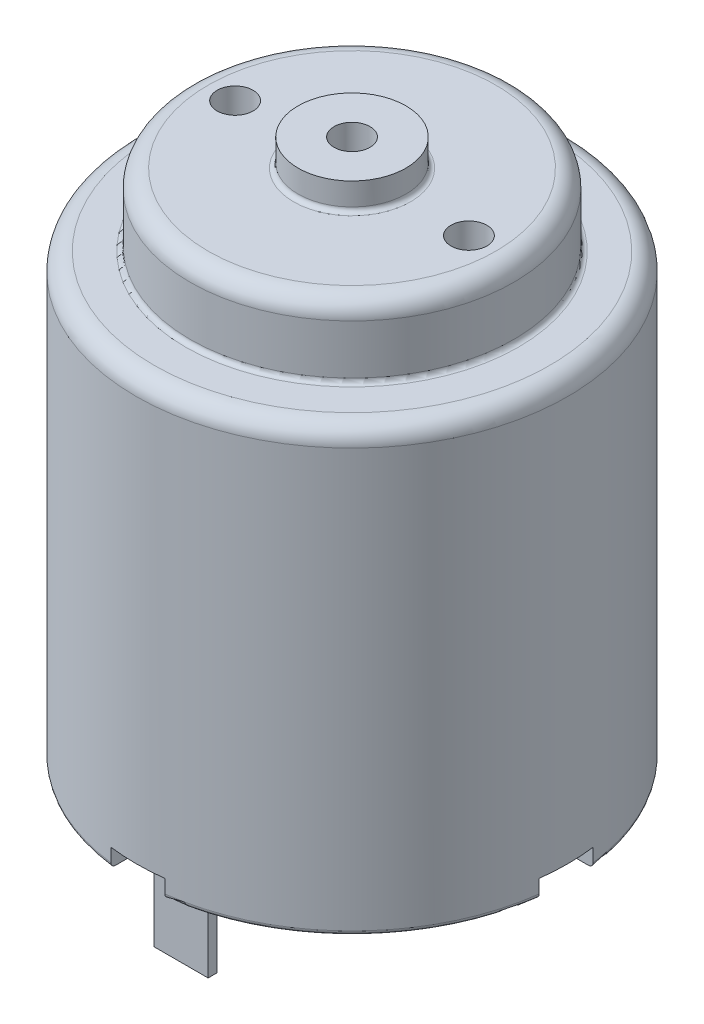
ISO-10303-21;
HEADER;
FILE_DESCRIPTION(('STEP AP214'),'2;1');
FILE_NAME('part.step','',(''),(''),'','','');
FILE_SCHEMA(('AUTOMOTIVE_DESIGN { 1 0 10303 214 1 1 1 1 }'));
ENDSEC;
DATA;
#1=APPLICATION_CONTEXT('core data for automotive mechanical design processes');
#2=APPLICATION_PROTOCOL_DEFINITION('international standard','automotive_design',2000,#1);
#3=PRODUCT_CONTEXT('',#1,'mechanical');
#4=PRODUCT('Part','Part','',(#3));
#5=PRODUCT_RELATED_PRODUCT_CATEGORY('part','',(#4));
#6=PRODUCT_DEFINITION_FORMATION('','',#4);
#7=PRODUCT_DEFINITION_CONTEXT('part definition',#1,'design');
#8=PRODUCT_DEFINITION('design','',#6,#7);
#9=PRODUCT_DEFINITION_SHAPE('','',#8);
#10=(LENGTH_UNIT() NAMED_UNIT(*) SI_UNIT(.MILLI.,.METRE.));
#11=(NAMED_UNIT(*) PLANE_ANGLE_UNIT() SI_UNIT($,.RADIAN.));
#12=(NAMED_UNIT(*) SI_UNIT($,.STERADIAN.) SOLID_ANGLE_UNIT());
#13=UNCERTAINTY_MEASURE_WITH_UNIT(LENGTH_MEASURE(1.E-05),#10,'distance_accuracy_value','');
#14=(GEOMETRIC_REPRESENTATION_CONTEXT(3) GLOBAL_UNCERTAINTY_ASSIGNED_CONTEXT((#13)) GLOBAL_UNIT_ASSIGNED_CONTEXT((#10,
#11,#12)) REPRESENTATION_CONTEXT('',''));
#15=CARTESIAN_POINT('',(0.,0.,0.));
#16=DIRECTION('',(0.,0.,1.));
#17=DIRECTION('',(1.,0.,0.));
#18=AXIS2_PLACEMENT_3D('',#15,#16,#17);
#19=CARTESIAN_POINT('',(-1.50100000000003,3.,-8.999));
#20=DIRECTION('',(-1.,0.,0.));
#21=DIRECTION('',(0.,0.,1.));
#22=AXIS2_PLACEMENT_3D('',#19,#20,#21);
#23=PLANE('',#22);
#24=DIRECTION('',(0.,1.,0.));
#25=VECTOR('',#24,1.);
#26=CARTESIAN_POINT('',(-1.50100000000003,-3.,-9.499));
#27=LINE('',#26,#25);
#28=CARTESIAN_POINT('',(-1.50100000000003,2.,-9.499));
#29=VERTEX_POINT('',#28);
#30=CARTESIAN_POINT('',(-1.50100000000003,3.,-9.499));
#31=VERTEX_POINT('',#30);
#32=EDGE_CURVE('E51',#29,#31,#27,.T.);
#33=ORIENTED_EDGE('',*,*,#32,.F.);
#34=DIRECTION('',(0.,0.,-1.));
#35=VECTOR('',#34,1.);
#36=CARTESIAN_POINT('',(-1.50100000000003,2.,-8.999));
#37=LINE('',#36,#35);
#38=CARTESIAN_POINT('',(-1.50100000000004,2.,-11.6537332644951));
#39=VERTEX_POINT('',#38);
#40=EDGE_CURVE('E414',#29,#39,#37,.T.);
#41=ORIENTED_EDGE('',*,*,#40,.T.);
#42=CARTESIAN_POINT('',(-1.50100000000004,2.10017884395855,-11.8554924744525));
#43=CARTESIAN_POINT('',(-1.50100000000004,2.1113418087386,-11.8639150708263));
#44=CARTESIAN_POINT('',(-1.50100000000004,2.12322044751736,-11.871405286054));
#45=CARTESIAN_POINT('',(-1.50100000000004,2.14807521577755,-11.8842934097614));
#46=CARTESIAN_POINT('',(-1.50100000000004,2.16105255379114,-11.889688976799));
#47=CARTESIAN_POINT('',(-1.50100000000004,2.18772801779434,-11.898219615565));
#48=CARTESIAN_POINT('',(-1.50100000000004,2.20142596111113,-11.9013552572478));
#49=CARTESIAN_POINT('',(-1.50100000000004,2.22915089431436,-11.9052731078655));
#50=CARTESIAN_POINT('',(-1.50100000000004,2.24317780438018,-11.9060558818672));
#51=CARTESIAN_POINT('',(-1.50100000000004,2.27112023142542,-11.9052477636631));
#52=CARTESIAN_POINT('',(-1.50100000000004,2.2850359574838,-11.9036640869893));
#53=CARTESIAN_POINT('',(-1.50100000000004,2.31240433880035,-11.8981832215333));
#54=CARTESIAN_POINT('',(-1.50100000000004,2.32585698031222,-11.8942859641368));
#55=CARTESIAN_POINT('',(-1.50100000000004,2.35192193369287,-11.8842919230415));
#56=CARTESIAN_POINT('',(-1.50100000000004,2.36453405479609,-11.8781946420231));
#57=CARTESIAN_POINT('',(-1.50100000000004,2.38856235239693,-11.8639791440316));
#58=CARTESIAN_POINT('',(-1.50100000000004,2.39997850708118,-11.8558608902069));
#59=CARTESIAN_POINT('',(-1.50100000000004,2.42135263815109,-11.8377934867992));
#60=CARTESIAN_POINT('',(-1.50100000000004,2.43130317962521,-11.8278355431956));
#61=CARTESIAN_POINT('',(-1.50100000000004,2.4494064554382,-11.806401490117));
#62=CARTESIAN_POINT('',(-1.50100000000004,2.45755912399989,-11.7949253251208));
#63=CARTESIAN_POINT('',(-1.50100000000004,2.4719010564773,-11.7706879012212));
#64=CARTESIAN_POINT('',(-1.50100000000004,2.47807500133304,-11.7579175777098));
#65=CARTESIAN_POINT('',(-1.50100000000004,2.48820859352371,-11.7315266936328));
#66=CARTESIAN_POINT('',(-1.50100000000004,2.4921681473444,-11.7179060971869));
#67=CARTESIAN_POINT('',(-1.50100000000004,2.49778748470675,-11.6900976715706));
#68=CARTESIAN_POINT('',(-1.50100000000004,2.49943075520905,-11.6759065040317));
#69=CARTESIAN_POINT('',(-1.50100000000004,2.50032083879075,-11.647449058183));
#70=CARTESIAN_POINT('',(-1.50100000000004,2.49956758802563,-11.6331827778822));
#71=CARTESIAN_POINT('',(-1.50100000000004,2.49567813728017,-11.6049266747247));
#72=CARTESIAN_POINT('',(-1.50100000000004,2.49253345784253,-11.5909380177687));
#73=CARTESIAN_POINT('',(-1.50100000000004,2.48393647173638,-11.5636884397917));
#74=CARTESIAN_POINT('',(-1.50100000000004,2.47848416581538,-11.550427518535));
#75=CARTESIAN_POINT('',(-1.50100000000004,2.46543216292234,-11.525036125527));
#76=CARTESIAN_POINT('',(-1.50100000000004,2.45783609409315,-11.5129037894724));
#77=CARTESIAN_POINT('',(-1.50100000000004,2.44070266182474,-11.4900971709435));
#78=CARTESIAN_POINT('',(-1.50100000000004,2.43116535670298,-11.4794228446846));
#79=CARTESIAN_POINT('',(-1.50100000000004,2.41048359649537,-11.4599099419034));
#80=CARTESIAN_POINT('',(-1.50100000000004,2.39934978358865,-11.4510600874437));
#81=CARTESIAN_POINT('',(-1.50100000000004,2.37574406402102,-11.4353737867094));
#82=CARTESIAN_POINT('',(-1.50100000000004,2.36327221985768,-11.4285372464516));
#83=CARTESIAN_POINT('',(-1.50100000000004,2.3374555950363,-11.4171310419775));
#84=CARTESIAN_POINT('',(-1.50100000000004,2.32411891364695,-11.4125430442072));
#85=CARTESIAN_POINT('',(-1.50100000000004,2.29686199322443,-11.4056874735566));
#86=CARTESIAN_POINT('',(-1.50100000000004,2.28294177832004,-11.4034198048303));
#87=CARTESIAN_POINT('',(-1.50100000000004,2.25500826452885,-11.4012802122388));
#88=CARTESIAN_POINT('',(-1.50100000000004,2.24099612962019,-11.4013930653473));
#89=CARTESIAN_POINT('',(-1.50100000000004,2.21319062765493,-11.4039736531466));
#90=CARTESIAN_POINT('',(-1.50100000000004,2.19939725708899,-11.4064413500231));
#91=CARTESIAN_POINT('',(-1.50100000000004,2.17244149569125,-11.4136523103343));
#92=CARTESIAN_POINT('',(-1.50100000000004,2.1592781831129,-11.4183921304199));
#93=CARTESIAN_POINT('',(-1.50100000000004,2.13392959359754,-11.4300057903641));
#94=CARTESIAN_POINT('',(-1.50100000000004,2.12174432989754,-11.4368796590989));
#95=CARTESIAN_POINT('',(-1.50100000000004,2.09864286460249,-11.4525927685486));
#96=CARTESIAN_POINT('',(-1.50100000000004,2.08773198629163,-11.4614398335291));
#97=CARTESIAN_POINT('',(-1.50100000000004,2.06753621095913,-11.4808274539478));
#98=CARTESIAN_POINT('',(-1.50100000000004,2.05825137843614,-11.4913680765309));
#99=CARTESIAN_POINT('',(-1.50100000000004,2.04149457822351,-11.5139297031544));
#100=CARTESIAN_POINT('',(-1.50100000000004,2.03403709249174,-11.525961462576));
#101=CARTESIAN_POINT('',(-1.50100000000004,2.02122958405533,-11.551098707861));
#102=CARTESIAN_POINT('',(-1.50100000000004,2.01587965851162,-11.564204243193));
#103=CARTESIAN_POINT('',(-1.50100000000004,2.00739698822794,-11.5912277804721));
#104=CARTESIAN_POINT('',(-1.50100000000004,2.00428201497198,-11.6051513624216));
#105=CARTESIAN_POINT('',(-1.50100000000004,2.00042215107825,-11.6333228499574));
#106=CARTESIAN_POINT('',(-1.50100000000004,1.99967724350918,-11.6475707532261));
#107=CARTESIAN_POINT('',(-1.50100000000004,2.00057965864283,-11.6760543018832));
#108=CARTESIAN_POINT('',(-1.50100000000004,2.00223763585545,-11.6902896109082));
#109=CARTESIAN_POINT('',(-1.50100000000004,2.00792201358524,-11.7182834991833));
#110=CARTESIAN_POINT('',(-1.50100000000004,2.01194900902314,-11.7320419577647));
#111=CARTESIAN_POINT('',(-1.50100000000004,2.02226049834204,-11.758681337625));
#112=CARTESIAN_POINT('',(-1.50100000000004,2.02854459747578,-11.7715624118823));
#113=CARTESIAN_POINT('',(-1.50100000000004,2.04319399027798,-11.7960669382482));
#114=CARTESIAN_POINT('',(-1.50100000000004,2.05155673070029,-11.8076919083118));
#115=CARTESIAN_POINT('',(-1.50100000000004,2.06670504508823,-11.8253654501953));
#116=CARTESIAN_POINT('',(-1.50100000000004,2.07294079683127,-11.8318933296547));
#117=CARTESIAN_POINT('',(-1.50100000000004,2.08607809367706,-11.8442408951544));
#118=CARTESIAN_POINT('',(-1.50100000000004,2.09297963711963,-11.8500605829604));
#119=CARTESIAN_POINT('',(-1.50100000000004,2.10017884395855,-11.8554924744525));
#120=B_SPLINE_CURVE_WITH_KNOTS('',3,(#42,#43,#44,#45,#46,#47,#48,#49,#50,#51,#52,#53,#54,#55,
#56,#57,#58,#59,#60,#61,#62,#63,#64,#65,#66,#67,#68,#69,#70,#71,#72,#73,#74,#75,#76,#77,#78,#79,
#80,#81,#82,#83,#84,#85,#86,#87,#88,#89,#90,#91,#92,#93,#94,#95,#96,#97,#98,#99,#100,#101,#102,
#103,#104,#105,#106,#107,#108,#109,#110,#111,#112,#113,#114,#115,#116,#117,#118,#119),
.UNSPECIFIED.,.T.,.F.,(4,2,2,2,2,2,2,2,2,2,2,2,2,2,2,2,2,2,2,2,2,2,2,2,2,2,2,2,2,2,2,2,2,2,2,2,
2,2,4),(0.,0.041919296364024,0.0838853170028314,0.125840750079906,0.167786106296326,
0.209603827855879,0.251422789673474,0.293251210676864,0.335080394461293,0.377114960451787,
0.419151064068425,0.461505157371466,0.503861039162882,0.546517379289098,0.5891748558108,
0.631984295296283,0.674793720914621,0.717531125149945,0.760267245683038,0.802730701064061,
0.845192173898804,0.887301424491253,0.929408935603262,0.971247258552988,1.01308490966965,
1.05485935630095,1.09663436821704,1.13857807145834,1.18052343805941,1.22279119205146,
1.26506089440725,1.30766309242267,1.3502649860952,1.39305635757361,1.43585847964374,
1.47865311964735,1.52139545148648,1.54843006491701,1.5754646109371),.UNSPECIFIED.);
#121=CARTESIAN_POINT('',(-1.50100000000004,2.25,-11.9057548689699));
#122=VERTEX_POINT('',#121);
#123=EDGE_CURVE('E743',#39,#122,#120,.T.);
#124=ORIENTED_EDGE('',*,*,#123,.T.);
#125=DIRECTION('',(0.,-1.,0.));
#126=VECTOR('',#125,1.);
#127=CARTESIAN_POINT('',(-1.50100000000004,-7.25770293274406,-11.9057548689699));
#128=LINE('',#127,#126);
#129=CARTESIAN_POINT('',(-1.50100000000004,3.,-11.9057548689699));
#130=VERTEX_POINT('',#129);
#131=EDGE_CURVE('E424',#122,#130,#128,.F.);
#132=ORIENTED_EDGE('',*,*,#131,.T.);
#133=DIRECTION('',(0.,0.,-1.));
#134=VECTOR('',#133,1.);
#135=CARTESIAN_POINT('',(-1.50100000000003,3.,-8.999));
#136=LINE('',#135,#134);
#137=EDGE_CURVE('E304',#31,#130,#136,.T.);
#138=ORIENTED_EDGE('',*,*,#137,.F.);
#139=EDGE_LOOP('',(#33,#41,#124,#132,#138));
#140=FACE_BOUND('',#139,.T.);
#141=ADVANCED_FACE('F31',(#140),#23,.F.);
#142=CARTESIAN_POINT('',(1.49899999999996,3.,-11.999));
#143=DIRECTION('',(1.,0.,0.));
#144=DIRECTION('',(0.,0.,-1.));
#145=AXIS2_PLACEMENT_3D('',#142,#143,#144);
#146=PLANE('',#145);
#147=DIRECTION('',(0.,1.,0.));
#148=VECTOR('',#147,1.);
#149=CARTESIAN_POINT('',(1.49899999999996,-3.,-9.499));
#150=LINE('',#149,#148);
#151=CARTESIAN_POINT('',(1.49899999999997,2.,-9.499));
#152=VERTEX_POINT('',#151);
#153=CARTESIAN_POINT('',(1.49899999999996,3.,-9.499));
#154=VERTEX_POINT('',#153);
#155=EDGE_CURVE('E307',#152,#154,#150,.T.);
#156=ORIENTED_EDGE('',*,*,#155,.T.);
#157=DIRECTION('',(0.,0.,1.));
#158=VECTOR('',#157,1.);
#159=CARTESIAN_POINT('',(1.49899999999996,3.,-11.999));
#160=LINE('',#159,#158);
#161=CARTESIAN_POINT('',(1.49899999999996,3.,-11.9060068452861));
#162=VERTEX_POINT('',#161);
#163=EDGE_CURVE('E293',#162,#154,#160,.T.);
#164=ORIENTED_EDGE('',*,*,#163,.F.);
#165=DIRECTION('',(0.,-1.,0.));
#166=VECTOR('',#165,1.);
#167=CARTESIAN_POINT('',(1.49899999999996,-7.25770293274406,-11.9060068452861));
#168=LINE('',#167,#166);
#169=CARTESIAN_POINT('',(1.49899999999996,2.25,-11.9060068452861));
#170=VERTEX_POINT('',#169);
#171=EDGE_CURVE('E422',#162,#170,#168,.T.);
#172=ORIENTED_EDGE('',*,*,#171,.T.);
#173=CARTESIAN_POINT('',(1.49899999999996,2.10008044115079,-11.8556712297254));
#174=CARTESIAN_POINT('',(1.49899999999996,2.08880217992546,-11.8471515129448));
#175=CARTESIAN_POINT('',(1.49899999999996,2.07823912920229,-11.8376670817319));
#176=CARTESIAN_POINT('',(1.49899999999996,2.0588502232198,-11.8170480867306));
#177=CARTESIAN_POINT('',(1.49899999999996,2.05002663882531,-11.8059113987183));
#178=CARTESIAN_POINT('',(1.49899999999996,2.03437697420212,-11.782325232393));
#179=CARTESIAN_POINT('',(1.49899999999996,2.0275492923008,-11.7698768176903));
#180=CARTESIAN_POINT('',(1.49899999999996,2.0160698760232,-11.7440187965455));
#181=CARTESIAN_POINT('',(1.49899999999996,2.01141760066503,-11.7306094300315));
#182=CARTESIAN_POINT('',(1.49899999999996,2.00439089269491,-11.7031281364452));
#183=CARTESIAN_POINT('',(1.49899999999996,2.00202908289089,-11.6890529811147));
#184=CARTESIAN_POINT('',(1.49899999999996,1.99969081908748,-11.6607051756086));
#185=CARTESIAN_POINT('',(1.49899999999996,1.99971453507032,-11.6464325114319));
#186=CARTESIAN_POINT('',(1.49899999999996,2.00215182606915,-11.6180315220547));
#187=CARTESIAN_POINT('',(1.49899999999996,2.00457551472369,-11.6039040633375));
#188=CARTESIAN_POINT('',(1.49899999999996,2.01176210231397,-11.5762569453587));
#189=CARTESIAN_POINT('',(1.49899999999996,2.01652500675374,-11.5627372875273));
#190=CARTESIAN_POINT('',(1.49899999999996,2.0282550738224,-11.5367041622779));
#191=CARTESIAN_POINT('',(1.49899999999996,2.03522034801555,-11.5241898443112));
#192=CARTESIAN_POINT('',(1.49899999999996,2.05116457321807,-11.5005171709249));
#193=CARTESIAN_POINT('',(1.49899999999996,2.06014346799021,-11.48935877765));
#194=CARTESIAN_POINT('',(1.49899999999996,2.07980663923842,-11.4687857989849));
#195=CARTESIAN_POINT('',(1.49899999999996,2.0904807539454,-11.4593615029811));
#196=CARTESIAN_POINT('',(1.49899999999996,2.11327091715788,-11.4424565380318));
#197=CARTESIAN_POINT('',(1.49899999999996,2.12538690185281,-11.4349757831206));
#198=CARTESIAN_POINT('',(1.49899999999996,2.15061001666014,-11.4222353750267));
#199=CARTESIAN_POINT('',(1.49899999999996,2.16370817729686,-11.4169579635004));
#200=CARTESIAN_POINT('',(1.49899999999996,2.19060831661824,-11.4086943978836));
#201=CARTESIAN_POINT('',(1.49899999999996,2.20441026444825,-11.4057081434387));
#202=CARTESIAN_POINT('',(1.49899999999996,2.23222402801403,-11.4021295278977));
#203=CARTESIAN_POINT('',(1.49899999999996,2.24623373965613,-11.4015207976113));
#204=CARTESIAN_POINT('',(1.49899999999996,2.27415553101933,-11.4026702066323));
#205=CARTESIAN_POINT('',(1.49899999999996,2.28806761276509,-11.4044282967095));
#206=CARTESIAN_POINT('',(1.49899999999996,2.31536552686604,-11.4102516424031));
#207=CARTESIAN_POINT('',(1.49899999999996,2.32875252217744,-11.4143114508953));
#208=CARTESIAN_POINT('',(1.49899999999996,2.35465815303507,-11.4246138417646));
#209=CARTESIAN_POINT('',(1.49899999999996,2.36717677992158,-11.4308564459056));
#210=CARTESIAN_POINT('',(1.49899999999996,2.39103613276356,-11.4453653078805));
#211=CARTESIAN_POINT('',(1.49899999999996,2.40237289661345,-11.4536380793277));
#212=CARTESIAN_POINT('',(1.49899999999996,2.42350942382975,-11.4719567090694));
#213=CARTESIAN_POINT('',(1.49899999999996,2.43330913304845,-11.4820026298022));
#214=CARTESIAN_POINT('',(1.49899999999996,2.45117084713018,-11.5036601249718));
#215=CARTESIAN_POINT('',(1.49899999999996,2.45921961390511,-11.5152826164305));
#216=CARTESIAN_POINT('',(1.49899999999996,2.47326996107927,-11.5397052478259));
#217=CARTESIAN_POINT('',(1.49899999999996,2.4792714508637,-11.5525054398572));
#218=CARTESIAN_POINT('',(1.49899999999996,2.48910618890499,-11.5790307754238));
#219=CARTESIAN_POINT('',(1.49899999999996,2.49292160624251,-11.5927625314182));
#220=CARTESIAN_POINT('',(1.49899999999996,2.4982063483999,-11.6206704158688));
#221=CARTESIAN_POINT('',(1.49899999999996,2.49967559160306,-11.6348465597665));
#222=CARTESIAN_POINT('',(1.49899999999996,2.50022963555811,-11.663319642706));
#223=CARTESIAN_POINT('',(1.49899999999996,2.49930196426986,-11.6776168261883));
#224=CARTESIAN_POINT('',(1.49899999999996,2.4950602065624,-11.7058529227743));
#225=CARTESIAN_POINT('',(1.49899999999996,2.49174610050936,-11.7197918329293));
#226=CARTESIAN_POINT('',(1.49899999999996,2.4828200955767,-11.7469164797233));
#227=CARTESIAN_POINT('',(1.49899999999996,2.47720780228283,-11.7601020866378));
#228=CARTESIAN_POINT('',(1.49899999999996,2.46383883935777,-11.7853376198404));
#229=CARTESIAN_POINT('',(1.49899999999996,2.45608220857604,-11.7973875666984));
#230=CARTESIAN_POINT('',(1.49899999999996,2.43868220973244,-11.8199455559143));
#231=CARTESIAN_POINT('',(1.49899999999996,2.42904811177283,-11.8304607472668));
#232=CARTESIAN_POINT('',(1.49899999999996,2.4081392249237,-11.8497092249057));
#233=CARTESIAN_POINT('',(1.49899999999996,2.39686449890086,-11.858442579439));
#234=CARTESIAN_POINT('',(1.49899999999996,2.37308582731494,-11.8738086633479));
#235=CARTESIAN_POINT('',(1.49899999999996,2.36059184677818,-11.8804568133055));
#236=CARTESIAN_POINT('',(1.49899999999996,2.33465984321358,-11.8915436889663));
#237=CARTESIAN_POINT('',(1.49899999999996,2.32122189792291,-11.8959825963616));
#238=CARTESIAN_POINT('',(1.49899999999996,2.29388671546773,-11.9024946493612));
#239=CARTESIAN_POINT('',(1.49899999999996,2.27999346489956,-11.9045845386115));
#240=CARTESIAN_POINT('',(1.49899999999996,2.25204974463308,-11.9063932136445));
#241=CARTESIAN_POINT('',(1.49899999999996,2.23799924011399,-11.9061114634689));
#242=CARTESIAN_POINT('',(1.49899999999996,2.21019120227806,-11.9031895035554));
#243=CARTESIAN_POINT('',(1.49899999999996,2.19643289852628,-11.9005565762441));
#244=CARTESIAN_POINT('',(1.49899999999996,2.16956503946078,-11.8930214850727));
#245=CARTESIAN_POINT('',(1.49899999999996,2.15645471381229,-11.8881220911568));
#246=CARTESIAN_POINT('',(1.49899999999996,2.13612852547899,-11.8785157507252));
#247=CARTESIAN_POINT('',(1.49899999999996,2.12859414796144,-11.8744673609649));
#248=CARTESIAN_POINT('',(1.49899999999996,2.11397951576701,-11.865620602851));
#249=CARTESIAN_POINT('',(1.49899999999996,2.10689925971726,-11.8608222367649));
#250=CARTESIAN_POINT('',(1.49899999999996,2.10008044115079,-11.8556712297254));
#251=B_SPLINE_CURVE_WITH_KNOTS('',3,(#173,#174,#175,#176,#177,#178,#179,#180,#181,#182,#183,
#184,#185,#186,#187,#188,#189,#190,#191,#192,#193,#194,#195,#196,#197,#198,#199,#200,#201,#202,
#203,#204,#205,#206,#207,#208,#209,#210,#211,#212,#213,#214,#215,#216,#217,#218,#219,#220,#221,
#222,#223,#224,#225,#226,#227,#228,#229,#230,#231,#232,#233,#234,#235,#236,#237,#238,#239,#240,
#241,#242,#243,#244,#245,#246,#247,#248,#249,#250),.UNSPECIFIED.,.T.,.F.,(4,2,2,2,2,2,2,2,2,2,2,
2,2,2,2,2,2,2,2,2,2,2,2,2,2,2,2,2,2,2,2,2,2,2,2,2,2,2,4),(0.,0.0423720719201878,
0.0847990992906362,0.127191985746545,0.169574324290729,0.212188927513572,0.254806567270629,
0.297604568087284,0.340402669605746,0.383164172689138,0.425924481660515,0.468437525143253,
0.510948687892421,0.553110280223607,0.595270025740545,0.63713898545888,0.67900707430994,
0.720776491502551,0.762546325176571,0.804451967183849,0.846359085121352,0.888572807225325,
0.930788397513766,0.973343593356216,1.01590026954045,1.05867882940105,1.10145774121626,
1.14424399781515,1.18702947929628,1.22960882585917,1.27218654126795,1.31444152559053,
1.35669303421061,1.39864142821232,1.44059930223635,1.48242766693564,1.52420504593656,
1.54982320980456,1.57544129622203),.UNSPECIFIED.);
#252=CARTESIAN_POINT('',(1.49899999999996,2.,-11.6539906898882));
#253=VERTEX_POINT('',#252);
#254=EDGE_CURVE('E749',#170,#253,#251,.T.);
#255=ORIENTED_EDGE('',*,*,#254,.T.);
#256=DIRECTION('',(0.,0.,1.));
#257=VECTOR('',#256,1.);
#258=CARTESIAN_POINT('',(1.49899999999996,2.,-11.999));
#259=LINE('',#258,#257);
#260=EDGE_CURVE('E309',#253,#152,#259,.T.);
#261=ORIENTED_EDGE('',*,*,#260,.T.);
#262=EDGE_LOOP('',(#156,#164,#172,#255,#261));
#263=FACE_BOUND('',#262,.T.);
#264=ADVANCED_FACE('F308',(#263),#146,.F.);
#265=CARTESIAN_POINT('',(-1.50100000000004,3.,-11.999));
#266=DIRECTION('',(0.,1.,0.));
#267=DIRECTION('',(-1.,0.,0.));
#268=AXIS2_PLACEMENT_3D('',#265,#266,#267);
#269=PLANE('',#268);
#270=DIRECTION('',(1.,0.,0.));
#271=VECTOR('',#270,1.);
#272=CARTESIAN_POINT('',(-1.50100000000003,3.,-9.499));
#273=LINE('',#272,#271);
#274=EDGE_CURVE('E297',#31,#154,#273,.T.);
#275=ORIENTED_EDGE('',*,*,#274,.F.);
#276=ORIENTED_EDGE('',*,*,#137,.T.);
#277=CARTESIAN_POINT('',(0.,3.,0.));
#278=DIRECTION('',(0.,1.,0.));
#279=DIRECTION('',(0.,0.,1.));
#280=AXIS2_PLACEMENT_3D('',#277,#278,#279);
#281=CIRCLE('',#280,12.);
#282=CARTESIAN_POINT('',(-0.154916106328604,3.,-11.999));
#283=VERTEX_POINT('',#282);
#284=EDGE_CURVE('E755',#130,#283,#281,.F.);
#285=ORIENTED_EDGE('',*,*,#284,.T.);
#286=DIRECTION('',(1.,0.,0.));
#287=VECTOR('',#286,1.);
#288=CARTESIAN_POINT('',(-1.50100000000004,3.,-11.999));
#289=LINE('',#288,#287);
#290=CARTESIAN_POINT('',(0.154916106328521,3.,-11.999));
#291=VERTEX_POINT('',#290);
#292=EDGE_CURVE('E303',#283,#291,#289,.T.);
#293=ORIENTED_EDGE('',*,*,#292,.T.);
#294=EDGE_CURVE('E300',#291,#162,#281,.F.);
#295=ORIENTED_EDGE('',*,*,#294,.T.);
#296=ORIENTED_EDGE('',*,*,#163,.T.);
#297=EDGE_LOOP('',(#275,#276,#285,#293,#295,#296));
#298=FACE_BOUND('',#297,.T.);
#299=ADVANCED_FACE('F295',(#298),#269,.F.);
#300=CARTESIAN_POINT('',(-1.50100000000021,3.,9.00099999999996));
#301=DIRECTION('',(1.,0.,0.));
#302=DIRECTION('',(0.,0.,-1.));
#303=AXIS2_PLACEMENT_3D('',#300,#301,#302);
#304=PLANE('',#303);
#305=DIRECTION('',(0.,0.,1.));
#306=VECTOR('',#305,1.);
#307=CARTESIAN_POINT('',(-1.50100000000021,2.,9.00099999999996));
#308=LINE('',#307,#306);
#309=CARTESIAN_POINT('',(-1.50100000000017,2.,9.50099999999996));
#310=VERTEX_POINT('',#309);
#311=CARTESIAN_POINT('',(-1.50099999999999,2.,11.6537332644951));
#312=VERTEX_POINT('',#311);
#313=EDGE_CURVE('E441',#310,#312,#308,.T.);
#314=ORIENTED_EDGE('',*,*,#313,.F.);
#315=DIRECTION('',(0.,1.,0.));
#316=VECTOR('',#315,1.);
#317=CARTESIAN_POINT('',(-1.50100000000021,-3.,9.50099999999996));
#318=LINE('',#317,#316);
#319=CARTESIAN_POINT('',(-1.50100000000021,3.,9.50099999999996));
#320=VERTEX_POINT('',#319);
#321=EDGE_CURVE('E349',#310,#320,#318,.T.);
#322=ORIENTED_EDGE('',*,*,#321,.T.);
#323=DIRECTION('',(0.,0.,1.));
#324=VECTOR('',#323,1.);
#325=CARTESIAN_POINT('',(-1.50100000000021,3.,9.00099999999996));
#326=LINE('',#325,#324);
#327=CARTESIAN_POINT('',(-1.50099999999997,3.,11.9057548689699));
#328=VERTEX_POINT('',#327);
#329=EDGE_CURVE('E434',#320,#328,#326,.T.);
#330=ORIENTED_EDGE('',*,*,#329,.T.);
#331=DIRECTION('',(0.,-1.,0.));
#332=VECTOR('',#331,1.);
#333=CARTESIAN_POINT('',(-1.50099999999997,-7.25770293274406,11.9057548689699));
#334=LINE('',#333,#332);
#335=CARTESIAN_POINT('',(-1.50099999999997,2.25000000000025,11.905754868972));
#336=VERTEX_POINT('',#335);
#337=EDGE_CURVE('E448',#336,#328,#334,.F.);
#338=ORIENTED_EDGE('',*,*,#337,.F.);
#339=CARTESIAN_POINT('',(-1.50100000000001,2.12043319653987,11.4381292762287));
#340=CARTESIAN_POINT('',(-1.501,2.10839424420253,11.4454882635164));
#341=CARTESIAN_POINT('',(-1.501,2.09697153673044,11.4538760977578));
#342=CARTESIAN_POINT('',(-1.501,2.07569073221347,11.4724615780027));
#343=CARTESIAN_POINT('',(-1.501,2.06583468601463,11.4826615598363));
#344=CARTESIAN_POINT('',(-1.501,2.0479785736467,11.50456081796));
#345=CARTESIAN_POINT('',(-1.501,2.03997697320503,11.5162588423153));
#346=CARTESIAN_POINT('',(-1.501,2.02604016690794,11.5408222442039));
#347=CARTESIAN_POINT('',(-1.501,2.02010445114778,11.5536873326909));
#348=CARTESIAN_POINT('',(-1.50099999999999,2.0104262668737,11.5803049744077));
#349=CARTESIAN_POINT('',(-1.50099999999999,2.00669713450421,11.5940623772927));
#350=CARTESIAN_POINT('',(-1.50099999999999,2.0015880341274,11.6220073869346));
#351=CARTESIAN_POINT('',(-1.50099999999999,2.00020824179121,11.6361950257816));
#352=CARTESIAN_POINT('',(-1.50099999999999,1.99983455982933,11.664674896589));
#353=CARTESIAN_POINT('',(-1.50099999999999,2.00085295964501,11.6789672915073));
#354=CARTESIAN_POINT('',(-1.50099999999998,2.00527433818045,11.7071785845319));
#355=CARTESIAN_POINT('',(-1.50099999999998,2.0086773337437,11.7210974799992));
#356=CARTESIAN_POINT('',(-1.50099999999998,2.01777639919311,11.7481659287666));
#357=CARTESIAN_POINT('',(-1.50099999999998,2.02347263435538,11.7613154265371));
#358=CARTESIAN_POINT('',(-1.50099999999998,2.03700236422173,11.7864649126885));
#359=CARTESIAN_POINT('',(-1.50099999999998,2.04483581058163,11.7984649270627));
#360=CARTESIAN_POINT('',(-1.50099999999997,2.06237896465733,11.8209098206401));
#361=CARTESIAN_POINT('',(-1.50099999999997,2.07207927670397,11.8313620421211));
#362=CARTESIAN_POINT('',(-1.50099999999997,2.09310903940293,11.8504741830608));
#363=CARTESIAN_POINT('',(-1.50099999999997,2.10443842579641,11.8591341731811));
#364=CARTESIAN_POINT('',(-1.50099999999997,2.1283121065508,11.8743453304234));
#365=CARTESIAN_POINT('',(-1.50099999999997,2.14084645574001,11.8809121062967));
#366=CARTESIAN_POINT('',(-1.50099999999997,2.16684530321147,11.8918309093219));
#367=CARTESIAN_POINT('',(-1.50099999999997,2.18030976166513,11.8961830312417));
#368=CARTESIAN_POINT('',(-1.50099999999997,2.2076845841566,11.9025193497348));
#369=CARTESIAN_POINT('',(-1.50099999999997,2.22159113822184,11.904520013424));
#370=CARTESIAN_POINT('',(-1.50099999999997,2.2495423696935,11.9061491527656));
#371=CARTESIAN_POINT('',(-1.50099999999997,2.26358704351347,11.9057776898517));
#372=CARTESIAN_POINT('',(-1.50099999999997,2.2913641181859,11.902679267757));
#373=CARTESIAN_POINT('',(-1.50099999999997,2.30509743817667,11.8999605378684));
#374=CARTESIAN_POINT('',(-1.50099999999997,2.3319136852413,11.8922592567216));
#375=CARTESIAN_POINT('',(-1.50099999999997,2.34499661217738,11.8872767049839));
#376=CARTESIAN_POINT('',(-1.50099999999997,2.37016324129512,11.8751853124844));
#377=CARTESIAN_POINT('',(-1.50099999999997,2.38224544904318,11.8680733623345));
#378=CARTESIAN_POINT('',(-1.50099999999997,2.40505336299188,11.8519330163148));
#379=CARTESIAN_POINT('',(-1.50099999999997,2.41577903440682,11.8429045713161));
#380=CARTESIAN_POINT('',(-1.50099999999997,2.4356374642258,11.8231331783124));
#381=CARTESIAN_POINT('',(-1.50099999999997,2.44476062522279,11.8123805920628));
#382=CARTESIAN_POINT('',(-1.50099999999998,2.46108883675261,11.7895064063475));
#383=CARTESIAN_POINT('',(-1.50099999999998,2.46829380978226,11.7773847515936));
#384=CARTESIAN_POINT('',(-1.50099999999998,2.48064004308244,11.7520158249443));
#385=CARTESIAN_POINT('',(-1.50099999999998,2.485764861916,11.7387605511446));
#386=CARTESIAN_POINT('',(-1.50099999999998,2.49373262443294,11.711581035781));
#387=CARTESIAN_POINT('',(-1.50099999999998,2.49657547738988,11.6976567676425));
#388=CARTESIAN_POINT('',(-1.50099999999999,2.49991458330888,11.6694378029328));
#389=CARTESIAN_POINT('',(-1.50099999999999,2.50039549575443,11.655141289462));
#390=CARTESIAN_POINT('',(-1.50099999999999,2.4989566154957,11.626669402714));
#391=CARTESIAN_POINT('',(-1.50099999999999,2.49703677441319,11.6124940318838));
#392=CARTESIAN_POINT('',(-1.50099999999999,2.49084092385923,11.5846322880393));
#393=CARTESIAN_POINT('',(-1.50099999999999,2.48655934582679,11.57094715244));
#394=CARTESIAN_POINT('',(-1.501,2.47575279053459,11.544492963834));
#395=CARTESIAN_POINT('',(-1.501,2.46922782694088,11.5317239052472));
#396=CARTESIAN_POINT('',(-1.501,2.45413665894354,11.5075074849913));
#397=CARTESIAN_POINT('',(-1.501,2.4455765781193,11.4960563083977));
#398=CARTESIAN_POINT('',(-1.501,2.42664264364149,11.4747666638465));
#399=CARTESIAN_POINT('',(-1.501,2.41626885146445,11.4649281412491));
#400=CARTESIAN_POINT('',(-1.501,2.39408034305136,11.4472196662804));
#401=CARTESIAN_POINT('',(-1.50100000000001,2.3822764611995,11.439336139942));
#402=CARTESIAN_POINT('',(-1.50100000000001,2.35750451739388,11.4256821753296));
#403=CARTESIAN_POINT('',(-1.50100000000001,2.34453655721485,11.419911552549));
#404=CARTESIAN_POINT('',(-1.50100000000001,2.31791984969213,11.4106955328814));
#405=CARTESIAN_POINT('',(-1.50100000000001,2.30427763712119,11.4072312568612));
#406=CARTESIAN_POINT('',(-1.50100000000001,2.27660040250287,11.4026554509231));
#407=CARTESIAN_POINT('',(-1.50100000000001,2.26256529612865,11.4015444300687));
#408=CARTESIAN_POINT('',(-1.50100000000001,2.23457994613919,11.4017090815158));
#409=CARTESIAN_POINT('',(-1.50100000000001,2.22062962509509,11.4029730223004));
#410=CARTESIAN_POINT('',(-1.50100000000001,2.19315187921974,11.4078265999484));
#411=CARTESIAN_POINT('',(-1.50100000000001,2.17962395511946,11.4114133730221));
#412=CARTESIAN_POINT('',(-1.50100000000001,2.15847048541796,11.4189723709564));
#413=CARTESIAN_POINT('',(-1.50100000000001,2.15059147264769,11.4222549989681));
#414=CARTESIAN_POINT('',(-1.50100000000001,2.13521100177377,11.4296095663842));
#415=CARTESIAN_POINT('',(-1.50100000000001,2.12770954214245,11.4336815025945));
#416=CARTESIAN_POINT('',(-1.50100000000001,2.12043319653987,11.4381292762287));
#417=B_SPLINE_CURVE_WITH_KNOTS('',3,(#339,#340,#341,#342,#343,#344,#345,#346,#347,#348,#349,
#350,#351,#352,#353,#354,#355,#356,#357,#358,#359,#360,#361,#362,#363,#364,#365,#366,#367,#368,
#369,#370,#371,#372,#373,#374,#375,#376,#377,#378,#379,#380,#381,#382,#383,#384,#385,#386,#387,
#388,#389,#390,#391,#392,#393,#394,#395,#396,#397,#398,#399,#400,#401,#402,#403,#404,#405,#406,
#407,#408,#409,#410,#411,#412,#413,#414,#415,#416),.UNSPECIFIED.,.T.,.F.,(4,2,2,2,2,2,2,2,2,2,2,
2,2,2,2,2,2,2,2,2,2,2,2,2,2,2,2,2,2,2,2,2,2,2,2,2,2,2,4),(0.,0.04229843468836,
0.0846517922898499,0.126969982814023,0.169277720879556,0.21183861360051,0.254402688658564,
0.297185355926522,0.339968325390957,0.382754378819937,0.425539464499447,0.468114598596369,
0.510688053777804,0.552936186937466,0.595182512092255,0.6371311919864,0.679078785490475,
0.720879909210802,0.762681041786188,0.804543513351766,0.846407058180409,0.888513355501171,
0.930621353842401,0.973055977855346,1.01549228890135,1.05820385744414,1.10091628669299,
1.14372985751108,1.18654316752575,1.22922924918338,1.27191388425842,1.31429328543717,
1.35666898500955,1.39869339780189,1.44072690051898,1.48255331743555,1.5243282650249,
1.54989355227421,1.57545873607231),.UNSPECIFIED.);
#418=EDGE_CURVE('E1006',#312,#336,#417,.T.);
#419=ORIENTED_EDGE('',*,*,#418,.F.);
#420=EDGE_LOOP('',(#314,#322,#330,#338,#419));
#421=FACE_BOUND('',#420,.T.);
#422=ADVANCED_FACE('F1020',(#421),#304,.T.);
#423=CARTESIAN_POINT('',(1.49900000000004,3.,12.001));
#424=DIRECTION('',(-1.,0.,0.));
#425=DIRECTION('',(0.,0.,1.));
#426=AXIS2_PLACEMENT_3D('',#423,#424,#425);
#427=PLANE('',#426);
#428=DIRECTION('',(0.,0.,-1.));
#429=VECTOR('',#428,1.);
#430=CARTESIAN_POINT('',(1.49900000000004,3.,12.001));
#431=LINE('',#430,#429);
#432=CARTESIAN_POINT('',(1.49900000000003,3.,11.9060068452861));
#433=VERTEX_POINT('',#432);
#434=CARTESIAN_POINT('',(1.49899999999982,3.,9.50099999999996));
#435=VERTEX_POINT('',#434);
#436=EDGE_CURVE('E431',#433,#435,#431,.T.);
#437=ORIENTED_EDGE('',*,*,#436,.T.);
#438=DIRECTION('',(0.,1.,0.));
#439=VECTOR('',#438,1.);
#440=CARTESIAN_POINT('',(1.49900000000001,-3.,9.50099999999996));
#441=LINE('',#440,#439);
#442=CARTESIAN_POINT('',(1.49899999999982,2.,9.50099999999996));
#443=VERTEX_POINT('',#442);
#444=EDGE_CURVE('E353',#443,#435,#441,.T.);
#445=ORIENTED_EDGE('',*,*,#444,.F.);
#446=DIRECTION('',(0.,0.,-1.));
#447=VECTOR('',#446,1.);
#448=CARTESIAN_POINT('',(1.49900000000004,2.,12.001));
#449=LINE('',#448,#447);
#450=CARTESIAN_POINT('',(1.49900000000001,2.,11.6539906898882));
#451=VERTEX_POINT('',#450);
#452=EDGE_CURVE('E438',#451,#443,#449,.T.);
#453=ORIENTED_EDGE('',*,*,#452,.F.);
#454=CARTESIAN_POINT('',(1.49899999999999,2.12051350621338,11.4383424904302));
#455=CARTESIAN_POINT('',(1.49899999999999,2.13242744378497,11.4310677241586));
#456=CARTESIAN_POINT('',(1.49899999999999,2.14496132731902,11.4247896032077));
#457=CARTESIAN_POINT('',(1.49899999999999,2.17091469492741,11.4144200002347));
#458=CARTESIAN_POINT('',(1.49899999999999,2.18433514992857,11.4103309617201));
#459=CARTESIAN_POINT('',(1.49899999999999,2.21167021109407,11.4044690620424));
#460=CARTESIAN_POINT('',(1.49899999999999,2.22558467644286,11.4026955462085));
#461=CARTESIAN_POINT('',(1.49899999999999,2.25351001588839,11.4015169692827));
#462=CARTESIAN_POINT('',(1.49899999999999,2.26752086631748,11.4021113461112));
#463=CARTESIAN_POINT('',(1.49899999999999,2.29520972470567,11.4056449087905));
#464=CARTESIAN_POINT('',(1.49899999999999,2.30888844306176,11.4085785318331));
#465=CARTESIAN_POINT('',(1.49899999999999,2.33556105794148,11.4166964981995));
#466=CARTESIAN_POINT('',(1.49899999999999,2.34855492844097,11.4218809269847));
#467=CARTESIAN_POINT('',(1.49899999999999,2.37351720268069,11.4343595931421));
#468=CARTESIAN_POINT('',(1.49899999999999,2.38548361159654,11.4416578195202));
#469=CARTESIAN_POINT('',(1.49899999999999,2.40803171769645,11.4581472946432));
#470=CARTESIAN_POINT('',(1.49899999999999,2.41861337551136,11.46733859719));
#471=CARTESIAN_POINT('',(1.499,2.43816747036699,11.487416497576));
#472=CARTESIAN_POINT('',(1.499,2.4471288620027,11.4983138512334));
#473=CARTESIAN_POINT('',(1.499,2.46311271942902,11.5214480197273));
#474=CARTESIAN_POINT('',(1.499,2.47013510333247,11.533684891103));
#475=CARTESIAN_POINT('',(1.499,2.48210181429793,11.5592586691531));
#476=CARTESIAN_POINT('',(1.499,2.48702859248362,11.572603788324));
#477=CARTESIAN_POINT('',(1.49900000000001,2.49458739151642,11.5999288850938));
#478=CARTESIAN_POINT('',(1.49900000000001,2.49721932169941,11.6139088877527));
#479=CARTESIAN_POINT('',(1.49900000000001,2.50012673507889,11.6421996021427));
#480=CARTESIAN_POINT('',(1.49900000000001,2.50038752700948,11.6565118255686));
#481=CARTESIAN_POINT('',(1.49900000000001,2.49850669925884,11.6849777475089));
#482=CARTESIAN_POINT('',(1.49900000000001,2.49636504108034,11.6991314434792));
#483=CARTESIAN_POINT('',(1.49900000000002,2.48973155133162,11.7268998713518));
#484=CARTESIAN_POINT('',(1.49900000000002,2.48523618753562,11.7405137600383));
#485=CARTESIAN_POINT('',(1.49900000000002,2.47401537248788,11.7667895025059));
#486=CARTESIAN_POINT('',(1.49900000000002,2.46728995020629,11.779451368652));
#487=CARTESIAN_POINT('',(1.49900000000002,2.45182346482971,11.803411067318));
#488=CARTESIAN_POINT('',(1.49900000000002,2.44308999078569,11.8147137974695));
#489=CARTESIAN_POINT('',(1.49900000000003,2.42383682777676,11.8356792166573));
#490=CARTESIAN_POINT('',(1.49900000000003,2.41331720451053,11.8453419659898));
#491=CARTESIAN_POINT('',(1.49900000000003,2.39087087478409,11.86267805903));
#492=CARTESIAN_POINT('',(1.49900000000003,2.37895484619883,11.870365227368));
#493=CARTESIAN_POINT('',(1.49900000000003,2.35399372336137,11.8836122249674));
#494=CARTESIAN_POINT('',(1.49900000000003,2.34094867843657,11.889172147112));
#495=CARTESIAN_POINT('',(1.49900000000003,2.31420530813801,11.897964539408));
#496=CARTESIAN_POINT('',(1.49900000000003,2.30051262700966,11.901214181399));
#497=CARTESIAN_POINT('',(1.49900000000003,2.27277538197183,11.9053565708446));
#498=CARTESIAN_POINT('',(1.49900000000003,2.25873082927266,11.9062493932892));
#499=CARTESIAN_POINT('',(1.49900000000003,2.23075790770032,11.9056529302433));
#500=CARTESIAN_POINT('',(1.49900000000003,2.21682930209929,11.9041746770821));
#501=CARTESIAN_POINT('',(1.49900000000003,2.18941817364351,11.898900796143));
#502=CARTESIAN_POINT('',(1.49900000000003,2.1759356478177,11.8951051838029));
#503=CARTESIAN_POINT('',(1.49900000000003,2.14979578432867,11.8853081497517));
#504=CARTESIAN_POINT('',(1.49900000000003,2.13713855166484,11.8793064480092));
#505=CARTESIAN_POINT('',(1.49900000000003,2.11300483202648,11.8652730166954));
#506=CARTESIAN_POINT('',(1.49900000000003,2.10152836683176,11.8572412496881));
#507=CARTESIAN_POINT('',(1.49900000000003,2.08002107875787,11.839336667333));
#508=CARTESIAN_POINT('',(1.49900000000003,2.06999746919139,11.8294551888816));
#509=CARTESIAN_POINT('',(1.49900000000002,2.05173640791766,11.8081607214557));
#510=CARTESIAN_POINT('',(1.49900000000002,2.04349902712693,11.7967476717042));
#511=CARTESIAN_POINT('',(1.49900000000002,2.02897815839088,11.7726225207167));
#512=CARTESIAN_POINT('',(1.49900000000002,2.02270981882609,11.7599013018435));
#513=CARTESIAN_POINT('',(1.49900000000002,2.01238051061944,11.733592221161));
#514=CARTESIAN_POINT('',(1.49900000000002,2.00831963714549,11.7200043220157));
#515=CARTESIAN_POINT('',(1.49900000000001,2.00249259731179,11.692243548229));
#516=CARTESIAN_POINT('',(1.49900000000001,2.00074302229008,11.6780671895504));
#517=CARTESIAN_POINT('',(1.49900000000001,1.99963920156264,11.6496218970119));
#518=CARTESIAN_POINT('',(1.49900000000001,2.00028492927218,11.6353529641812));
#519=CARTESIAN_POINT('',(1.49900000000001,2.00396037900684,11.6070736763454));
#520=CARTESIAN_POINT('',(1.49900000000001,2.00699856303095,11.5930644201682));
#521=CARTESIAN_POINT('',(1.499,2.01538831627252,11.5657521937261));
#522=CARTESIAN_POINT('',(1.499,2.02074045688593,11.5524493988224));
#523=CARTESIAN_POINT('',(1.499,2.0336033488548,11.5269511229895));
#524=CARTESIAN_POINT('',(1.499,2.04111176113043,11.5147544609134));
#525=CARTESIAN_POINT('',(1.499,2.05807716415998,11.4918167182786));
#526=CARTESIAN_POINT('',(1.499,2.06753174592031,11.4810738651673));
#527=CARTESIAN_POINT('',(1.49899999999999,2.08431965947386,11.4649896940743));
#528=CARTESIAN_POINT('',(1.49899999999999,2.09115167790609,11.4591162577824));
#529=CARTESIAN_POINT('',(1.49899999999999,2.10540772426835,11.4481379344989));
#530=CARTESIAN_POINT('',(1.49899999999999,2.11283175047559,11.4430330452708));
#531=CARTESIAN_POINT('',(1.49899999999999,2.12051350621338,11.4383424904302));
#532=B_SPLINE_CURVE_WITH_KNOTS('',3,(#454,#455,#456,#457,#458,#459,#460,#461,#462,#463,#464,
#465,#466,#467,#468,#469,#470,#471,#472,#473,#474,#475,#476,#477,#478,#479,#480,#481,#482,#483,
#484,#485,#486,#487,#488,#489,#490,#491,#492,#493,#494,#495,#496,#497,#498,#499,#500,#501,#502,
#503,#504,#505,#506,#507,#508,#509,#510,#511,#512,#513,#514,#515,#516,#517,#518,#519,#520,#521,
#522,#523,#524,#525,#526,#527,#528,#529,#530,#531),.UNSPECIFIED.,.T.,.F.,(4,2,2,2,2,2,2,2,2,2,2,
2,2,2,2,2,2,2,2,2,2,2,2,2,2,2,2,2,2,2,2,2,2,2,2,2,2,2,4),(0.,0.0418454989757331,
0.0837376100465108,0.125617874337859,0.167488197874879,0.209259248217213,0.251031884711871,
0.292883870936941,0.334737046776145,0.376865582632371,0.418995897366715,0.461472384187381,
0.503950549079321,0.5466917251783,0.589433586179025,0.632239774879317,0.675045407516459,
0.717691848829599,0.760336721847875,0.802674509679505,0.845010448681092,0.887028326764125,
0.929044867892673,0.970866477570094,1.01268780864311,1.05451445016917,1.09634186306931,
1.13837031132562,1.18040042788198,1.22274639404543,1.26509418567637,1.30774434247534,
1.35039402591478,1.39319524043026,1.43600703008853,1.47877255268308,1.52148545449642,
1.54846627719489,1.57544702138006),.UNSPECIFIED.);
#533=CARTESIAN_POINT('',(1.49900000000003,2.25,11.9060068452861));
#534=VERTEX_POINT('',#533);
#535=EDGE_CURVE('E1011',#534,#451,#532,.T.);
#536=ORIENTED_EDGE('',*,*,#535,.F.);
#537=DIRECTION('',(0.,-1.,0.));
#538=VECTOR('',#537,1.);
#539=CARTESIAN_POINT('',(1.49900000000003,-7.25770293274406,11.9060068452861));
#540=LINE('',#539,#538);
#541=EDGE_CURVE('E445',#433,#534,#540,.T.);
#542=ORIENTED_EDGE('',*,*,#541,.F.);
#543=EDGE_LOOP('',(#437,#445,#453,#536,#542));
#544=FACE_BOUND('',#543,.T.);
#545=ADVANCED_FACE('F1023',(#544),#427,.T.);
#546=CARTESIAN_POINT('',(-1.50099999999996,3.,12.001));
#547=DIRECTION('',(0.,1.,0.));
#548=DIRECTION('',(-1.,0.,0.));
#549=AXIS2_PLACEMENT_3D('',#546,#547,#548);
#550=PLANE('',#549);
#551=DIRECTION('',(-1.,0.,0.));
#552=VECTOR('',#551,1.);
#553=CARTESIAN_POINT('',(-1.50100000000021,3.,9.50099999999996));
#554=LINE('',#553,#552);
#555=EDGE_CURVE('E337',#435,#320,#554,.T.);
#556=ORIENTED_EDGE('',*,*,#555,.F.);
#557=ORIENTED_EDGE('',*,*,#436,.F.);
#558=CARTESIAN_POINT('',(0.,3.,0.));
#559=DIRECTION('',(0.,1.,0.));
#560=DIRECTION('',(0.,0.,1.));
#561=AXIS2_PLACEMENT_3D('',#558,#559,#560);
#562=CIRCLE('',#561,12.);
#563=EDGE_CURVE('E1004',#433,#328,#562,.F.);
#564=ORIENTED_EDGE('',*,*,#563,.T.);
#565=ORIENTED_EDGE('',*,*,#329,.F.);
#566=EDGE_LOOP('',(#556,#557,#564,#565));
#567=FACE_BOUND('',#566,.T.);
#568=ADVANCED_FACE('F932',(#567),#550,.F.);
#569=CARTESIAN_POINT('',(0.,2.25,0.));
#570=DIRECTION('',(0.,-1.,0.));
#571=DIRECTION('',(0.,0.,-1.));
#572=AXIS2_PLACEMENT_3D('',#569,#570,#571);
#573=TOROIDAL_SURFACE('',#572,11.75,0.25);
#574=CARTESIAN_POINT('',(-0.000978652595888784,2.22766213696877,-11.999));
#575=CARTESIAN_POINT('',(0.0353793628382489,2.22752482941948,-11.999));
#576=CARTESIAN_POINT('',(0.0718255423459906,2.22892251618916,-11.999));
#577=CARTESIAN_POINT('',(0.116869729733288,2.23521690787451,-11.999));
#578=CARTESIAN_POINT('',(0.125848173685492,2.23670216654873,-11.999));
#579=CARTESIAN_POINT('',(0.136839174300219,2.23950361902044,-11.999));
#580=CARTESIAN_POINT('',(0.139023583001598,2.24011046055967,-11.999));
#581=CARTESIAN_POINT('',(0.143363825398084,2.24149116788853,-11.999));
#582=CARTESIAN_POINT('',(0.145519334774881,2.24226621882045,-11.999));
#583=CARTESIAN_POINT('',(0.148651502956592,2.24368732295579,-11.999));
#584=CARTESIAN_POINT('',(0.149685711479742,2.24420877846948,-11.999));
#585=CARTESIAN_POINT('',(0.151662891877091,2.24539848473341,-11.999));
#586=CARTESIAN_POINT('',(0.152607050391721,2.24606427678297,-11.999));
#587=CARTESIAN_POINT('',(0.153581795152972,2.24706630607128,-11.999));
#588=CARTESIAN_POINT('',(0.153754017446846,2.24725895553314,-11.999));
#589=CARTESIAN_POINT('',(0.154074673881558,2.24766359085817,-11.999));
#590=CARTESIAN_POINT('',(0.154223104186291,2.24787557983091,-11.999));
#591=CARTESIAN_POINT('',(0.15446693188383,2.24828790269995,-11.999));
#592=CARTESIAN_POINT('',(0.154566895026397,2.24848548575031,-11.999));
#593=CARTESIAN_POINT('',(0.154733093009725,2.2488944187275,-11.999));
#594=CARTESIAN_POINT('',(0.154799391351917,2.24910574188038,-11.999));
#595=CARTESIAN_POINT('',(0.154882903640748,2.24950281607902,-11.999));
#596=CARTESIAN_POINT('',(0.154906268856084,2.2496872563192,-11.999));
#597=CARTESIAN_POINT('',(0.154920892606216,2.25005738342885,-11.999));
#598=CARTESIAN_POINT('',(0.154912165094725,2.2502430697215,-11.999));
#599=CARTESIAN_POINT('',(0.154863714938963,2.25060967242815,-11.999));
#600=CARTESIAN_POINT('',(0.154824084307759,2.25079060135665,-11.999));
#601=CARTESIAN_POINT('',(0.154717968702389,2.25114436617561,-11.999));
#602=CARTESIAN_POINT('',(0.154651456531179,2.25131719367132,-11.999));
#603=CARTESIAN_POINT('',(0.154451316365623,2.25175127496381,-11.999));
#604=CARTESIAN_POINT('',(0.15430121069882,2.25200487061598,-11.999));
#605=CARTESIAN_POINT('',(0.153964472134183,2.25248643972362,-11.999));
#606=CARTESIAN_POINT('',(0.15377772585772,2.25271433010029,-11.999));
#607=CARTESIAN_POINT('',(0.153185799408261,2.25336097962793,-11.999));
#608=CARTESIAN_POINT('',(0.152746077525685,2.25374762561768,-11.999));
#609=CARTESIAN_POINT('',(0.151821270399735,2.25446125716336,-11.999));
#610=CARTESIAN_POINT('',(0.151336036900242,2.25478803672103,-11.999));
#611=CARTESIAN_POINT('',(0.148994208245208,2.25623852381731,-11.999));
#612=CARTESIAN_POINT('',(0.146991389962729,2.25711692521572,-11.999));
#613=CARTESIAN_POINT('',(0.142908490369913,2.25866218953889,-11.999));
#614=CARTESIAN_POINT('',(0.140827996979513,2.25932766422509,-11.999));
#615=CARTESIAN_POINT('',(0.122208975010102,2.26484190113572,-11.999));
#616=CARTESIAN_POINT('',(0.104933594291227,2.26688216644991,-11.999));
#617=CARTESIAN_POINT('',(0.0530903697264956,2.27150868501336,-11.999));
#618=CARTESIAN_POINT('',(0.0185781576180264,2.27258579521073,-11.999));
#619=CARTESIAN_POINT('',(-0.0505213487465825,2.27185308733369,-11.999));
#620=CARTESIAN_POINT('',(-0.0851085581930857,2.2700456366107,-11.999));
#621=CARTESIAN_POINT('',(-0.127829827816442,2.26281469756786,-11.999));
#622=CARTESIAN_POINT('',(-0.136310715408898,2.26112930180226,-11.999));
#623=CARTESIAN_POINT('',(-0.145706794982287,2.25760669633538,-11.999));
#624=CARTESIAN_POINT('',(-0.147057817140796,2.25705711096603,-11.999));
#625=CARTESIAN_POINT('',(-0.14970246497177,2.25579467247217,-11.999));
#626=CARTESIAN_POINT('',(-0.150995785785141,2.25508105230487,-11.999));
#627=CARTESIAN_POINT('',(-0.152443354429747,2.25398420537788,-11.999));
#628=CARTESIAN_POINT('',(-0.152715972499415,2.25376234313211,-11.999));
#629=CARTESIAN_POINT('',(-0.153237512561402,2.25329153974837,-11.999));
#630=CARTESIAN_POINT('',(-0.15348642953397,2.25304259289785,-11.999));
#631=CARTESIAN_POINT('',(-0.153899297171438,2.25256640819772,-11.999));
#632=CARTESIAN_POINT('',(-0.15407018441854,2.25234527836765,-11.999));
#633=CARTESIAN_POINT('',(-0.154376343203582,2.25187946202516,-11.999));
#634=CARTESIAN_POINT('',(-0.154511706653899,2.25163483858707,-11.999));
#635=CARTESIAN_POINT('',(-0.154697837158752,2.25120000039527,-11.999));
#636=CARTESIAN_POINT('',(-0.154761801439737,2.2510155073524,-11.999));
#637=CARTESIAN_POINT('',(-0.154858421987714,2.25063850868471,-11.999));
#638=CARTESIAN_POINT('',(-0.154891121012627,2.25044601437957,-11.999));
#639=CARTESIAN_POINT('',(-0.15492146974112,2.25005727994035,-11.999));
#640=CARTESIAN_POINT('',(-0.154918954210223,2.24986102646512,-11.999));
#641=CARTESIAN_POINT('',(-0.154878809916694,2.24947211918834,-11.999));
#642=CARTESIAN_POINT('',(-0.154841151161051,2.24927946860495,-11.999));
#643=CARTESIAN_POINT('',(-0.154724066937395,2.24886396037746,-11.999));
#644=CARTESIAN_POINT('',(-0.154637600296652,2.24864312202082,-11.999));
#645=CARTESIAN_POINT('',(-0.154430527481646,2.24821817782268,-11.999));
#646=CARTESIAN_POINT('',(-0.15430984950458,2.24801410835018,-11.999));
#647=CARTESIAN_POINT('',(-0.153951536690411,2.24748627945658,-11.999));
#648=CARTESIAN_POINT('',(-0.153691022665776,2.24717827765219,-11.999));
#649=CARTESIAN_POINT('',(-0.153129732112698,2.24660187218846,-11.999));
#650=CARTESIAN_POINT('',(-0.152828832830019,2.24633359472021,-11.999));
#651=CARTESIAN_POINT('',(-0.151564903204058,2.2453064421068,-11.999));
#652=CARTESIAN_POINT('',(-0.150507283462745,2.24466741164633,-11.999));
#653=CARTESIAN_POINT('',(-0.148322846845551,2.24352185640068,-11.999));
#654=CARTESIAN_POINT('',(-0.147195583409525,2.24301632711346,-11.999));
#655=CARTESIAN_POINT('',(-0.140943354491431,2.2404429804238,-11.999));
#656=CARTESIAN_POINT('',(-0.135551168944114,2.23905709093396,-11.999));
#657=CARTESIAN_POINT('',(-0.124710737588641,2.2366858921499,-11.999));
#658=CARTESIAN_POINT('',(-0.119262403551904,2.23570136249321,-11.999));
#659=CARTESIAN_POINT('',(-0.0952173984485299,2.23188871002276,-11.999));
#660=CARTESIAN_POINT('',(-0.076409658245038,2.23029854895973,-11.999));
#661=CARTESIAN_POINT('',(-0.0387354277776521,2.2282191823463,-11.999));
#662=CARTESIAN_POINT('',(-0.0198689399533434,2.2277334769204,-11.999));
#663=CARTESIAN_POINT('',(-0.000978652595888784,2.22766213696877,-11.999));
#664=B_SPLINE_CURVE_WITH_KNOTS('',3,(#574,#575,#576,#577,#578,#579,#580,#581,#582,#583,#584,
#585,#586,#587,#588,#589,#590,#591,#592,#593,#594,#595,#596,#597,#598,#599,#600,#601,#602,#603,
#604,#605,#606,#607,#608,#609,#610,#611,#612,#613,#614,#615,#616,#617,#618,#619,#620,#621,#622,
#623,#624,#625,#626,#627,#628,#629,#630,#631,#632,#633,#634,#635,#636,#637,#638,#639,#640,#641,
#642,#643,#644,#645,#646,#647,#648,#649,#650,#651,#652,#653,#654,#655,#656,#657,#658,#659,#660,
#661,#662,#663),.UNSPECIFIED.,.T.,.F.,(4,2,2,2,2,2,2,2,2,2,2,2,2,2,2,2,2,2,2,2,2,2,2,2,2,2,2,2,
2,2,2,2,2,2,2,2,2,2,2,2,2,2,2,2,4),(0.,0.109026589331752,0.136264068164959,0.143064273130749,
0.149914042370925,0.153388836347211,0.156808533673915,0.157582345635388,0.158356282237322,
0.159018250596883,0.159678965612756,0.160234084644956,0.160788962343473,0.161342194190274,
0.161895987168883,0.16277492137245,0.163656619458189,0.165403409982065,0.167156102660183,
0.173667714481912,0.180220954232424,0.231978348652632,0.335710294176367,0.439357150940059,
0.465115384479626,0.469489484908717,0.473884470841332,0.474937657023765,0.475991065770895,
0.476827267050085,0.477661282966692,0.478244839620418,0.478827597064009,0.47941308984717,
0.479999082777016,0.48070658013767,0.481415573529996,0.482618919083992,0.483826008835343,
0.487503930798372,0.491208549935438,0.50779866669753,0.524420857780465,0.580888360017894,
0.637534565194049),.UNSPECIFIED.);
#665=CARTESIAN_POINT('',(-0.154916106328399,2.25000000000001,-11.999));
#666=VERTEX_POINT('',#665);
#667=CARTESIAN_POINT('',(0.154916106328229,2.25,-11.999));
#668=VERTEX_POINT('',#667);
#669=EDGE_CURVE('E748',#666,#668,#664,.T.);
#670=ORIENTED_EDGE('',*,*,#669,.F.);
#671=CARTESIAN_POINT('',(0.,2.25,0.));
#672=DIRECTION('',(0.,-1.,0.));
#673=DIRECTION('',(0.,0.,-1.));
#674=AXIS2_PLACEMENT_3D('',#671,#672,#673);
#675=CIRCLE('',#674,12.);
#676=EDGE_CURVE('E1070',#668,#666,#675,.F.);
#677=ORIENTED_EDGE('',*,*,#676,.F.);
#678=EDGE_LOOP('',(#670,#677));
#679=FACE_BOUND('',#678,.T.);
#680=ADVANCED_FACE('F909',(#679),#573,.T.);
#681=ORIENTED_EDGE('',*,*,#123,.F.);
#682=CARTESIAN_POINT('',(0.,2.,0.));
#683=DIRECTION('',(0.,-1.,0.));
#684=DIRECTION('',(0.,0.,-1.));
#685=AXIS2_PLACEMENT_3D('',#682,#683,#684);
#686=CIRCLE('',#685,11.75);
#687=CARTESIAN_POINT('',(-11.6541192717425,2.,-1.49799999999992));
#688=VERTEX_POINT('',#687);
#689=EDGE_CURVE('E582',#688,#39,#686,.T.);
#690=ORIENTED_EDGE('',*,*,#689,.F.);
#691=CARTESIAN_POINT('',(-11.8546211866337,2.09853543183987,-1.49799999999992));
#692=CARTESIAN_POINT('',(-11.8460128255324,2.08732176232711,-1.49799999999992));
#693=CARTESIAN_POINT('',(-11.8364451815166,2.07683087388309,-1.49799999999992));
#694=CARTESIAN_POINT('',(-11.8156730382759,2.05759929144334,-1.49799999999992));
#695=CARTESIAN_POINT('',(-11.8044664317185,2.04886088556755,-1.49799999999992));
#696=CARTESIAN_POINT('',(-11.7807557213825,2.033392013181,-1.49799999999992));
#697=CARTESIAN_POINT('',(-11.7682526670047,2.0266599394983,-1.49799999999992));
#698=CARTESIAN_POINT('',(-11.7423020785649,2.01537957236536,-1.49799999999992));
#699=CARTESIAN_POINT('',(-11.7288547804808,2.01083073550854,-1.49799999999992));
#700=CARTESIAN_POINT('',(-11.7013156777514,2.00401668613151,-1.49799999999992));
#701=CARTESIAN_POINT('',(-11.6872207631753,2.00176403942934,-1.49799999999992));
#702=CARTESIAN_POINT('',(-11.658851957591,1.99964614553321,-1.49799999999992));
#703=CARTESIAN_POINT('',(-11.6445780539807,1.99978106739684,-1.49799999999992));
#704=CARTESIAN_POINT('',(-11.61619482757,2.00244015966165,-1.49799999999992));
#705=CARTESIAN_POINT('',(-11.6020864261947,2.00497418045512,-1.49799999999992));
#706=CARTESIAN_POINT('',(-11.5744957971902,2.0123769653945,-1.49799999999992));
#707=CARTESIAN_POINT('',(-11.5610135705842,2.0172457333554,-1.49799999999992));
#708=CARTESIAN_POINT('',(-11.5350743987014,2.02917926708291,-1.49799999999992));
#709=CARTESIAN_POINT('',(-11.5226164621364,2.03624187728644,-1.49799999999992));
#710=CARTESIAN_POINT('',(-11.4990723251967,2.05237002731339,-1.49799999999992));
#711=CARTESIAN_POINT('',(-11.4879860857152,2.06143551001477,-1.49799999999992));
#712=CARTESIAN_POINT('',(-11.4675716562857,2.0812572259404,-1.49799999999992));
#713=CARTESIAN_POINT('',(-11.4582335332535,2.09200322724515,-1.49799999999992));
#714=CARTESIAN_POINT('',(-11.4415118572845,2.11492153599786,-1.49799999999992));
#715=CARTESIAN_POINT('',(-11.4341282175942,2.12709378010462,-1.49799999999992));
#716=CARTESIAN_POINT('',(-11.4215893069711,2.15241163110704,-1.49799999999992));
#717=CARTESIAN_POINT('',(-11.4164162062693,2.16554840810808,-1.49799999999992));
#718=CARTESIAN_POINT('',(-11.4083660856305,2.19250753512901,-1.49799999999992));
#719=CARTESIAN_POINT('',(-11.4054889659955,2.20632985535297,-1.49799999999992));
#720=CARTESIAN_POINT('',(-11.4021292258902,2.23416665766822,-1.49799999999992));
#721=CARTESIAN_POINT('',(-11.4016304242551,2.24817918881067,-1.49799999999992));
#722=CARTESIAN_POINT('',(-11.4029982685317,2.27608811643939,-1.49799999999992));
#723=CARTESIAN_POINT('',(-11.4048648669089,2.28998451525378,-1.49799999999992));
#724=CARTESIAN_POINT('',(-11.4109007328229,2.31723503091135,-1.49799999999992));
#725=CARTESIAN_POINT('',(-11.4150648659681,2.33059028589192,-1.49799999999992));
#726=CARTESIAN_POINT('',(-11.4255688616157,2.35641555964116,-1.49799999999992));
#727=CARTESIAN_POINT('',(-11.4319087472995,2.36888556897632,-1.49799999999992));
#728=CARTESIAN_POINT('',(-11.4466035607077,2.39263356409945,-1.49799999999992));
#729=CARTESIAN_POINT('',(-11.454965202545,2.40390739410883,-1.49799999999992));
#730=CARTESIAN_POINT('',(-11.4734497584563,2.42490422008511,-1.49799999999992));
#731=CARTESIAN_POINT('',(-11.4835727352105,2.43462716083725,-1.49799999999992));
#732=CARTESIAN_POINT('',(-11.5053715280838,2.45232352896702,-1.49799999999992));
#733=CARTESIAN_POINT('',(-11.5170582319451,2.46028354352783,-1.49799999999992));
#734=CARTESIAN_POINT('',(-11.5415936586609,2.47414685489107,-1.49799999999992));
#735=CARTESIAN_POINT('',(-11.5544424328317,2.48005006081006,-1.49799999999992));
#736=CARTESIAN_POINT('',(-11.5810478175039,2.48968032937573,-1.49799999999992));
#737=CARTESIAN_POINT('',(-11.5948108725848,2.49338959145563,-1.49799999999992));
#738=CARTESIAN_POINT('',(-11.6227632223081,2.49845802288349,-1.49799999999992));
#739=CARTESIAN_POINT('',(-11.6369525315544,2.49981711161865,-1.49799999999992));
#740=CARTESIAN_POINT('',(-11.6654318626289,2.50014917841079,-1.49799999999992));
#741=CARTESIAN_POINT('',(-11.679722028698,2.49910993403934,-1.49799999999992));
#742=CARTESIAN_POINT('',(-11.7079253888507,2.49464747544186,-1.49799999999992));
#743=CARTESIAN_POINT('',(-11.7218385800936,2.49122424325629,-1.49799999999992));
#744=CARTESIAN_POINT('',(-11.748891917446,2.48208600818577,-1.49799999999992));
#745=CARTESIAN_POINT('',(-11.7620320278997,2.47637089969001,-1.49799999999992));
#746=CARTESIAN_POINT('',(-11.7871597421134,2.46280525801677,-1.49799999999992));
#747=CARTESIAN_POINT('',(-11.7991473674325,2.45495476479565,-1.49799999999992));
#748=CARTESIAN_POINT('',(-11.8215648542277,2.43737996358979,-1.49799999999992));
#749=CARTESIAN_POINT('',(-11.8320020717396,2.4276650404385,-1.49799999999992));
#750=CARTESIAN_POINT('',(-11.8510820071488,2.40660883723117,-1.49799999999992));
#751=CARTESIAN_POINT('',(-11.8597247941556,2.39526761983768,-1.49799999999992));
#752=CARTESIAN_POINT('',(-11.8749003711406,2.37137296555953,-1.49799999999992));
#753=CARTESIAN_POINT('',(-11.88144869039,2.35882939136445,-1.49799999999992));
#754=CARTESIAN_POINT('',(-11.892329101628,2.33281585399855,-1.49799999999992));
#755=CARTESIAN_POINT('',(-11.8966613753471,2.31934596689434,-1.49799999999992));
#756=CARTESIAN_POINT('',(-11.9029575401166,2.29196480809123,-1.49799999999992));
#757=CARTESIAN_POINT('',(-11.9049380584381,2.27805735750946,-1.49799999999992));
#758=CARTESIAN_POINT('',(-11.9065274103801,2.25010386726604,-1.49799999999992));
#759=CARTESIAN_POINT('',(-11.9061357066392,2.23605779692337,-1.49799999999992));
#760=CARTESIAN_POINT('',(-11.9029967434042,2.20827543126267,-1.49799999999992));
#761=CARTESIAN_POINT('',(-11.9002564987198,2.1945383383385,-1.49799999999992));
#762=CARTESIAN_POINT('',(-11.8925122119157,2.16773048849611,-1.49799999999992));
#763=CARTESIAN_POINT('',(-11.8875109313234,2.15465894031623,-1.49799999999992));
#764=CARTESIAN_POINT('',(-11.8777466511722,2.13440768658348,-1.49799999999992));
#765=CARTESIAN_POINT('',(-11.873639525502,2.12690444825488,-1.49799999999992));
#766=CARTESIAN_POINT('',(-11.8646788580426,2.11235789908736,-1.49799999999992));
#767=CARTESIAN_POINT('',(-11.8598253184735,2.10531458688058,-1.49799999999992));
#768=CARTESIAN_POINT('',(-11.8546211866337,2.09853543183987,-1.49799999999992));
#769=B_SPLINE_CURVE_WITH_KNOTS('',3,(#691,#692,#693,#694,#695,#696,#697,#698,#699,#700,#701,
#702,#703,#704,#705,#706,#707,#708,#709,#710,#711,#712,#713,#714,#715,#716,#717,#718,#719,#720,
#721,#722,#723,#724,#725,#726,#727,#728,#729,#730,#731,#732,#733,#734,#735,#736,#737,#738,#739,
#740,#741,#742,#743,#744,#745,#746,#747,#748,#749,#750,#751,#752,#753,#754,#755,#756,#757,#758,
#759,#760,#761,#762,#763,#764,#765,#766,#767,#768),.UNSPECIFIED.,.T.,.F.,(4,2,2,2,2,2,2,2,2,2,2,
2,2,2,2,2,2,2,2,2,2,2,2,2,2,2,2,2,2,2,2,2,2,2,2,2,2,2,4),(0.,0.042379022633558,
0.0848130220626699,0.127212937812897,0.169602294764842,0.212222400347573,0.254845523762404,
0.297644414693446,0.34044337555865,0.383200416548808,0.425956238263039,0.468461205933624,
0.510964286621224,0.553117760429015,0.595269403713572,0.637133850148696,0.678997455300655,
0.720767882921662,0.762538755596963,0.804450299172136,0.846363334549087,0.88858506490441,
0.93080866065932,0.9733702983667,1.01593339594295,1.05871388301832,1.10149469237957,
1.14427747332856,1.18705945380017,1.22963148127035,1.27220186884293,1.31444888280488,
1.35669243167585,1.39863549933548,1.44058806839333,1.48241576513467,1.52419251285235,
1.54981256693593,1.57543254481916),.UNSPECIFIED.);
#770=CARTESIAN_POINT('',(-11.9061327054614,2.24999999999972,-1.49799999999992));
#771=VERTEX_POINT('',#770);
#772=EDGE_CURVE('E642',#771,#688,#769,.T.);
#773=ORIENTED_EDGE('',*,*,#772,.F.);
#774=EDGE_CURVE('E585',#122,#771,#675,.F.);
#775=ORIENTED_EDGE('',*,*,#774,.F.);
#776=EDGE_LOOP('',(#681,#690,#773,#775));
#777=FACE_BOUND('',#776,.T.);
#778=ADVANCED_FACE('F811',(#777),#573,.T.);
#779=CARTESIAN_POINT('',(4.,2.,0.));
#780=DIRECTION('',(0.,-1.,0.));
#781=DIRECTION('',(0.,0.,-1.));
#782=AXIS2_PLACEMENT_3D('',#779,#780,#781);
#783=PLANE('',#782);
#784=CARTESIAN_POINT('',(3.5,2.,9.00099999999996));
#785=DIRECTION('',(0.,-1.,0.));
#786=DIRECTION('',(0.,0.,-1.));
#787=AXIS2_PLACEMENT_3D('',#784,#785,#786);
#788=CIRCLE('',#787,1.);
#789=CARTESIAN_POINT('',(3.5,2.,8.00099999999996));
#790=VERTEX_POINT('',#789);
#791=EDGE_CURVE('E365',#790,#790,#788,.T.);
#792=ORIENTED_EDGE('',*,*,#791,.F.);
#793=EDGE_LOOP('',(#792));
#794=FACE_BOUND('',#793,.T.);
#795=CARTESIAN_POINT('',(0.,2.,0.));
#796=DIRECTION('',(0.,-1.,0.));
#797=DIRECTION('',(0.,0.,-1.));
#798=AXIS2_PLACEMENT_3D('',#795,#796,#797);
#799=CIRCLE('',#798,7.5);
#800=CARTESIAN_POINT('',(6.49519052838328,2.,3.75000000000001));
#801=VERTEX_POINT('',#800);
#802=CARTESIAN_POINT('',(-6.49519052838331,2.,3.74999999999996));
#803=VERTEX_POINT('',#802);
#804=EDGE_CURVE('E616',#801,#803,#799,.T.);
#805=ORIENTED_EDGE('',*,*,#804,.F.);
#806=CARTESIAN_POINT('',(5.41265877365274,2.,3.12500000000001));
#807=DIRECTION('',(0.,-1.,0.));
#808=DIRECTION('',(0.,0.,-1.));
#809=AXIS2_PLACEMENT_3D('',#806,#807,#808);
#810=CIRCLE('',#809,1.25);
#811=CARTESIAN_POINT('',(4.33012701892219,2.,2.50000000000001));
#812=VERTEX_POINT('',#811);
#813=EDGE_CURVE('E614',#812,#801,#810,.T.);
#814=ORIENTED_EDGE('',*,*,#813,.F.);
#815=CARTESIAN_POINT('',(0.,2.,0.));
#816=DIRECTION('',(0.,-1.,0.));
#817=DIRECTION('',(0.,0.,-1.));
#818=AXIS2_PLACEMENT_3D('',#815,#816,#817);
#819=CIRCLE('',#818,5.);
#820=CARTESIAN_POINT('',(-4.33012701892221,2.,2.49999999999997));
#821=VERTEX_POINT('',#820);
#822=EDGE_CURVE('E620',#821,#812,#819,.F.);
#823=ORIENTED_EDGE('',*,*,#822,.F.);
#824=CARTESIAN_POINT('',(-5.41265877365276,2.,3.12499999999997));
#825=DIRECTION('',(0.,-1.,0.));
#826=DIRECTION('',(0.,0.,-1.));
#827=AXIS2_PLACEMENT_3D('',#824,#825,#826);
#828=CIRCLE('',#827,1.25);
#829=EDGE_CURVE('E618',#803,#821,#828,.T.);
#830=ORIENTED_EDGE('',*,*,#829,.F.);
#831=EDGE_LOOP('',(#805,#814,#823,#830));
#832=FACE_BOUND('',#831,.T.);
#833=CARTESIAN_POINT('',(0.,2.,0.));
#834=DIRECTION('',(0.,-1.,0.));
#835=DIRECTION('',(0.,0.,-1.));
#836=AXIS2_PLACEMENT_3D('',#833,#834,#835);
#837=CIRCLE('',#836,4.25);
#838=CARTESIAN_POINT('',(3.5,2.,-2.41091269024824));
#839=VERTEX_POINT('',#838);
#840=CARTESIAN_POINT('',(3.5,2.,2.41091269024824));
#841=VERTEX_POINT('',#840);
#842=EDGE_CURVE('E578',#839,#841,#837,.F.);
#843=ORIENTED_EDGE('',*,*,#842,.T.);
#844=DIRECTION('',(0.,0.,-1.));
#845=VECTOR('',#844,1.);
#846=CARTESIAN_POINT('',(3.5,2.,-2.41091269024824));
#847=LINE('',#846,#845);
#848=EDGE_CURVE('E373',#841,#839,#847,.T.);
#849=ORIENTED_EDGE('',*,*,#848,.T.);
#850=EDGE_LOOP('',(#843,#849));
#851=FACE_BOUND('',#850,.T.);
#852=CARTESIAN_POINT('',(6.5,2.,0.));
#853=DIRECTION('',(0.,-1.,0.));
#854=DIRECTION('',(0.,0.,-1.));
#855=AXIS2_PLACEMENT_3D('',#852,#853,#854);
#856=CIRCLE('',#855,1.);
#857=CARTESIAN_POINT('',(6.5,2.,-1.));
#858=VERTEX_POINT('',#857);
#859=EDGE_CURVE('E507',#858,#858,#856,.T.);
#860=ORIENTED_EDGE('',*,*,#859,.F.);
#861=EDGE_LOOP('',(#860));
#862=FACE_BOUND('',#861,.T.);
#863=CARTESIAN_POINT('',(0.,2.,0.));
#864=DIRECTION('',(0.,-1.,0.));
#865=DIRECTION('',(0.,0.,-1.));
#866=AXIS2_PLACEMENT_3D('',#863,#864,#865);
#867=CIRCLE('',#866,5.);
#868=CARTESIAN_POINT('',(4.33012701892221,2.,-2.49999999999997));
#869=VERTEX_POINT('',#868);
#870=CARTESIAN_POINT('',(-4.33012701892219,2.,-2.5));
#871=VERTEX_POINT('',#870);
#872=EDGE_CURVE('E627',#869,#871,#867,.F.);
#873=ORIENTED_EDGE('',*,*,#872,.F.);
#874=CARTESIAN_POINT('',(5.41265877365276,2.,-3.12499999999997));
#875=DIRECTION('',(0.,-1.,0.));
#876=DIRECTION('',(0.,0.,-1.));
#877=AXIS2_PLACEMENT_3D('',#874,#875,#876);
#878=CIRCLE('',#877,1.25);
#879=CARTESIAN_POINT('',(6.49519052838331,2.,-3.74999999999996));
#880=VERTEX_POINT('',#879);
#881=EDGE_CURVE('E625',#880,#869,#878,.T.);
#882=ORIENTED_EDGE('',*,*,#881,.F.);
#883=CARTESIAN_POINT('',(0.,2.,0.));
#884=DIRECTION('',(0.,-1.,0.));
#885=DIRECTION('',(0.,0.,-1.));
#886=AXIS2_PLACEMENT_3D('',#883,#884,#885);
#887=CIRCLE('',#886,7.5);
#888=CARTESIAN_POINT('',(-6.49519052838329,2.,-3.75000000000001));
#889=VERTEX_POINT('',#888);
#890=EDGE_CURVE('E623',#889,#880,#887,.T.);
#891=ORIENTED_EDGE('',*,*,#890,.F.);
#892=CARTESIAN_POINT('',(-5.41265877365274,2.,-3.12500000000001));
#893=DIRECTION('',(0.,-1.,0.));
#894=DIRECTION('',(0.,0.,-1.));
#895=AXIS2_PLACEMENT_3D('',#892,#893,#894);
#896=CIRCLE('',#895,1.25);
#897=EDGE_CURVE('E629',#871,#889,#896,.T.);
#898=ORIENTED_EDGE('',*,*,#897,.F.);
#899=EDGE_LOOP('',(#873,#882,#891,#898));
#900=FACE_BOUND('',#899,.T.);
#901=CARTESIAN_POINT('',(-1.50100000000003,2.,-8.999));
#902=VERTEX_POINT('',#901);
#903=EDGE_CURVE('E415',#902,#29,#37,.T.);
#904=ORIENTED_EDGE('',*,*,#903,.F.);
#905=DIRECTION('',(-1.,0.,0.));
#906=VECTOR('',#905,1.);
#907=CARTESIAN_POINT('',(1.49899999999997,2.,-8.99900000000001));
#908=LINE('',#907,#906);
#909=CARTESIAN_POINT('',(1.49899999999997,2.,-8.99900000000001));
#910=VERTEX_POINT('',#909);
#911=EDGE_CURVE('E418',#910,#902,#908,.T.);
#912=ORIENTED_EDGE('',*,*,#911,.F.);
#913=DIRECTION('',(0.,0.,-1.));
#914=VECTOR('',#913,1.);
#915=CARTESIAN_POINT('',(1.49900000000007,2.,0.));
#916=LINE('',#915,#914);
#917=EDGE_CURVE('E59',#910,#152,#916,.T.);
#918=ORIENTED_EDGE('',*,*,#917,.T.);
#919=ORIENTED_EDGE('',*,*,#260,.F.);
#920=CARTESIAN_POINT('',(11.6541192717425,2.,-1.49800000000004));
#921=VERTEX_POINT('',#920);
#922=EDGE_CURVE('E586',#253,#921,#686,.T.);
#923=ORIENTED_EDGE('',*,*,#922,.T.);
#924=DIRECTION('',(-1.,0.,1.27154240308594E-13));
#925=VECTOR('',#924,1.);
#926=CARTESIAN_POINT('',(3.11719733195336E-12,2.,-1.49799999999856));
#927=LINE('',#926,#925);
#928=CARTESIAN_POINT('',(10.4225661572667,2.,-1.49799999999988));
#929=VERTEX_POINT('',#928);
#930=EDGE_CURVE('E463',#921,#929,#927,.T.);
#931=ORIENTED_EDGE('',*,*,#930,.T.);
#932=CARTESIAN_POINT('',(10.5,2.,0.));
#933=DIRECTION('',(0.,-1.,0.));
#934=DIRECTION('',(0.,0.,-1.));
#935=AXIS2_PLACEMENT_3D('',#932,#933,#934);
#936=CIRCLE('',#935,1.50000000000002);
#937=CARTESIAN_POINT('',(10.5,2.,1.5));
#938=VERTEX_POINT('',#937);
#939=EDGE_CURVE('E466',#938,#929,#936,.T.);
#940=ORIENTED_EDGE('',*,*,#939,.F.);
#941=DIRECTION('',(-1.,0.,0.));
#942=VECTOR('',#941,1.);
#943=CARTESIAN_POINT('',(0.,2.,1.5));
#944=LINE('',#943,#942);
#945=CARTESIAN_POINT('',(11.6538620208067,2.,1.5));
#946=VERTEX_POINT('',#945);
#947=EDGE_CURVE('E469',#946,#938,#944,.T.);
#948=ORIENTED_EDGE('',*,*,#947,.F.);
#949=EDGE_CURVE('E587',#946,#451,#686,.T.);
#950=ORIENTED_EDGE('',*,*,#949,.T.);
#951=ORIENTED_EDGE('',*,*,#452,.T.);
#952=DIRECTION('',(0.,0.,-1.));
#953=VECTOR('',#952,1.);
#954=CARTESIAN_POINT('',(1.49900000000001,2.,0.));
#955=LINE('',#954,#953);
#956=CARTESIAN_POINT('',(1.49899999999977,2.,9.00099999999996));
#957=VERTEX_POINT('',#956);
#958=EDGE_CURVE('E363',#443,#957,#955,.T.);
#959=ORIENTED_EDGE('',*,*,#958,.T.);
#960=DIRECTION('',(-1.,0.,0.));
#961=VECTOR('',#960,1.);
#962=CARTESIAN_POINT('',(1.49899999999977,2.,9.00099999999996));
#963=LINE('',#962,#961);
#964=CARTESIAN_POINT('',(-1.50100000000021,2.,9.00099999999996));
#965=VERTEX_POINT('',#964);
#966=EDGE_CURVE('E436',#957,#965,#963,.T.);
#967=ORIENTED_EDGE('',*,*,#966,.T.);
#968=EDGE_CURVE('E442',#965,#310,#308,.T.);
#969=ORIENTED_EDGE('',*,*,#968,.T.);
#970=ORIENTED_EDGE('',*,*,#313,.T.);
#971=CARTESIAN_POINT('',(-11.6538620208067,2.,1.49999999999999));
#972=VERTEX_POINT('',#971);
#973=EDGE_CURVE('E581',#312,#972,#686,.T.);
#974=ORIENTED_EDGE('',*,*,#973,.T.);
#975=DIRECTION('',(1.,0.,0.));
#976=VECTOR('',#975,1.);
#977=CARTESIAN_POINT('',(6.54518471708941E-13,2.,1.49999999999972));
#978=LINE('',#977,#976);
#979=CARTESIAN_POINT('',(-10.4999999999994,2.,1.49999999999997));
#980=VERTEX_POINT('',#979);
#981=EDGE_CURVE('E482',#972,#980,#978,.T.);
#982=ORIENTED_EDGE('',*,*,#981,.T.);
#983=CARTESIAN_POINT('',(-10.5000000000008,2.,0.));
#984=DIRECTION('',(0.,-1.,0.));
#985=DIRECTION('',(0.,0.,-1.));
#986=AXIS2_PLACEMENT_3D('',#983,#984,#985);
#987=CIRCLE('',#986,1.5);
#988=CARTESIAN_POINT('',(-10.4225661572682,2.,-1.49799999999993));
#989=VERTEX_POINT('',#988);
#990=EDGE_CURVE('E479',#989,#980,#987,.T.);
#991=ORIENTED_EDGE('',*,*,#990,.F.);
#992=DIRECTION('',(1.,0.,0.));
#993=VECTOR('',#992,1.);
#994=CARTESIAN_POINT('',(1.67736219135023E-13,2.,-1.498));
#995=LINE('',#994,#993);
#996=EDGE_CURVE('E477',#688,#989,#995,.T.);
#997=ORIENTED_EDGE('',*,*,#996,.F.);
#998=ORIENTED_EDGE('',*,*,#689,.T.);
#999=ORIENTED_EDGE('',*,*,#40,.F.);
#1000=EDGE_LOOP('',(#904,#912,#918,#919,#923,#931,#940,#948,#950,#951,#959,#967,#969,#970,#974,
#982,#991,#997,#998,#999));
#1001=FACE_BOUND('',#1000,.T.);
#1002=CARTESIAN_POINT('',(-6.5,2.,0.));
#1003=DIRECTION('',(0.,-1.,0.));
#1004=DIRECTION('',(0.,0.,-1.));
#1005=AXIS2_PLACEMENT_3D('',#1002,#1003,#1004);
#1006=CIRCLE('',#1005,1.);
#1007=CARTESIAN_POINT('',(-6.5,2.,-1.));
#1008=VERTEX_POINT('',#1007);
#1009=EDGE_CURVE('E503',#1008,#1008,#1006,.T.);
#1010=ORIENTED_EDGE('',*,*,#1009,.F.);
#1011=EDGE_LOOP('',(#1010));
#1012=FACE_BOUND('',#1011,.T.);
#1013=ADVANCED_FACE('F808',(#794,#832,#851,#862,#900,#1001,#1012),#783,.T.);
#1014=CARTESIAN_POINT('',(0.,-7.25770293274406,0.));
#1015=DIRECTION('',(0.,-1.,0.));
#1016=DIRECTION('',(0.,0.,-1.));
#1017=AXIS2_PLACEMENT_3D('',#1014,#1015,#1016);
#1018=CYLINDRICAL_SURFACE('',#1017,12.);
#1019=DIRECTION('',(0.,-1.,0.));
#1020=VECTOR('',#1019,1.);
#1021=CARTESIAN_POINT('',(-0.154916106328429,-7.25770293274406,-11.999));
#1022=LINE('',#1021,#1020);
#1023=EDGE_CURVE('E427',#283,#666,#1022,.T.);
#1024=ORIENTED_EDGE('',*,*,#1023,.F.);
#1025=ORIENTED_EDGE('',*,*,#284,.F.);
#1026=ORIENTED_EDGE('',*,*,#131,.F.);
#1027=ORIENTED_EDGE('',*,*,#774,.T.);
#1028=DIRECTION('',(0.,-1.,0.));
#1029=VECTOR('',#1028,1.);
#1030=CARTESIAN_POINT('',(-11.906132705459,-7.25770293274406,-1.49799999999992));
#1031=LINE('',#1030,#1029);
#1032=CARTESIAN_POINT('',(-11.906132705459,3.,-1.49799999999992));
#1033=VERTEX_POINT('',#1032);
#1034=EDGE_CURVE('E500',#1033,#771,#1031,.T.);
#1035=ORIENTED_EDGE('',*,*,#1034,.F.);
#1036=CARTESIAN_POINT('',(0.,3.,0.));
#1037=DIRECTION('',(0.,-1.,0.));
#1038=DIRECTION('',(0.,0.,-1.));
#1039=AXIS2_PLACEMENT_3D('',#1036,#1037,#1038);
#1040=CIRCLE('',#1039,12.);
#1041=CARTESIAN_POINT('',(-11.9058808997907,3.,1.5));
#1042=VERTEX_POINT('',#1041);
#1043=EDGE_CURVE('E1059',#1033,#1042,#1040,.F.);
#1044=ORIENTED_EDGE('',*,*,#1043,.T.);
#1045=DIRECTION('',(0.,-1.,0.));
#1046=VECTOR('',#1045,1.);
#1047=CARTESIAN_POINT('',(-11.9058808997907,-7.25770293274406,1.5));
#1048=LINE('',#1047,#1046);
#1049=CARTESIAN_POINT('',(-11.9058808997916,2.2499999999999,1.5));
#1050=VERTEX_POINT('',#1049);
#1051=EDGE_CURVE('E495',#1042,#1050,#1048,.T.);
#1052=ORIENTED_EDGE('',*,*,#1051,.T.);
#1053=EDGE_CURVE('E588',#1050,#336,#675,.F.);
#1054=ORIENTED_EDGE('',*,*,#1053,.T.);
#1055=ORIENTED_EDGE('',*,*,#337,.T.);
#1056=ORIENTED_EDGE('',*,*,#563,.F.);
#1057=ORIENTED_EDGE('',*,*,#541,.T.);
#1058=CARTESIAN_POINT('',(11.9058808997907,2.25,1.5));
#1059=VERTEX_POINT('',#1058);
#1060=EDGE_CURVE('E592',#534,#1059,#675,.F.);
#1061=ORIENTED_EDGE('',*,*,#1060,.T.);
#1062=DIRECTION('',(0.,-1.,0.));
#1063=VECTOR('',#1062,1.);
#1064=CARTESIAN_POINT('',(11.9058808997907,-7.25770293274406,1.5));
#1065=LINE('',#1064,#1063);
#1066=CARTESIAN_POINT('',(11.9058808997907,3.,1.5));
#1067=VERTEX_POINT('',#1066);
#1068=EDGE_CURVE('E474',#1067,#1059,#1065,.T.);
#1069=ORIENTED_EDGE('',*,*,#1068,.F.);
#1070=CARTESIAN_POINT('',(0.,3.,0.));
#1071=DIRECTION('',(0.,-1.,0.));
#1072=DIRECTION('',(0.,0.,-1.));
#1073=AXIS2_PLACEMENT_3D('',#1070,#1071,#1072);
#1074=CIRCLE('',#1073,12.);
#1075=CARTESIAN_POINT('',(11.906132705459,3.,-1.49800000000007));
#1076=VERTEX_POINT('',#1075);
#1077=EDGE_CURVE('E1036',#1067,#1076,#1074,.F.);
#1078=ORIENTED_EDGE('',*,*,#1077,.T.);
#1079=DIRECTION('',(0.,-1.,0.));
#1080=VECTOR('',#1079,1.);
#1081=CARTESIAN_POINT('',(11.906132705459,-7.25770293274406,-1.49800000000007));
#1082=LINE('',#1081,#1080);
#1083=CARTESIAN_POINT('',(11.906132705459,2.25,-1.49800000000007));
#1084=VERTEX_POINT('',#1083);
#1085=EDGE_CURVE('E471',#1076,#1084,#1082,.T.);
#1086=ORIENTED_EDGE('',*,*,#1085,.T.);
#1087=EDGE_CURVE('E593',#1084,#170,#675,.F.);
#1088=ORIENTED_EDGE('',*,*,#1087,.T.);
#1089=ORIENTED_EDGE('',*,*,#171,.F.);
#1090=ORIENTED_EDGE('',*,*,#294,.F.);
#1091=DIRECTION('',(0.,-1.,0.));
#1092=VECTOR('',#1091,1.);
#1093=CARTESIAN_POINT('',(0.154916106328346,-7.25770293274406,-11.999));
#1094=LINE('',#1093,#1092);
#1095=EDGE_CURVE('E429',#668,#291,#1094,.F.);
#1096=ORIENTED_EDGE('',*,*,#1095,.F.);
#1097=ORIENTED_EDGE('',*,*,#676,.T.);
#1098=EDGE_LOOP('',(#1024,#1025,#1026,#1027,#1035,#1044,#1052,#1054,#1055,#1056,#1057,#1061,
#1069,#1078,#1086,#1088,#1089,#1090,#1096,#1097));
#1099=FACE_BOUND('',#1098,.T.);
#1100=CARTESIAN_POINT('',(0.,25.5,0.));
#1101=DIRECTION('',(0.,1.,0.));
#1102=DIRECTION('',(0.,0.,1.));
#1103=AXIS2_PLACEMENT_3D('',#1100,#1101,#1102);
#1104=CIRCLE('',#1103,12.);
#1105=CARTESIAN_POINT('',(0.,25.5,12.));
#1106=VERTEX_POINT('',#1105);
#1107=EDGE_CURVE('E566',#1106,#1106,#1104,.F.);
#1108=ORIENTED_EDGE('',*,*,#1107,.T.);
#1109=EDGE_LOOP('',(#1108));
#1110=FACE_BOUND('',#1109,.T.);
#1111=ADVANCED_FACE('F805',(#1099,#1110),#1018,.T.);
#1112=ORIENTED_EDGE('',*,*,#973,.F.);
#1113=ORIENTED_EDGE('',*,*,#418,.T.);
#1114=ORIENTED_EDGE('',*,*,#1053,.F.);
#1115=CARTESIAN_POINT('',(-11.8558726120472,2.10051548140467,1.5));
#1116=CARTESIAN_POINT('',(-11.847377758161,2.08921918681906,1.5));
#1117=CARTESIAN_POINT('',(-11.8379166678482,2.07863598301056,1.5));
#1118=CARTESIAN_POINT('',(-11.817340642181,2.05920312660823,1.5));
#1119=CARTESIAN_POINT('',(-11.8062235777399,2.05035574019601,1.5));
#1120=CARTESIAN_POINT('',(-11.7826723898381,2.03465553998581,1.5));
#1121=CARTESIAN_POINT('',(-11.7702393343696,2.02780112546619,1.5));
#1122=CARTESIAN_POINT('',(-11.7444073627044,2.0162660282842,1.5));
#1123=CARTESIAN_POINT('',(-11.7310086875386,2.0115848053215,1.49999999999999));
#1124=CARTESIAN_POINT('',(-11.7035436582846,2.00449853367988,1.49999999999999));
#1125=CARTESIAN_POINT('',(-11.6894740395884,2.00210613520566,1.49999999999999));
#1126=CARTESIAN_POINT('',(-11.6611321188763,1.99970611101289,1.49999999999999));
#1127=CARTESIAN_POINT('',(-11.6468598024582,1.99969865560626,1.49999999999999));
#1128=CARTESIAN_POINT('',(-11.6184537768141,2.00207376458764,1.49999999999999));
#1129=CARTESIAN_POINT('',(-11.6043209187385,2.00446652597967,1.49999999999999));
#1130=CARTESIAN_POINT('',(-11.5766578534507,2.01159252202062,1.49999999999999));
#1131=CARTESIAN_POINT('',(-11.5631276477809,2.01632576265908,1.49999999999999));
#1132=CARTESIAN_POINT('',(-11.5370680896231,2.0279988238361,1.49999999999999));
#1133=CARTESIAN_POINT('',(-11.5245379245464,2.03493682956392,1.49999999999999));
#1134=CARTESIAN_POINT('',(-11.5008291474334,2.05082954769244,1.49999999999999));
#1135=CARTESIAN_POINT('',(-11.4896504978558,2.0597842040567,1.49999999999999));
#1136=CARTESIAN_POINT('',(-11.469033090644,2.07940296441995,1.49999999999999));
#1137=CARTESIAN_POINT('',(-11.4595846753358,2.09005691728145,1.49999999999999));
#1138=CARTESIAN_POINT('',(-11.4426284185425,2.11281114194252,1.49999999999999));
#1139=CARTESIAN_POINT('',(-11.435120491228,2.12491134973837,1.49999999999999));
#1140=CARTESIAN_POINT('',(-11.4223237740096,2.15010780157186,1.49999999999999));
#1141=CARTESIAN_POINT('',(-11.4170172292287,2.16319502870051,1.49999999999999));
#1142=CARTESIAN_POINT('',(-11.4086940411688,2.19007840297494,1.49999999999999));
#1143=CARTESIAN_POINT('',(-11.4056772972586,2.20387451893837,1.49999999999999));
#1144=CARTESIAN_POINT('',(-11.4020375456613,2.23168148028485,1.49999999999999));
#1145=CARTESIAN_POINT('',(-11.4013981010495,2.24569017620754,1.49999999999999));
#1146=CARTESIAN_POINT('',(-11.4024864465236,2.27361510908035,1.49999999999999));
#1147=CARTESIAN_POINT('',(-11.4042141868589,2.28753134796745,1.49999999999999));
#1148=CARTESIAN_POINT('',(-11.4099780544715,2.31484203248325,1.49999999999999));
#1149=CARTESIAN_POINT('',(-11.4140086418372,2.32823764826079,1.49999999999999));
#1150=CARTESIAN_POINT('',(-11.4242545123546,2.35416525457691,1.49999999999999));
#1151=CARTESIAN_POINT('',(-11.4304698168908,2.36669723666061,1.49999999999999));
#1152=CARTESIAN_POINT('',(-11.4449264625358,2.39058730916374,1.49999999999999));
#1153=CARTESIAN_POINT('',(-11.4531742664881,2.401941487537,1.49999999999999));
#1154=CARTESIAN_POINT('',(-11.4714462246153,2.42311674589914,1.49999999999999));
#1155=CARTESIAN_POINT('',(-11.4814704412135,2.43293777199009,1.49999999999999));
#1156=CARTESIAN_POINT('',(-11.5030881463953,2.45084552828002,1.49999999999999));
#1157=CARTESIAN_POINT('',(-11.5146925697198,2.45891905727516,1.49999999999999));
#1158=CARTESIAN_POINT('',(-11.5390834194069,2.47302163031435,1.49999999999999));
#1159=CARTESIAN_POINT('',(-11.5518698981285,2.47905058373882,1.49999999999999));
#1160=CARTESIAN_POINT('',(-11.5783726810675,2.48894254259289,1.49999999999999));
#1161=CARTESIAN_POINT('',(-11.5920956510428,2.4927876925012,1.49999999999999));
#1162=CARTESIAN_POINT('',(-11.6199910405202,2.4981330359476,1.49999999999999));
#1163=CARTESIAN_POINT('',(-11.6341634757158,2.49963314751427,1.49999999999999));
#1164=CARTESIAN_POINT('',(-11.662634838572,2.50024941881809,1.49999999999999));
#1165=CARTESIAN_POINT('',(-11.6769340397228,2.49935302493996,1.49999999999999));
#1166=CARTESIAN_POINT('',(-11.7051794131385,2.49517312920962,1.49999999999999));
#1167=CARTESIAN_POINT('',(-11.7191255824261,2.4918896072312,1.49999999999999));
#1168=CARTESIAN_POINT('',(-11.7462703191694,2.48302307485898,1.5));
#1169=CARTESIAN_POINT('',(-11.7594687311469,2.47743958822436,1.5));
#1170=CARTESIAN_POINT('',(-11.7847345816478,2.46412571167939,1.5));
#1171=CARTESIAN_POINT('',(-11.7968020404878,2.45639536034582,1.5));
#1172=CARTESIAN_POINT('',(-11.8193994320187,2.43904431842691,1.5));
#1173=CARTESIAN_POINT('',(-11.8299364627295,2.42943287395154,1.5));
#1174=CARTESIAN_POINT('',(-11.8492321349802,2.40856526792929,1.5));
#1175=CARTESIAN_POINT('',(-11.8579908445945,2.39730916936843,1.5));
#1176=CARTESIAN_POINT('',(-11.8734101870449,2.37356306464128,1.5));
#1177=CARTESIAN_POINT('',(-11.8800862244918,2.36108306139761,1.5));
#1178=CARTESIAN_POINT('',(-11.8912307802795,2.33517407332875,1.5));
#1179=CARTESIAN_POINT('',(-11.8956994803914,2.32174516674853,1.5));
#1180=CARTESIAN_POINT('',(-11.9022718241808,2.29442314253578,1.5));
#1181=CARTESIAN_POINT('',(-11.9043922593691,2.2805340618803,1.5));
#1182=CARTESIAN_POINT('',(-11.9062622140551,2.25259347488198,1.5));
#1183=CARTESIAN_POINT('',(-11.9060111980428,2.23854193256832,1.5));
#1184=CARTESIAN_POINT('',(-11.9031499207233,2.21072716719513,1.5));
#1185=CARTESIAN_POINT('',(-11.9005470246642,2.19696318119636,1.5));
#1186=CARTESIAN_POINT('',(-11.8930705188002,2.17007903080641,1.5));
#1187=CARTESIAN_POINT('',(-11.8881996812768,2.15695810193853,1.5));
#1188=CARTESIAN_POINT('',(-11.8786377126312,2.13661147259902,1.5));
#1189=CARTESIAN_POINT('',(-11.8746058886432,2.12906865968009,1.5));
#1190=CARTESIAN_POINT('',(-11.8657913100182,2.11443550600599,1.5));
#1191=CARTESIAN_POINT('',(-11.8610085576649,2.10734516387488,1.5));
#1192=CARTESIAN_POINT('',(-11.8558726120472,2.10051548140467,1.5));
#1193=B_SPLINE_CURVE_WITH_KNOTS('',3,(#1115,#1116,#1117,#1118,#1119,#1120,#1121,#1122,#1123,
#1124,#1125,#1126,#1127,#1128,#1129,#1130,#1131,#1132,#1133,#1134,#1135,#1136,#1137,#1138,#1139,
#1140,#1141,#1142,#1143,#1144,#1145,#1146,#1147,#1148,#1149,#1150,#1151,#1152,#1153,#1154,#1155,
#1156,#1157,#1158,#1159,#1160,#1161,#1162,#1163,#1164,#1165,#1166,#1167,#1168,#1169,#1170,#1171,
#1172,#1173,#1174,#1175,#1176,#1177,#1178,#1179,#1180,#1181,#1182,#1183,#1184,#1185,#1186,#1187,
#1188,#1189,#1190,#1191,#1192),.UNSPECIFIED.,.T.,.F.,(4,2,2,2,2,2,2,2,2,2,2,2,2,2,2,2,2,2,2,2,2,
2,2,2,2,2,2,2,2,2,2,2,2,2,2,2,2,2,4),(0.,0.0423703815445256,0.0847957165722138,
0.127186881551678,0.169567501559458,0.212181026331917,0.254797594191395,0.297595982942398,
0.34039448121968,0.383157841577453,0.425920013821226,0.468435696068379,0.510949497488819,
0.553113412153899,0.595275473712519,0.637145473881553,0.67901459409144,0.720783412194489,
0.762552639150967,0.804456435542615,0.846361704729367,0.888573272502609,0.930786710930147,
0.973340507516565,1.01589579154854,1.05867442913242,1.10145342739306,1.14424128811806,
1.18702838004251,1.22961021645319,1.27219042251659,1.31444777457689,1.35670164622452,
1.39865138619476,1.44061059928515,1.4824388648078,1.52421613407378,1.54983312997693,
1.5754500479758),.UNSPECIFIED.);
#1194=EDGE_CURVE('E632',#1050,#972,#1193,.T.);
#1195=ORIENTED_EDGE('',*,*,#1194,.T.);
#1196=EDGE_LOOP('',(#1112,#1113,#1114,#1195));
#1197=FACE_BOUND('',#1196,.T.);
#1198=ADVANCED_FACE('F647',(#1197),#573,.T.);
#1199=ORIENTED_EDGE('',*,*,#1060,.F.);
#1200=ORIENTED_EDGE('',*,*,#535,.T.);
#1201=ORIENTED_EDGE('',*,*,#949,.F.);
#1202=CARTESIAN_POINT('',(11.4381944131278,2.12054131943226,1.5));
#1203=CARTESIAN_POINT('',(11.4309212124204,2.13245605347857,1.5));
#1204=CARTESIAN_POINT('',(11.4246447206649,2.14499059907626,1.5));
#1205=CARTESIAN_POINT('',(11.4142784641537,2.170945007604,1.5));
#1206=CARTESIAN_POINT('',(11.4101911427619,2.18436584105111,1.5));
#1207=CARTESIAN_POINT('',(11.4043327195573,2.21170136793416,1.5));
#1208=CARTESIAN_POINT('',(11.4025609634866,2.22561592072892,1.5));
#1209=CARTESIAN_POINT('',(11.4013859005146,2.25354113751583,1.5));
#1210=CARTESIAN_POINT('',(11.4019820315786,2.26755177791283,1.5));
#1211=CARTESIAN_POINT('',(11.4055190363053,2.29523989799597,1.5));
#1212=CARTESIAN_POINT('',(11.4084543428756,2.30891808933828,1.5));
#1213=CARTESIAN_POINT('',(11.4165755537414,2.33558937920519,1.5));
#1214=CARTESIAN_POINT('',(11.4217615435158,2.34858245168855,1.5));
#1215=CARTESIAN_POINT('',(11.4342431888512,2.37354294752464,1.5));
#1216=CARTESIAN_POINT('',(11.4415428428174,2.38550837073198,1.5));
#1217=CARTESIAN_POINT('',(11.4580349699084,2.4080542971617,1.5));
#1218=CARTESIAN_POINT('',(11.4672274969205,2.41863476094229,1.5));
#1219=CARTESIAN_POINT('',(11.4873077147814,2.43818639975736,1.5));
#1220=CARTESIAN_POINT('',(11.4982061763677,2.44714651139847,1.5));
#1221=CARTESIAN_POINT('',(11.5213423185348,2.46312766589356,1.5));
#1222=CARTESIAN_POINT('',(11.5335800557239,2.47014862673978,1.5));
#1223=CARTESIAN_POINT('',(11.5591554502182,2.4821124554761,1.5));
#1224=CARTESIAN_POINT('',(11.572501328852,2.4870377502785,1.5));
#1225=CARTESIAN_POINT('',(11.5998276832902,2.49459349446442,1.5));
#1226=CARTESIAN_POINT('',(11.6138081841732,2.49722385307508,1.5));
#1227=CARTESIAN_POINT('',(11.6420997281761,2.50012808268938,1.5));
#1228=CARTESIAN_POINT('',(11.6564122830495,2.50038724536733,1.5));
#1229=CARTESIAN_POINT('',(11.6848785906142,2.49850312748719,1.5));
#1230=CARTESIAN_POINT('',(11.699032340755,2.4963598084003,1.5));
#1231=CARTESIAN_POINT('',(11.7268005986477,2.4897230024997,1.5));
#1232=CARTESIAN_POINT('',(11.7404142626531,2.4852259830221,1.5));
#1233=CARTESIAN_POINT('',(11.7666892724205,2.47400190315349,1.5));
#1234=CARTESIAN_POINT('',(11.7793506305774,2.4672748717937,1.5));
#1235=CARTESIAN_POINT('',(11.8033089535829,2.45180531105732,1.5));
#1236=CARTESIAN_POINT('',(11.8146108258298,2.44307038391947,1.5));
#1237=CARTESIAN_POINT('',(11.8355742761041,2.42381446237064,1.5));
#1238=CARTESIAN_POINT('',(11.8452359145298,2.41329353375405,1.5));
#1239=CARTESIAN_POINT('',(11.862569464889,2.3908449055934,1.5));
#1240=CARTESIAN_POINT('',(11.8702552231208,2.37892789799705,1.5));
#1241=CARTESIAN_POINT('',(11.8834992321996,2.35396506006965,1.5));
#1242=CARTESIAN_POINT('',(11.8890575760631,2.34091927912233,1.5));
#1243=CARTESIAN_POINT('',(11.8978466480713,2.31417484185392,1.5));
#1244=CARTESIAN_POINT('',(11.9010945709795,2.30048183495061,1.5));
#1245=CARTESIAN_POINT('',(11.9052334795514,2.27274423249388,1.5));
#1246=CARTESIAN_POINT('',(11.9061245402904,2.25869964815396,1.5));
#1247=CARTESIAN_POINT('',(11.9055245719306,2.23072702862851,1.5));
#1248=CARTESIAN_POINT('',(11.9040445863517,2.21679875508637,1.5));
#1249=CARTESIAN_POINT('',(11.8987673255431,2.18938857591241,1.5));
#1250=CARTESIAN_POINT('',(11.8949700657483,2.17590666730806,1.5));
#1251=CARTESIAN_POINT('',(11.8851698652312,2.14976827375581,1.5));
#1252=CARTESIAN_POINT('',(11.8791666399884,2.13711189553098,1.5));
#1253=CARTESIAN_POINT('',(11.8651303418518,2.11298011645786,1.5));
#1254=CARTESIAN_POINT('',(11.857097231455,2.10150473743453,1.5));
#1255=CARTESIAN_POINT('',(11.8391901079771,2.07999972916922,1.5));
#1256=CARTESIAN_POINT('',(11.8293074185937,2.06997732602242,1.5));
#1257=CARTESIAN_POINT('',(11.8080107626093,2.0517188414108,1.5));
#1258=CARTESIAN_POINT('',(11.7965967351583,2.04348283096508,1.5));
#1259=CARTESIAN_POINT('',(11.7724697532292,2.02896474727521,1.5));
#1260=CARTESIAN_POINT('',(11.7597476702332,2.02269784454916,1.5));
#1261=CARTESIAN_POINT('',(11.7334371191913,2.01237151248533,1.5));
#1262=CARTESIAN_POINT('',(11.7198486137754,2.00831217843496,1.5));
#1263=CARTESIAN_POINT('',(11.6920867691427,2.0024882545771,1.5));
#1264=CARTESIAN_POINT('',(11.6779099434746,2.00074027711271,1.5));
#1265=CARTESIAN_POINT('',(11.649463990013,1.9996396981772,1.5));
#1266=CARTESIAN_POINT('',(11.6351948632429,2.0002870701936,1.5));
#1267=CARTESIAN_POINT('',(11.6069154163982,2.00396582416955,1.5));
#1268=CARTESIAN_POINT('',(11.5929061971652,2.00700567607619,1.5));
#1269=CARTESIAN_POINT('',(11.5655943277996,2.01539874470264,1.5));
#1270=CARTESIAN_POINT('',(11.5522918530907,2.02075253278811,1.5));
#1271=CARTESIAN_POINT('',(11.5267945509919,2.03361863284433,1.5));
#1272=CARTESIAN_POINT('',(11.514598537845,2.04112859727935,1.5));
#1273=CARTESIAN_POINT('',(11.4916623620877,2.05809699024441,1.5));
#1274=CARTESIAN_POINT('',(11.4809204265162,2.06755300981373,1.5));
#1275=CARTESIAN_POINT('',(11.4648379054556,2.08434320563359,1.5));
#1276=CARTESIAN_POINT('',(11.4589651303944,2.09117612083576,1.5));
#1277=CARTESIAN_POINT('',(11.4479882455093,2.1054339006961,1.5));
#1278=CARTESIAN_POINT('',(11.4428841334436,2.11285876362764,1.5));
#1279=CARTESIAN_POINT('',(11.4381944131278,2.12054131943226,1.5));
#1280=B_SPLINE_CURVE_WITH_KNOTS('',3,(#1202,#1203,#1204,#1205,#1206,#1207,#1208,#1209,#1210,
#1211,#1212,#1213,#1214,#1215,#1216,#1217,#1218,#1219,#1220,#1221,#1222,#1223,#1224,#1225,#1226,
#1227,#1228,#1229,#1230,#1231,#1232,#1233,#1234,#1235,#1236,#1237,#1238,#1239,#1240,#1241,#1242,
#1243,#1244,#1245,#1246,#1247,#1248,#1249,#1250,#1251,#1252,#1253,#1254,#1255,#1256,#1257,#1258,
#1259,#1260,#1261,#1262,#1263,#1264,#1265,#1266,#1267,#1268,#1269,#1270,#1271,#1272,#1273,#1274,
#1275,#1276,#1277,#1278,#1279),.UNSPECIFIED.,.T.,.F.,(4,2,2,2,2,2,2,2,2,2,2,2,2,2,2,2,2,2,2,2,2,
2,2,2,2,2,2,2,2,2,2,2,2,2,2,2,2,2,4),(0.,0.0418450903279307,0.0837367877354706,
0.125616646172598,0.167486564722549,0.209257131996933,0.251029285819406,0.292880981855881,
0.334733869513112,0.376862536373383,0.418992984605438,0.461470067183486,0.503948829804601,
0.546690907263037,0.589433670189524,0.632240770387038,0.675047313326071,0.717694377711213,
0.76033987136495,0.802677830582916,0.845013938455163,0.887031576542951,0.92904787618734,
0.970869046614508,1.01268993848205,1.05451622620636,1.09634328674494,1.13837171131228,
1.1804018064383,1.22274819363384,1.26509640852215,1.30774736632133,1.35039785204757,
1.39320001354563,1.43601274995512,1.47877904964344,1.52149272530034,1.54847429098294,
1.57545577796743),.UNSPECIFIED.);
#1281=EDGE_CURVE('E1032',#1059,#946,#1280,.T.);
#1282=ORIENTED_EDGE('',*,*,#1281,.F.);
#1283=EDGE_LOOP('',(#1199,#1200,#1201,#1282));
#1284=FACE_BOUND('',#1283,.T.);
#1285=ADVANCED_FACE('F895',(#1284),#573,.T.);
#1286=ORIENTED_EDGE('',*,*,#254,.F.);
#1287=ORIENTED_EDGE('',*,*,#1087,.F.);
#1288=CARTESIAN_POINT('',(11.4060880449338,2.20525851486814,-1.49800000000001));
#1289=CARTESIAN_POINT('',(11.4035742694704,2.21896367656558,-1.49800000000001));
#1290=CARTESIAN_POINT('',(11.4022161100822,2.23289098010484,-1.49800000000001));
#1291=CARTESIAN_POINT('',(11.401858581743,2.26078702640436,-1.49800000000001));
#1292=CARTESIAN_POINT('',(11.4028619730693,2.2747557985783,-1.49800000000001));
#1293=CARTESIAN_POINT('',(11.4072001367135,2.3023199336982,-1.49800000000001));
#1294=CARTESIAN_POINT('',(11.410533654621,2.3159154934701,-1.49800000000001));
#1295=CARTESIAN_POINT('',(11.4194309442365,2.3423518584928,-1.49800000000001));
#1296=CARTESIAN_POINT('',(11.4249942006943,2.35519283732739,-1.49800000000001));
#1297=CARTESIAN_POINT('',(11.4382003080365,2.37978944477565,-1.49800000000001));
#1298=CARTESIAN_POINT('',(11.4458472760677,2.39154286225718,-1.49800000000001));
#1299=CARTESIAN_POINT('',(11.4629936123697,2.41361071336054,-1.49800000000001));
#1300=CARTESIAN_POINT('',(11.472493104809,2.42392505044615,-1.49800000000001));
#1301=CARTESIAN_POINT('',(11.4931428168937,2.44289810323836,-1.49800000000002));
#1302=CARTESIAN_POINT('',(11.5043038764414,2.45154501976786,-1.49800000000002));
#1303=CARTESIAN_POINT('',(11.5279094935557,2.4668603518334,-1.49800000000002));
#1304=CARTESIAN_POINT('',(11.5403541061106,2.47352868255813,-1.49800000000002));
#1305=CARTESIAN_POINT('',(11.5662828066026,2.48475404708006,-1.49800000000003));
#1306=CARTESIAN_POINT('',(11.579774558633,2.48929338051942,-1.49800000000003));
#1307=CARTESIAN_POINT('',(11.6073263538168,2.49605743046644,-1.49800000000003));
#1308=CARTESIAN_POINT('',(11.6213864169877,2.49828206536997,-1.49800000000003));
#1309=CARTESIAN_POINT('',(11.6497638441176,2.50036295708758,-1.49800000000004));
#1310=CARTESIAN_POINT('',(11.664082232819,2.50020526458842,-1.49800000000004));
#1311=CARTESIAN_POINT('',(11.6924900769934,2.49749116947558,-1.49800000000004));
#1312=CARTESIAN_POINT('',(11.7065795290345,2.49493473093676,-1.49800000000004));
#1313=CARTESIAN_POINT('',(11.7341435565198,2.487487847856,-1.49800000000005));
#1314=CARTESIAN_POINT('',(11.7476174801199,2.48259498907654,-1.49800000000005));
#1315=CARTESIAN_POINT('',(11.7735477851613,2.47060755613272,-1.49800000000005));
#1316=CARTESIAN_POINT('',(11.7860041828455,2.46351301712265,-1.49800000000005));
#1317=CARTESIAN_POINT('',(11.80948887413,2.44735185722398,-1.49800000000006));
#1318=CARTESIAN_POINT('',(11.8205228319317,2.43829346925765,-1.49800000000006));
#1319=CARTESIAN_POINT('',(11.8408992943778,2.41844035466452,-1.49800000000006));
#1320=CARTESIAN_POINT('',(11.8502418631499,2.40764569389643,-1.49800000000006));
#1321=CARTESIAN_POINT('',(11.8668964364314,2.38471105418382,-1.49800000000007));
#1322=CARTESIAN_POINT('',(11.874222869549,2.37258155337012,-1.49800000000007));
#1323=CARTESIAN_POINT('',(11.8867177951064,2.34725775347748,-1.49800000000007));
#1324=CARTESIAN_POINT('',(11.8918863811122,2.33406350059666,-1.49800000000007));
#1325=CARTESIAN_POINT('',(11.8998808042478,2.30708937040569,-1.49800000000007));
#1326=CARTESIAN_POINT('',(11.9027236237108,2.29331452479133,-1.49800000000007));
#1327=CARTESIAN_POINT('',(11.9060452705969,2.26548281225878,-1.49800000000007));
#1328=CARTESIAN_POINT('',(11.9065241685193,2.25142595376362,-1.49800000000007));
#1329=CARTESIAN_POINT('',(11.9051068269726,2.22349297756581,-1.49800000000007));
#1330=CARTESIAN_POINT('',(11.9032207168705,2.20961634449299,-1.49800000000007));
#1331=CARTESIAN_POINT('',(11.8971466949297,2.18237657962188,-1.49800000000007));
#1332=CARTESIAN_POINT('',(11.892958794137,2.16901344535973,-1.49800000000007));
#1333=CARTESIAN_POINT('',(11.8824017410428,2.14317004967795,-1.49800000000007));
#1334=CARTESIAN_POINT('',(11.8760313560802,2.13069029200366,-1.49800000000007));
#1335=CARTESIAN_POINT('',(11.86129604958,2.10697010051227,-1.49800000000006));
#1336=CARTESIAN_POINT('',(11.8529310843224,2.09572969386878,-1.49800000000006));
#1337=CARTESIAN_POINT('',(11.8344001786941,2.07474375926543,-1.49800000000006));
#1338=CARTESIAN_POINT('',(11.8242252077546,2.0650062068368,-1.49800000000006));
#1339=CARTESIAN_POINT('',(11.802395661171,2.04736197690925,-1.49800000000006));
#1340=CARTESIAN_POINT('',(11.7907410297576,2.03945536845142,-1.49800000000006));
#1341=CARTESIAN_POINT('',(11.766188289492,2.02563348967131,-1.49800000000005));
#1342=CARTESIAN_POINT('',(11.7532813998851,2.01973381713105,-1.49800000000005));
#1343=CARTESIAN_POINT('',(11.7266648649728,2.01016808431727,-1.49800000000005));
#1344=CARTESIAN_POINT('',(11.7129551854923,2.00650211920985,-1.49800000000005));
#1345=CARTESIAN_POINT('',(11.6850205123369,2.001484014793,-1.49800000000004));
#1346=CARTESIAN_POINT('',(11.6707926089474,2.00014806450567,-1.49800000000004));
#1347=CARTESIAN_POINT('',(11.6423136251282,1.99987524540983,-1.49800000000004));
#1348=CARTESIAN_POINT('',(11.6280625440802,2.00093844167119,-1.49800000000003));
#1349=CARTESIAN_POINT('',(11.59989316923,2.00544248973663,-1.49800000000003));
#1350=CARTESIAN_POINT('',(11.5859761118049,2.00889108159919,-1.49800000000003));
#1351=CARTESIAN_POINT('',(11.5589207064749,2.01808022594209,-1.49800000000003));
#1352=CARTESIAN_POINT('',(11.5457823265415,2.02382068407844,-1.49800000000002));
#1353=CARTESIAN_POINT('',(11.5206888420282,2.03742155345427,-1.49800000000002));
#1354=CARTESIAN_POINT('',(11.5087312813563,2.04527743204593,-1.49800000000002));
#1355=CARTESIAN_POINT('',(11.4863128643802,2.06289997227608,-1.49800000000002));
#1356=CARTESIAN_POINT('',(11.4758523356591,2.07266705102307,-1.49800000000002));
#1357=CARTESIAN_POINT('',(11.4567998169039,2.09376945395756,-1.49800000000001));
#1358=CARTESIAN_POINT('',(11.448196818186,2.10509484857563,-1.49800000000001));
#1359=CARTESIAN_POINT('',(11.4330422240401,2.12903056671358,-1.49800000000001));
#1360=CARTESIAN_POINT('',(11.4264880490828,2.14163924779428,-1.49800000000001));
#1361=CARTESIAN_POINT('',(11.417672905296,2.16283422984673,-1.49800000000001));
#1362=CARTESIAN_POINT('',(11.414725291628,2.17114191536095,-1.49800000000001));
#1363=CARTESIAN_POINT('',(11.409727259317,2.18802299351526,-1.49800000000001));
#1364=CARTESIAN_POINT('',(11.4076768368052,2.19659638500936,-1.49800000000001));
#1365=CARTESIAN_POINT('',(11.4060880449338,2.20525851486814,-1.49800000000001));
#1366=B_SPLINE_CURVE_WITH_KNOTS('',3,(#1288,#1289,#1290,#1291,#1292,#1293,#1294,#1295,#1296,
#1297,#1298,#1299,#1300,#1301,#1302,#1303,#1304,#1305,#1306,#1307,#1308,#1309,#1310,#1311,#1312,
#1313,#1314,#1315,#1316,#1317,#1318,#1319,#1320,#1321,#1322,#1323,#1324,#1325,#1326,#1327,#1328,
#1329,#1330,#1331,#1332,#1333,#1334,#1335,#1336,#1337,#1338,#1339,#1340,#1341,#1342,#1343,#1344,
#1345,#1346,#1347,#1348,#1349,#1350,#1351,#1352,#1353,#1354,#1355,#1356,#1357,#1358,#1359,#1360,
#1361,#1362,#1363,#1364,#1365),.UNSPECIFIED.,.T.,.F.,(4,2,2,2,2,2,2,2,2,2,2,2,2,2,2,2,2,2,2,2,2,
2,2,2,2,2,2,2,2,2,2,2,2,2,2,2,2,2,4),(0.,0.0417692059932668,0.0835872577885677,
0.125382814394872,0.167168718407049,0.209037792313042,0.250909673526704,0.293067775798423,
0.335227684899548,0.377732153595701,0.420238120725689,0.462993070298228,0.505748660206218,
0.548548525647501,0.591347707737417,0.633970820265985,0.676592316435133,0.718900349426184,
0.761206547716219,0.803201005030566,0.845194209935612,0.887008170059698,0.928821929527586,
0.97065934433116,1.01249767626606,1.05455092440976,1.09660575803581,1.13898034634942,
1.18135673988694,1.22402641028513,1.2666972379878,1.30950717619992,1.35231535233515,
1.3950325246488,1.43775903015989,1.48022490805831,1.52263710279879,1.5490367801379,
1.57543634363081),.UNSPECIFIED.);
#1367=EDGE_CURVE('E1037',#1084,#921,#1366,.T.);
#1368=ORIENTED_EDGE('',*,*,#1367,.T.);
#1369=ORIENTED_EDGE('',*,*,#922,.F.);
#1370=EDGE_LOOP('',(#1286,#1287,#1368,#1369));
#1371=FACE_BOUND('',#1370,.T.);
#1372=ADVANCED_FACE('F770',(#1371),#573,.T.);
#1373=CARTESIAN_POINT('',(0.,0.,0.));
#1374=DIRECTION('',(0.,-1.,0.));
#1375=DIRECTION('',(0.,0.,-1.));
#1376=AXIS2_PLACEMENT_3D('',#1373,#1374,#1375);
#1377=PLANE('',#1376);
#1378=DIRECTION('',(0.,0.,-1.));
#1379=VECTOR('',#1378,1.);
#1380=CARTESIAN_POINT('',(3.5,0.,-2.41091269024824));
#1381=LINE('',#1380,#1379);
#1382=CARTESIAN_POINT('',(3.5,0.,1.34629120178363));
#1383=VERTEX_POINT('',#1382);
#1384=CARTESIAN_POINT('',(3.5,0.,-1.34629120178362));
#1385=VERTEX_POINT('',#1384);
#1386=EDGE_CURVE('E371',#1383,#1385,#1381,.T.);
#1387=ORIENTED_EDGE('',*,*,#1386,.F.);
#1388=CARTESIAN_POINT('',(0.,0.,0.));
#1389=DIRECTION('',(0.,-1.,0.));
#1390=DIRECTION('',(0.,0.,-1.));
#1391=AXIS2_PLACEMENT_3D('',#1388,#1389,#1390);
#1392=CIRCLE('',#1391,3.75);
#1393=EDGE_CURVE('E599',#1383,#1385,#1392,.T.);
#1394=ORIENTED_EDGE('',*,*,#1393,.T.);
#1395=EDGE_LOOP('',(#1387,#1394));
#1396=FACE_BOUND('',#1395,.T.);
#1397=CARTESIAN_POINT('',(0.,0.,0.));
#1398=DIRECTION('',(0.,1.,0.));
#1399=DIRECTION('',(0.,0.,1.));
#1400=AXIS2_PLACEMENT_3D('',#1397,#1398,#1399);
#1401=CIRCLE('',#1400,1.);
#1402=CARTESIAN_POINT('',(0.,0.,1.));
#1403=VERTEX_POINT('',#1402);
#1404=EDGE_CURVE('E560',#1403,#1403,#1401,.T.);
#1405=ORIENTED_EDGE('',*,*,#1404,.T.);
#1406=EDGE_LOOP('',(#1405));
#1407=FACE_BOUND('',#1406,.T.);
#1408=ADVANCED_FACE('F33',(#1396,#1407),#1377,.T.);
#1409=CARTESIAN_POINT('',(0.,-7.25770293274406,0.));
#1410=DIRECTION('',(0.,-1.,0.));
#1411=DIRECTION('',(0.,0.,-1.));
#1412=AXIS2_PLACEMENT_3D('',#1409,#1410,#1411);
#1413=CYLINDRICAL_SURFACE('',#1412,4.);
#1414=DIRECTION('',(0.,-1.,0.));
#1415=VECTOR('',#1414,1.);
#1416=CARTESIAN_POINT('',(3.5,-7.25770293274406,-1.93649167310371));
#1417=LINE('',#1416,#1415);
#1418=CARTESIAN_POINT('',(3.5,0.249999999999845,-1.93649167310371));
#1419=VERTEX_POINT('',#1418);
#1420=CARTESIAN_POINT('',(3.5,1.75,-1.93649167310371));
#1421=VERTEX_POINT('',#1420);
#1422=EDGE_CURVE('E376',#1419,#1421,#1417,.F.);
#1423=ORIENTED_EDGE('',*,*,#1422,.F.);
#1424=CARTESIAN_POINT('',(0.,0.25,0.));
#1425=DIRECTION('',(0.,-1.,0.));
#1426=DIRECTION('',(0.,0.,-1.));
#1427=AXIS2_PLACEMENT_3D('',#1424,#1425,#1426);
#1428=CIRCLE('',#1427,4.);
#1429=CARTESIAN_POINT('',(3.5,0.250000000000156,1.93649167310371));
#1430=VERTEX_POINT('',#1429);
#1431=EDGE_CURVE('E591',#1419,#1430,#1428,.F.);
#1432=ORIENTED_EDGE('',*,*,#1431,.T.);
#1433=DIRECTION('',(0.,-1.,0.));
#1434=VECTOR('',#1433,1.);
#1435=CARTESIAN_POINT('',(3.5,-7.25770293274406,1.93649167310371));
#1436=LINE('',#1435,#1434);
#1437=CARTESIAN_POINT('',(3.5,1.75,1.93649167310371));
#1438=VERTEX_POINT('',#1437);
#1439=EDGE_CURVE('E384',#1438,#1430,#1436,.T.);
#1440=ORIENTED_EDGE('',*,*,#1439,.F.);
#1441=CARTESIAN_POINT('',(0.,1.75,0.));
#1442=DIRECTION('',(0.,-1.,0.));
#1443=DIRECTION('',(0.,0.,-1.));
#1444=AXIS2_PLACEMENT_3D('',#1441,#1442,#1443);
#1445=CIRCLE('',#1444,4.);
#1446=EDGE_CURVE('E596',#1438,#1421,#1445,.T.);
#1447=ORIENTED_EDGE('',*,*,#1446,.T.);
#1448=EDGE_LOOP('',(#1423,#1432,#1440,#1447));
#1449=FACE_BOUND('',#1448,.T.);
#1450=ADVANCED_FACE('F764',(#1449),#1413,.T.);
#1451=CARTESIAN_POINT('',(12.,26.5,0.));
#1452=DIRECTION('',(0.,1.,0.));
#1453=DIRECTION('',(0.,0.,1.));
#1454=AXIS2_PLACEMENT_3D('',#1451,#1452,#1453);
#1455=PLANE('',#1454);
#1456=CARTESIAN_POINT('',(0.,26.5,0.));
#1457=DIRECTION('',(0.,1.,0.));
#1458=DIRECTION('',(0.,0.,1.));
#1459=AXIS2_PLACEMENT_3D('',#1456,#1457,#1458);
#1460=CIRCLE('',#1459,9.25);
#1461=CARTESIAN_POINT('',(0.,26.5,9.25));
#1462=VERTEX_POINT('',#1461);
#1463=EDGE_CURVE('E608',#1462,#1462,#1460,.F.);
#1464=ORIENTED_EDGE('',*,*,#1463,.T.);
#1465=EDGE_LOOP('',(#1464));
#1466=FACE_BOUND('',#1465,.T.);
#1467=CARTESIAN_POINT('',(0.,26.5,0.));
#1468=DIRECTION('',(0.,1.,0.));
#1469=DIRECTION('',(0.,0.,1.));
#1470=AXIS2_PLACEMENT_3D('',#1467,#1468,#1469);
#1471=CIRCLE('',#1470,11.);
#1472=CARTESIAN_POINT('',(0.,26.5,11.));
#1473=VERTEX_POINT('',#1472);
#1474=EDGE_CURVE('E569',#1473,#1473,#1471,.T.);
#1475=ORIENTED_EDGE('',*,*,#1474,.T.);
#1476=EDGE_LOOP('',(#1475));
#1477=FACE_BOUND('',#1476,.T.);
#1478=ADVANCED_FACE('F800',(#1466,#1477),#1455,.T.);
#1479=CARTESIAN_POINT('',(0.,-7.25770293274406,0.));
#1480=DIRECTION('',(0.,-1.,0.));
#1481=DIRECTION('',(0.,0.,-1.));
#1482=AXIS2_PLACEMENT_3D('',#1479,#1480,#1481);
#1483=CYLINDRICAL_SURFACE('',#1482,9.);
#1484=CARTESIAN_POINT('',(0.,26.75,0.));
#1485=DIRECTION('',(0.,1.,0.));
#1486=DIRECTION('',(0.,0.,1.));
#1487=AXIS2_PLACEMENT_3D('',#1484,#1485,#1486);
#1488=CIRCLE('',#1487,9.);
#1489=CARTESIAN_POINT('',(0.,26.75,9.));
#1490=VERTEX_POINT('',#1489);
#1491=EDGE_CURVE('E611',#1490,#1490,#1488,.T.);
#1492=ORIENTED_EDGE('',*,*,#1491,.T.);
#1493=EDGE_LOOP('',(#1492));
#1494=FACE_BOUND('',#1493,.T.);
#1495=CARTESIAN_POINT('',(0.,29.5,0.));
#1496=DIRECTION('',(0.,1.,0.));
#1497=DIRECTION('',(0.,0.,1.));
#1498=AXIS2_PLACEMENT_3D('',#1495,#1496,#1497);
#1499=CIRCLE('',#1498,9.);
#1500=CARTESIAN_POINT('',(0.,29.5,9.));
#1501=VERTEX_POINT('',#1500);
#1502=EDGE_CURVE('E572',#1501,#1501,#1499,.F.);
#1503=ORIENTED_EDGE('',*,*,#1502,.T.);
#1504=EDGE_LOOP('',(#1503));
#1505=FACE_BOUND('',#1504,.T.);
#1506=ADVANCED_FACE('F795',(#1494,#1505),#1483,.T.);
#1507=CARTESIAN_POINT('',(9.,30.5,0.));
#1508=DIRECTION('',(0.,1.,0.));
#1509=DIRECTION('',(0.,0.,1.));
#1510=AXIS2_PLACEMENT_3D('',#1507,#1508,#1509);
#1511=PLANE('',#1510);
#1512=CARTESIAN_POINT('',(-6.5,30.5,0.));
#1513=DIRECTION('',(0.,1.,0.));
#1514=DIRECTION('',(0.,0.,1.));
#1515=AXIS2_PLACEMENT_3D('',#1512,#1513,#1514);
#1516=CIRCLE('',#1515,1.);
#1517=CARTESIAN_POINT('',(-6.5,30.5,1.));
#1518=VERTEX_POINT('',#1517);
#1519=EDGE_CURVE('E506',#1518,#1518,#1516,.T.);
#1520=ORIENTED_EDGE('',*,*,#1519,.F.);
#1521=EDGE_LOOP('',(#1520));
#1522=FACE_BOUND('',#1521,.T.);
#1523=CARTESIAN_POINT('',(6.5,30.5,0.));
#1524=DIRECTION('',(0.,1.,0.));
#1525=DIRECTION('',(0.,0.,1.));
#1526=AXIS2_PLACEMENT_3D('',#1523,#1524,#1525);
#1527=CIRCLE('',#1526,1.);
#1528=CARTESIAN_POINT('',(6.5,30.5,1.));
#1529=VERTEX_POINT('',#1528);
#1530=EDGE_CURVE('E510',#1529,#1529,#1527,.T.);
#1531=ORIENTED_EDGE('',*,*,#1530,.F.);
#1532=EDGE_LOOP('',(#1531));
#1533=FACE_BOUND('',#1532,.T.);
#1534=CARTESIAN_POINT('',(0.,30.5,0.));
#1535=DIRECTION('',(0.,1.,0.));
#1536=DIRECTION('',(0.,0.,1.));
#1537=AXIS2_PLACEMENT_3D('',#1534,#1535,#1536);
#1538=CIRCLE('',#1537,3.25);
#1539=CARTESIAN_POINT('',(0.,30.5,3.25));
#1540=VERTEX_POINT('',#1539);
#1541=EDGE_CURVE('E602',#1540,#1540,#1538,.F.);
#1542=ORIENTED_EDGE('',*,*,#1541,.T.);
#1543=EDGE_LOOP('',(#1542));
#1544=FACE_BOUND('',#1543,.T.);
#1545=CARTESIAN_POINT('',(0.,30.5,0.));
#1546=DIRECTION('',(0.,1.,0.));
#1547=DIRECTION('',(0.,0.,1.));
#1548=AXIS2_PLACEMENT_3D('',#1545,#1546,#1547);
#1549=CIRCLE('',#1548,8.);
#1550=CARTESIAN_POINT('',(0.,30.5,8.));
#1551=VERTEX_POINT('',#1550);
#1552=EDGE_CURVE('E575',#1551,#1551,#1549,.T.);
#1553=ORIENTED_EDGE('',*,*,#1552,.T.);
#1554=EDGE_LOOP('',(#1553));
#1555=FACE_BOUND('',#1554,.T.);
#1556=ADVANCED_FACE('F788',(#1522,#1533,#1544,#1555),#1511,.T.);
#1557=CARTESIAN_POINT('',(0.,-7.25770293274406,0.));
#1558=DIRECTION('',(0.,-1.,0.));
#1559=DIRECTION('',(0.,0.,-1.));
#1560=AXIS2_PLACEMENT_3D('',#1557,#1558,#1559);
#1561=CYLINDRICAL_SURFACE('',#1560,3.);
#1562=CARTESIAN_POINT('',(0.,30.75,0.));
#1563=DIRECTION('',(0.,1.,0.));
#1564=DIRECTION('',(0.,0.,1.));
#1565=AXIS2_PLACEMENT_3D('',#1562,#1563,#1564);
#1566=CIRCLE('',#1565,3.);
#1567=CARTESIAN_POINT('',(0.,30.75,3.));
#1568=VERTEX_POINT('',#1567);
#1569=EDGE_CURVE('E605',#1568,#1568,#1566,.T.);
#1570=ORIENTED_EDGE('',*,*,#1569,.T.);
#1571=EDGE_LOOP('',(#1570));
#1572=FACE_BOUND('',#1571,.T.);
#1573=CARTESIAN_POINT('',(0.,32.,0.));
#1574=DIRECTION('',(0.,-1.,0.));
#1575=DIRECTION('',(0.,0.,-1.));
#1576=AXIS2_PLACEMENT_3D('',#1573,#1574,#1575);
#1577=CIRCLE('',#1576,3.);
#1578=CARTESIAN_POINT('',(0.,32.,-3.));
#1579=VERTEX_POINT('',#1578);
#1580=EDGE_CURVE('E563',#1579,#1579,#1577,.T.);
#1581=ORIENTED_EDGE('',*,*,#1580,.T.);
#1582=EDGE_LOOP('',(#1581));
#1583=FACE_BOUND('',#1582,.T.);
#1584=ADVANCED_FACE('F783',(#1572,#1583),#1561,.T.);
#1585=CARTESIAN_POINT('',(3.,32.,0.));
#1586=DIRECTION('',(0.,1.,0.));
#1587=DIRECTION('',(0.,0.,1.));
#1588=AXIS2_PLACEMENT_3D('',#1585,#1586,#1587);
#1589=PLANE('',#1588);
#1590=CARTESIAN_POINT('',(0.,32.,0.));
#1591=DIRECTION('',(0.,1.,0.));
#1592=DIRECTION('',(0.,0.,1.));
#1593=AXIS2_PLACEMENT_3D('',#1590,#1591,#1592);
#1594=CIRCLE('',#1593,1.);
#1595=CARTESIAN_POINT('',(0.,32.,1.));
#1596=VERTEX_POINT('',#1595);
#1597=EDGE_CURVE('E550',#1596,#1596,#1594,.T.);
#1598=ORIENTED_EDGE('',*,*,#1597,.F.);
#1599=EDGE_LOOP('',(#1598));
#1600=FACE_BOUND('',#1599,.T.);
#1601=ORIENTED_EDGE('',*,*,#1580,.F.);
#1602=EDGE_LOOP('',(#1601));
#1603=FACE_BOUND('',#1602,.T.);
#1604=ADVANCED_FACE('F777',(#1600,#1603),#1589,.T.);
#1605=CARTESIAN_POINT('',(0.,0.,0.));
#1606=DIRECTION('',(0.,1.,0.));
#1607=DIRECTION('',(0.,0.,1.));
#1608=AXIS2_PLACEMENT_3D('',#1605,#1606,#1607);
#1609=CYLINDRICAL_SURFACE('',#1608,1.);
#1610=ORIENTED_EDGE('',*,*,#1404,.F.);
#1611=EDGE_LOOP('',(#1610));
#1612=FACE_BOUND('',#1611,.T.);
#1613=ORIENTED_EDGE('',*,*,#1597,.T.);
#1614=EDGE_LOOP('',(#1613));
#1615=FACE_BOUND('',#1614,.T.);
#1616=ADVANCED_FACE('F773',(#1612,#1615),#1609,.F.);
#1617=CARTESIAN_POINT('',(0.,25.5,0.));
#1618=DIRECTION('',(0.,1.,0.));
#1619=DIRECTION('',(0.,0.,1.));
#1620=AXIS2_PLACEMENT_3D('',#1617,#1618,#1619);
#1621=TOROIDAL_SURFACE('',#1620,11.,1.);
#1622=ORIENTED_EDGE('',*,*,#1474,.F.);
#1623=EDGE_LOOP('',(#1622));
#1624=FACE_BOUND('',#1623,.T.);
#1625=ORIENTED_EDGE('',*,*,#1107,.F.);
#1626=EDGE_LOOP('',(#1625));
#1627=FACE_BOUND('',#1626,.T.);
#1628=ADVANCED_FACE('F776',(#1624,#1627),#1621,.T.);
#1629=CARTESIAN_POINT('',(0.,29.5,0.));
#1630=DIRECTION('',(0.,1.,0.));
#1631=DIRECTION('',(0.,0.,1.));
#1632=AXIS2_PLACEMENT_3D('',#1629,#1630,#1631);
#1633=TOROIDAL_SURFACE('',#1632,8.,1.);
#1634=ORIENTED_EDGE('',*,*,#1552,.F.);
#1635=EDGE_LOOP('',(#1634));
#1636=FACE_BOUND('',#1635,.T.);
#1637=ORIENTED_EDGE('',*,*,#1502,.F.);
#1638=EDGE_LOOP('',(#1637));
#1639=FACE_BOUND('',#1638,.T.);
#1640=ADVANCED_FACE('F729',(#1636,#1639),#1633,.T.);
#1641=CARTESIAN_POINT('',(0.,1.75,0.));
#1642=DIRECTION('',(0.,-1.,0.));
#1643=DIRECTION('',(0.,0.,-1.));
#1644=AXIS2_PLACEMENT_3D('',#1641,#1642,#1643);
#1645=TOROIDAL_SURFACE('',#1644,4.25,0.25);
#1646=ORIENTED_EDGE('',*,*,#842,.F.);
#1647=CARTESIAN_POINT('',(3.5,1.99566268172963,-2.32820426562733));
#1648=CARTESIAN_POINT('',(3.5,1.99125148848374,-2.2859379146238));
#1649=CARTESIAN_POINT('',(3.5,1.98352726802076,-2.24395915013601));
#1650=CARTESIAN_POINT('',(3.5,1.96665944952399,-2.18247211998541));
#1651=CARTESIAN_POINT('',(3.5,1.96015080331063,-2.16221094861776));
#1652=CARTESIAN_POINT('',(3.5,1.94515492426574,-2.12244306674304));
#1653=CARTESIAN_POINT('',(3.5,1.93667056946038,-2.10293530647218));
#1654=CARTESIAN_POINT('',(3.5,1.91815683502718,-2.06664507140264));
#1655=CARTESIAN_POINT('',(3.5,1.90831024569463,-2.04977014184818));
#1656=CARTESIAN_POINT('',(3.5,1.88621393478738,-2.0177136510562));
#1657=CARTESIAN_POINT('',(3.5,1.87397842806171,-2.00252286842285));
#1658=CARTESIAN_POINT('',(3.5,1.85377398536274,-1.98244383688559));
#1659=CARTESIAN_POINT('',(3.5,1.84699056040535,-1.97636890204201));
#1660=CARTESIAN_POINT('',(3.5,1.83267985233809,-1.96513641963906));
#1661=CARTESIAN_POINT('',(3.5,1.82515205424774,-1.95997951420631));
#1662=CARTESIAN_POINT('',(3.5,1.80924065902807,-1.95086921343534));
#1663=CARTESIAN_POINT('',(3.5,1.8008465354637,-1.94693372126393));
#1664=CARTESIAN_POINT('',(3.5,1.78344661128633,-1.94081060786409));
#1665=CARTESIAN_POINT('',(3.5,1.77444266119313,-1.9386179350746));
#1666=CARTESIAN_POINT('',(3.5,1.75740863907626,-1.93645954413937));
#1667=CARTESIAN_POINT('',(3.5,1.74941191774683,-1.93623233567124));
#1668=CARTESIAN_POINT('',(3.5,1.73352785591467,-1.93735234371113));
#1669=CARTESIAN_POINT('',(3.5,1.72564056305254,-1.93870022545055));
#1670=CARTESIAN_POINT('',(3.5,1.71126741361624,-1.94252968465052));
#1671=CARTESIAN_POINT('',(3.5,1.70473376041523,-1.94483864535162));
#1672=CARTESIAN_POINT('',(3.5,1.69205559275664,-1.95033918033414));
#1673=CARTESIAN_POINT('',(3.5,1.68591112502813,-1.95353086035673));
#1674=CARTESIAN_POINT('',(3.5,1.6698968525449,-1.96310309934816));
#1675=CARTESIAN_POINT('',(3.5,1.66042796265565,-1.97015251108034));
#1676=CARTESIAN_POINT('',(3.5,1.64267094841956,-1.98561171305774));
#1677=CARTESIAN_POINT('',(3.5,1.63438702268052,-1.99402612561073));
#1678=CARTESIAN_POINT('',(3.5,1.61284934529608,-2.01862147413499));
#1679=CARTESIAN_POINT('',(3.5,1.6007121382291,-2.03577249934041));
#1680=CARTESIAN_POINT('',(3.5,1.5789893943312,-2.07159306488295));
#1681=CARTESIAN_POINT('',(3.5,1.56941019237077,-2.09026622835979));
#1682=CARTESIAN_POINT('',(3.5,1.54534511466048,-2.14416522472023));
#1683=CARTESIAN_POINT('',(3.5,1.53324055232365,-2.18045558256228));
#1684=CARTESIAN_POINT('',(3.5,1.5145720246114,-2.25443405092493));
#1685=CARTESIAN_POINT('',(3.5,1.50802133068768,-2.29212528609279));
#1686=CARTESIAN_POINT('',(3.5,1.500036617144,-2.37027575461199));
#1687=CARTESIAN_POINT('',(3.5,1.49892271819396,-2.410768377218));
#1688=CARTESIAN_POINT('',(3.5,1.50318037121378,-2.49136271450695));
#1689=CARTESIAN_POINT('',(3.5,1.50852998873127,-2.53146528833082));
#1690=CARTESIAN_POINT('',(3.5,1.52268669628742,-2.59140340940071));
#1691=CARTESIAN_POINT('',(3.5,1.52868813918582,-2.61190805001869));
#1692=CARTESIAN_POINT('',(3.5,1.54323711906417,-2.6520203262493));
#1693=CARTESIAN_POINT('',(3.5,1.55178353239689,-2.67162835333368));
#1694=CARTESIAN_POINT('',(3.5,1.56974377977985,-2.70532339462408));
#1695=CARTESIAN_POINT('',(3.5,1.57859915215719,-2.7197054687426));
#1696=CARTESIAN_POINT('',(3.5,1.59841812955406,-2.74694787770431));
#1697=CARTESIAN_POINT('',(3.5,1.60937744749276,-2.75981122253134));
#1698=CARTESIAN_POINT('',(3.5,1.62963614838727,-2.77936902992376));
#1699=CARTESIAN_POINT('',(3.5,1.63831152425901,-2.78670730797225));
#1700=CARTESIAN_POINT('',(3.5,1.65669831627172,-2.79995369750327));
#1701=CARTESIAN_POINT('',(3.5,1.66640832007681,-2.80586372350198));
#1702=CARTESIAN_POINT('',(3.5,1.68506016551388,-2.81501599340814));
#1703=CARTESIAN_POINT('',(3.5,1.69386389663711,-2.8185376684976));
#1704=CARTESIAN_POINT('',(3.5,1.71193843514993,-2.82406099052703));
#1705=CARTESIAN_POINT('',(3.5,1.72120892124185,-2.82606366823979));
#1706=CARTESIAN_POINT('',(3.5,1.73999949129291,-2.82839255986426));
#1707=CARTESIAN_POINT('',(3.5,1.74952042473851,-2.82871204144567));
#1708=CARTESIAN_POINT('',(3.5,1.76846310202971,-2.82762748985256));
#1709=CARTESIAN_POINT('',(3.5,1.77788483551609,-2.82622327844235));
#1710=CARTESIAN_POINT('',(3.5,1.79577524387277,-2.82194766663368));
#1711=CARTESIAN_POINT('',(3.5,1.80426701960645,-2.81917080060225));
#1712=CARTESIAN_POINT('',(3.5,1.82073901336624,-2.81238641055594));
#1713=CARTESIAN_POINT('',(3.5,1.82871902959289,-2.80837840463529));
#1714=CARTESIAN_POINT('',(3.5,1.8475031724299,-2.79731350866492));
#1715=CARTESIAN_POINT('',(3.5,1.85797617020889,-2.7896944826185));
#1716=CARTESIAN_POINT('',(3.5,1.87756837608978,-2.77288106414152));
#1717=CARTESIAN_POINT('',(3.5,1.88668445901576,-2.7636831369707));
#1718=CARTESIAN_POINT('',(3.5,1.90778922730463,-2.73934688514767));
#1719=CARTESIAN_POINT('',(3.5,1.91897618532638,-2.7235166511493));
#1720=CARTESIAN_POINT('',(3.5,1.93879429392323,-2.6903407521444));
#1721=CARTESIAN_POINT('',(3.5,1.94741944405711,-2.67299165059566));
#1722=CARTESIAN_POINT('',(3.5,1.96701548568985,-2.62659105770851));
#1723=CARTESIAN_POINT('',(3.5,1.97624893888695,-2.59680935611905));
#1724=CARTESIAN_POINT('',(3.5,1.99009591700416,-2.53625021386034));
#1725=CARTESIAN_POINT('',(3.5,1.99470640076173,-2.50547213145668));
#1726=CARTESIAN_POINT('',(3.5,1.99940102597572,-2.45020208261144));
#1727=CARTESIAN_POINT('',(3.5,2.00024104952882,-2.42577006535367));
#1728=CARTESIAN_POINT('',(3.5,1.99964152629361,-2.37692837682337));
#1729=CARTESIAN_POINT('',(3.5,1.99820029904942,-2.35251873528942));
#1730=CARTESIAN_POINT('',(3.5,1.99566268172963,-2.32820426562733));
#1731=B_SPLINE_CURVE_WITH_KNOTS('',3,(#1647,#1648,#1649,#1650,#1651,#1652,#1653,#1654,#1655,
#1656,#1657,#1658,#1659,#1660,#1661,#1662,#1663,#1664,#1665,#1666,#1667,#1668,#1669,#1670,#1671,
#1672,#1673,#1674,#1675,#1676,#1677,#1678,#1679,#1680,#1681,#1682,#1683,#1684,#1685,#1686,#1687,
#1688,#1689,#1690,#1691,#1692,#1693,#1694,#1695,#1696,#1697,#1698,#1699,#1700,#1701,#1702,#1703,
#1704,#1705,#1706,#1707,#1708,#1709,#1710,#1711,#1712,#1713,#1714,#1715,#1716,#1717,#1718,#1719,
#1720,#1721,#1722,#1723,#1724,#1725,#1726,#1727,#1728,#1729,#1730),.UNSPECIFIED.,.T.,.F.,(4,2,2,
2,2,2,2,2,2,2,2,2,2,2,2,2,2,2,2,2,2,2,2,2,2,2,2,2,2,2,2,2,2,2,2,2,2,2,2,2,2,4),(0.,
0.12738237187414,0.191154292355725,0.254833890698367,0.313312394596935,0.371452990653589,
0.39871344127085,0.425992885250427,0.453655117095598,0.481236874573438,0.505081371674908,
0.528935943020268,0.549649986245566,0.570366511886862,0.605575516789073,0.640906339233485,
0.703585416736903,0.766418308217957,0.880562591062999,0.994978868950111,1.11605692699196,
1.23672524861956,1.30069503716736,1.36463662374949,1.41515899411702,1.4655794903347,
1.49955892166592,1.53349254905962,1.56182013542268,1.59012848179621,1.61854996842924,
1.64697439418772,1.67366821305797,1.70037249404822,1.73900755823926,1.77773027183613,
1.83555761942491,1.89351936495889,1.98654503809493,2.07963186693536,2.15285687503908,
2.2261358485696),.UNSPECIFIED.);
#1732=EDGE_CURVE('E378',#839,#1421,#1731,.T.);
#1733=ORIENTED_EDGE('',*,*,#1732,.T.);
#1734=ORIENTED_EDGE('',*,*,#1446,.F.);
#1735=CARTESIAN_POINT('',(3.5,1.78516986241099,1.94162194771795));
#1736=CARTESIAN_POINT('',(3.5,1.7942451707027,1.94428088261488));
#1737=CARTESIAN_POINT('',(3.5,1.80303809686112,1.94790986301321));
#1738=CARTESIAN_POINT('',(3.5,1.81985330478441,1.9566561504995));
#1739=CARTESIAN_POINT('',(3.5,1.82787284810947,1.96177850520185));
#1740=CARTESIAN_POINT('',(3.5,1.84663599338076,1.97571053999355));
#1741=CARTESIAN_POINT('',(3.5,1.85692164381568,1.98512936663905));
#1742=CARTESIAN_POINT('',(3.5,1.87597055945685,2.00537514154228));
#1743=CARTESIAN_POINT('',(3.5,1.88473072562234,2.01620487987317));
#1744=CARTESIAN_POINT('',(3.5,1.9078284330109,2.0482742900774));
#1745=CARTESIAN_POINT('',(3.5,1.92064871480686,2.07059887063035));
#1746=CARTESIAN_POINT('',(3.5,1.94302221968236,2.11681126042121));
#1747=CARTESIAN_POINT('',(3.5,1.95256583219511,2.14070342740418));
#1748=CARTESIAN_POINT('',(3.5,1.9743676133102,2.20560730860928));
#1749=CARTESIAN_POINT('',(3.5,1.98421001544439,2.24743704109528));
#1750=CARTESIAN_POINT('',(3.5,1.99720416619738,2.33211229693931));
#1751=CARTESIAN_POINT('',(3.5,2.00035062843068,2.3749585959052));
#1752=CARTESIAN_POINT('',(3.5,1.99966633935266,2.45185898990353));
#1753=CARTESIAN_POINT('',(3.5,1.99712729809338,2.48592466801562));
#1754=CARTESIAN_POINT('',(3.5,1.98695360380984,2.55326475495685));
#1755=CARTESIAN_POINT('',(3.5,1.97933477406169,2.58654128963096));
#1756=CARTESIAN_POINT('',(3.5,1.96251852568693,2.6371239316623));
#1757=CARTESIAN_POINT('',(3.5,1.95541852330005,2.6551290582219));
#1758=CARTESIAN_POINT('',(3.5,1.93888957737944,2.69006036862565));
#1759=CARTESIAN_POINT('',(3.5,1.92946242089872,2.70698736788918));
#1760=CARTESIAN_POINT('',(3.5,1.91056825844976,2.73511884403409));
#1761=CARTESIAN_POINT('',(3.5,1.90167869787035,2.74670829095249));
#1762=CARTESIAN_POINT('',(3.5,1.88222159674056,2.76839033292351));
#1763=CARTESIAN_POINT('',(3.5,1.87165717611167,2.77848564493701));
#1764=CARTESIAN_POINT('',(3.5,1.85193238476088,2.79403915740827));
#1765=CARTESIAN_POINT('',(3.5,1.84317880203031,2.8000103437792));
#1766=CARTESIAN_POINT('',(3.5,1.82482263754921,2.81047926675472));
#1767=CARTESIAN_POINT('',(3.5,1.8152206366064,2.81497800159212));
#1768=CARTESIAN_POINT('',(3.5,1.79524994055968,2.82219656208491));
#1769=CARTESIAN_POINT('',(3.5,1.78487465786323,2.82489853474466));
#1770=CARTESIAN_POINT('',(3.5,1.76379405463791,2.8281774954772));
#1771=CARTESIAN_POINT('',(3.5,1.75308906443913,2.8287565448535));
#1772=CARTESIAN_POINT('',(3.5,1.73333453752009,2.82780800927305));
#1773=CARTESIAN_POINT('',(3.5,1.72426949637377,2.82657299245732));
#1774=CARTESIAN_POINT('',(3.5,1.70647411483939,2.82261005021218));
#1775=CARTESIAN_POINT('',(3.5,1.69774384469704,2.81988181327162));
#1776=CARTESIAN_POINT('',(3.5,1.68072304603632,2.81308475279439));
#1777=CARTESIAN_POINT('',(3.5,1.672438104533,2.80900213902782));
#1778=CARTESIAN_POINT('',(3.5,1.65651692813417,2.79973345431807));
#1779=CARTESIAN_POINT('',(3.5,1.64888096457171,2.79454692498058));
#1780=CARTESIAN_POINT('',(3.5,1.62982729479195,2.7798328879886));
#1781=CARTESIAN_POINT('',(3.5,1.61895910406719,2.7695927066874));
#1782=CARTESIAN_POINT('',(3.5,1.59896548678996,2.74753004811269));
#1783=CARTESIAN_POINT('',(3.5,1.58984512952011,2.73570313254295));
#1784=CARTESIAN_POINT('',(3.5,1.56861636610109,2.7041743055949));
#1785=CARTESIAN_POINT('',(3.5,1.55762763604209,2.68372184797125));
#1786=CARTESIAN_POINT('',(3.5,1.53888037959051,2.6414136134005));
#1787=CARTESIAN_POINT('',(3.5,1.53112777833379,2.61955534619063));
#1788=CARTESIAN_POINT('',(3.5,1.51461538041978,2.56201518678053));
#1789=CARTESIAN_POINT('',(3.5,1.50792839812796,2.52573988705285));
#1790=CARTESIAN_POINT('',(3.5,1.50019130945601,2.45258131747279));
#1791=CARTESIAN_POINT('',(3.5,1.49915569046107,2.41569672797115));
#1792=CARTESIAN_POINT('',(3.5,1.50222410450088,2.34036383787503));
#1793=CARTESIAN_POINT('',(3.5,1.50657924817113,2.30192622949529));
#1794=CARTESIAN_POINT('',(3.5,1.5207756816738,2.226168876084));
#1795=CARTESIAN_POINT('',(3.5,1.53059679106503,2.18884554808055));
#1796=CARTESIAN_POINT('',(3.5,1.54958745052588,2.13579803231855));
#1797=CARTESIAN_POINT('',(3.5,1.55630372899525,2.11918409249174));
#1798=CARTESIAN_POINT('',(3.5,1.57132546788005,2.08662617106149));
#1799=CARTESIAN_POINT('',(3.5,1.57963455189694,2.07068382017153));
#1800=CARTESIAN_POINT('',(3.5,1.59823267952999,2.03971929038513));
#1801=CARTESIAN_POINT('',(3.5,1.60854453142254,2.02471062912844));
#1802=CARTESIAN_POINT('',(3.5,1.63153522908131,1.99663278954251));
#1803=CARTESIAN_POINT('',(3.5,1.64420051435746,1.9835532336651));
#1804=CARTESIAN_POINT('',(3.5,1.66469549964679,1.96709852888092));
#1805=CARTESIAN_POINT('',(3.5,1.67139357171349,1.96232203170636));
#1806=CARTESIAN_POINT('',(3.5,1.68539878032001,1.95374669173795));
#1807=CARTESIAN_POINT('',(3.5,1.69270569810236,1.94994749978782));
#1808=CARTESIAN_POINT('',(3.5,1.70795645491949,1.94358264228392));
#1809=CARTESIAN_POINT('',(3.5,1.71590695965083,1.94103254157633));
#1810=CARTESIAN_POINT('',(3.5,1.73215176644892,1.93753558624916));
#1811=CARTESIAN_POINT('',(3.5,1.74044540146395,1.93658575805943));
#1812=CARTESIAN_POINT('',(3.5,1.75489751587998,1.93643325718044));
#1813=CARTESIAN_POINT('',(3.5,1.76105435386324,1.93684277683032));
#1814=CARTESIAN_POINT('',(3.5,1.77323729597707,1.93857181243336));
#1815=CARTESIAN_POINT('',(3.5,1.77926338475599,1.93989143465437));
#1816=CARTESIAN_POINT('',(3.5,1.78516986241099,1.94162194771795));
#1817=B_SPLINE_CURVE_WITH_KNOTS('',3,(#1735,#1736,#1737,#1738,#1739,#1740,#1741,#1742,#1743,
#1744,#1745,#1746,#1747,#1748,#1749,#1750,#1751,#1752,#1753,#1754,#1755,#1756,#1757,#1758,#1759,
#1760,#1761,#1762,#1763,#1764,#1765,#1766,#1767,#1768,#1769,#1770,#1771,#1772,#1773,#1774,#1775,
#1776,#1777,#1778,#1779,#1780,#1781,#1782,#1783,#1784,#1785,#1786,#1787,#1788,#1789,#1790,#1791,
#1792,#1793,#1794,#1795,#1796,#1797,#1798,#1799,#1800,#1801,#1802,#1803,#1804,#1805,#1806,#1807,
#1808,#1809,#1810,#1811,#1812,#1813,#1814,#1815,#1816),.UNSPECIFIED.,.T.,.F.,(4,2,2,2,2,2,2,2,2,
2,2,2,2,2,2,2,2,2,2,2,2,2,2,2,2,2,2,2,2,2,2,2,2,2,2,2,2,2,2,2,4),(0.,0.0283401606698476,
0.0567772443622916,0.0983809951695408,0.140068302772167,0.216868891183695,0.293892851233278,
0.422141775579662,0.550491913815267,0.652674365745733,0.754540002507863,0.812479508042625,
0.870374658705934,0.914062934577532,0.957670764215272,0.98934633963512,1.02100039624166,
1.05296445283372,1.08489746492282,1.11221203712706,1.13953230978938,1.16713976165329,
1.19475869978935,1.23929995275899,1.28396849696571,1.35323132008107,1.42262040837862,
1.53267853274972,1.64301866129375,1.75869768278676,1.87395242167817,1.92765344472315,
1.98147811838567,2.03595610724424,2.09012941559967,2.1147473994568,2.1393565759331,
2.16426506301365,2.18912721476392,2.20756967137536,2.22601428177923),.UNSPECIFIED.);
#1818=EDGE_CURVE('E407',#1438,#841,#1817,.T.);
#1819=ORIENTED_EDGE('',*,*,#1818,.T.);
#1820=EDGE_LOOP('',(#1646,#1733,#1734,#1819));
#1821=FACE_BOUND('',#1820,.T.);
#1822=ADVANCED_FACE('F386',(#1821),#1645,.F.);
#1823=CARTESIAN_POINT('',(0.,0.25,0.));
#1824=DIRECTION('',(0.,-1.,0.));
#1825=DIRECTION('',(0.,0.,-1.));
#1826=AXIS2_PLACEMENT_3D('',#1823,#1824,#1825);
#1827=TOROIDAL_SURFACE('',#1826,3.75,0.25);
#1828=CARTESIAN_POINT('',(3.5,0.25,0.));
#1829=CARTESIAN_POINT('',(3.5,0.250000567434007,-1.17908513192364E-10));
#1830=CARTESIAN_POINT('',(3.5,0.250001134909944,2.05354051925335E-07));
#1831=CARTESIAN_POINT('',(3.5,0.250002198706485,7.84435893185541E-07));
#1832=CARTESIAN_POINT('',(3.5,0.250002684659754,1.17102597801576E-06));
#1833=CARTESIAN_POINT('',(3.5,0.250003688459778,2.0955660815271E-06));
#1834=CARTESIAN_POINT('',(3.5,0.250004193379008,2.64832689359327E-06));
#1835=CARTESIAN_POINT('',(3.5,0.250005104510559,3.79975155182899E-06));
#1836=CARTESIAN_POINT('',(3.5,0.250005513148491,4.39663306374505E-06));
#1837=CARTESIAN_POINT('',(3.5,0.250007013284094,6.68739143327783E-06));
#1838=CARTESIAN_POINT('',(3.5,0.250008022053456,8.43811173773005E-06));
#1839=CARTESIAN_POINT('',(3.5,0.250009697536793,1.19223145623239E-05));
#1840=CARTESIAN_POINT('',(3.5,0.250010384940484,1.36462849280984E-05));
#1841=CARTESIAN_POINT('',(3.5,0.250013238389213,2.08830941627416E-05));
#1842=CARTESIAN_POINT('',(3.5,0.250015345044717,2.64233614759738E-05));
#1843=CARTESIAN_POINT('',(3.5,0.250018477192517,3.69330231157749E-05));
#1844=CARTESIAN_POINT('',(3.5,0.250019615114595,4.1868812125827E-05));
#1845=CARTESIAN_POINT('',(3.5,0.250027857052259,7.83770014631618E-05));
#1846=CARTESIAN_POINT('',(3.5,0.250034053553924,0.000110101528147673));
#1847=CARTESIAN_POINT('',(3.5,0.250061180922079,0.000235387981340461));
#1848=CARTESIAN_POINT('',(3.5,0.250087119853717,0.000327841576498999));
#1849=CARTESIAN_POINT('',(3.5,0.250188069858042,0.000693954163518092));
#1850=CARTESIAN_POINT('',(3.5,0.250259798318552,0.000968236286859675));
#1851=CARTESIAN_POINT('',(3.5,0.250546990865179,0.00205806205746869));
#1852=CARTESIAN_POINT('',(3.5,0.250766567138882,0.0028728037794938));
#1853=CARTESIAN_POINT('',(3.5,0.251679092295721,0.00626803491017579));
#1854=CARTESIAN_POINT('',(3.5,0.252366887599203,0.00884953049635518));
#1855=CARTESIAN_POINT('',(3.5,0.259026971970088,0.0338349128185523));
#1856=CARTESIAN_POINT('',(3.5,0.265022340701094,0.0562344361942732));
#1857=CARTESIAN_POINT('',(3.5,0.276733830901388,0.100149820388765));
#1858=CARTESIAN_POINT('',(3.5,0.282451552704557,0.121665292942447));
#1859=CARTESIAN_POINT('',(3.5,0.294566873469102,0.167436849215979));
#1860=CARTESIAN_POINT('',(3.5,0.30095874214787,0.191694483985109));
#1861=CARTESIAN_POINT('',(3.5,0.313722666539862,0.240498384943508));
#1862=CARTESIAN_POINT('',(3.5,0.320093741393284,0.26504490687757));
#1863=CARTESIAN_POINT('',(3.5,0.335331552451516,0.32435611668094));
#1864=CARTESIAN_POINT('',(3.5,0.344137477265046,0.359136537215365));
#1865=CARTESIAN_POINT('',(3.5,0.361177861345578,0.427840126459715));
#1866=CARTESIAN_POINT('',(3.5,0.369421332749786,0.461761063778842));
#1867=CARTESIAN_POINT('',(3.5,0.39596815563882,0.573942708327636));
#1868=CARTESIAN_POINT('',(3.5,0.413391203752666,0.65241583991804));
#1869=CARTESIAN_POINT('',(3.5,0.444969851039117,0.810931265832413));
#1870=CARTESIAN_POINT('',(3.5,0.459088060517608,0.890981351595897));
#1871=CARTESIAN_POINT('',(3.5,0.476772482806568,1.01493813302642));
#1872=CARTESIAN_POINT('',(3.5,0.482208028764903,1.05857589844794));
#1873=CARTESIAN_POINT('',(3.5,0.49114866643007,1.14604516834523));
#1874=CARTESIAN_POINT('',(3.5,0.49465424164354,1.18987662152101));
#1875=CARTESIAN_POINT('',(3.5,0.499241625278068,1.27745279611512));
#1876=CARTESIAN_POINT('',(3.5,0.500335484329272,1.32119685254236));
#1877=CARTESIAN_POINT('',(3.5,0.499483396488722,1.40864428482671));
#1878=CARTESIAN_POINT('',(3.5,0.497540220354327,1.45234766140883));
#1879=CARTESIAN_POINT('',(3.5,0.491590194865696,1.51785385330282));
#1880=CARTESIAN_POINT('',(3.5,0.489080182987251,1.53979335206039));
#1881=CARTESIAN_POINT('',(3.5,0.482844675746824,1.58352223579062));
#1882=CARTESIAN_POINT('',(3.5,0.479118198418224,1.60531148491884));
#1883=CARTESIAN_POINT('',(3.5,0.470261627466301,1.64835884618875));
#1884=CARTESIAN_POINT('',(3.5,0.465147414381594,1.66962016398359));
#1885=CARTESIAN_POINT('',(3.5,0.453183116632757,1.71163802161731));
#1886=CARTESIAN_POINT('',(3.5,0.44633499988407,1.73239510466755));
#1887=CARTESIAN_POINT('',(3.5,0.430366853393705,1.77328362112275));
#1888=CARTESIAN_POINT('',(3.5,0.421223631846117,1.79340615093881));
#1889=CARTESIAN_POINT('',(3.5,0.400017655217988,1.83206708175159));
#1890=CARTESIAN_POINT('',(3.5,0.387966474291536,1.85061137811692));
#1891=CARTESIAN_POINT('',(3.5,0.367889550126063,1.87495531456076));
#1892=CARTESIAN_POINT('',(3.5,0.361430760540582,1.88204076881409));
#1893=CARTESIAN_POINT('',(3.5,0.347677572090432,1.8953761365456));
#1894=CARTESIAN_POINT('',(3.5,0.340382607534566,1.90162547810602));
#1895=CARTESIAN_POINT('',(3.5,0.324810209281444,1.91302480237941));
#1896=CARTESIAN_POINT('',(3.5,0.316520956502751,1.9181589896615));
#1897=CARTESIAN_POINT('',(3.5,0.299114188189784,1.92674674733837));
#1898=CARTESIAN_POINT('',(3.5,0.28999934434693,1.93020552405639));
#1899=CARTESIAN_POINT('',(3.5,0.27390020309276,1.93431673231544));
#1900=CARTESIAN_POINT('',(3.5,0.267047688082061,1.93548766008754));
#1901=CARTESIAN_POINT('',(3.5,0.253242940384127,1.93664484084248));
#1902=CARTESIAN_POINT('',(3.5,0.246290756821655,1.93663165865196));
#1903=CARTESIAN_POINT('',(3.5,0.232500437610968,1.93542205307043));
#1904=CARTESIAN_POINT('',(3.5,0.225662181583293,1.93422697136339));
#1905=CARTESIAN_POINT('',(3.5,0.21226562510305,1.9307605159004));
#1906=CARTESIAN_POINT('',(3.5,0.205707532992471,1.92848835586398));
#1907=CARTESIAN_POINT('',(3.5,0.190719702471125,1.92205533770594));
#1908=CARTESIAN_POINT('',(3.5,0.182455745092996,1.91750997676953));
#1909=CARTESIAN_POINT('',(3.5,0.166759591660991,1.90715940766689));
#1910=CARTESIAN_POINT('',(3.5,0.159329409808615,1.90135124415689));
#1911=CARTESIAN_POINT('',(3.5,0.141177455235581,1.88516955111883));
#1912=CARTESIAN_POINT('',(3.5,0.131070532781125,1.87411200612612));
#1913=CARTESIAN_POINT('',(3.5,0.112611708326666,1.85064955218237));
#1914=CARTESIAN_POINT('',(3.5,0.104262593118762,1.83824255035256));
#1915=CARTESIAN_POINT('',(3.5,0.082070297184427,1.80098094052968));
#1916=CARTESIAN_POINT('',(3.5,0.0700955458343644,1.77502541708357));
#1917=CARTESIAN_POINT('',(3.5,0.0497128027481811,1.72161769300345));
#1918=CARTESIAN_POINT('',(3.5,0.0413353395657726,1.69415482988));
#1919=CARTESIAN_POINT('',(3.5,0.0246631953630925,1.62801417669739));
#1920=CARTESIAN_POINT('',(3.5,0.0176028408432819,1.58903013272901));
#1921=CARTESIAN_POINT('',(3.5,0.00720182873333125,1.51050695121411));
#1922=CARTESIAN_POINT('',(3.5,0.00387232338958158,1.47096650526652));
#1923=CARTESIAN_POINT('',(3.5,0.00014465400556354,1.39308990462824));
#1924=CARTESIAN_POINT('',(3.5,-0.000348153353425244,1.35475787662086));
#1925=CARTESIAN_POINT('',(3.5,0.000795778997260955,1.27833127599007));
#1926=CARTESIAN_POINT('',(3.5,0.0024216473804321,1.24023649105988));
#1927=CARTESIAN_POINT('',(3.5,0.00773642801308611,1.15887623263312));
#1928=CARTESIAN_POINT('',(3.5,0.0116806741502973,1.11562800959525));
#1929=CARTESIAN_POINT('',(3.5,0.0213560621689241,1.02935628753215));
#1930=CARTESIAN_POINT('',(3.5,0.0270864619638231,0.986332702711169));
#1931=CARTESIAN_POINT('',(3.5,0.0401454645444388,0.899499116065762));
#1932=CARTESIAN_POINT('',(3.5,0.0475084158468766,0.855694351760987));
#1933=CARTESIAN_POINT('',(3.5,0.0634733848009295,0.768196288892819));
#1934=CARTESIAN_POINT('',(3.5,0.0720785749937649,0.724503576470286));
#1935=CARTESIAN_POINT('',(3.5,0.0935922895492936,0.621342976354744));
#1936=CARTESIAN_POINT('',(3.5,0.106921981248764,0.56196349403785));
#1937=CARTESIAN_POINT('',(3.5,0.134693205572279,0.444169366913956));
#1938=CARTESIAN_POINT('',(3.5,0.149120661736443,0.385751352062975));
#1939=CARTESIAN_POINT('',(3.5,0.177055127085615,0.275758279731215));
#1940=CARTESIAN_POINT('',(3.5,0.190479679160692,0.22416202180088));
#1941=CARTESIAN_POINT('',(3.5,0.218258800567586,0.118854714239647));
#1942=CARTESIAN_POINT('',(3.5,0.232628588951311,0.0651476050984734));
#1943=CARTESIAN_POINT('',(3.5,0.247634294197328,0.00884469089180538));
#1944=CARTESIAN_POINT('',(3.5,0.248323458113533,0.0062583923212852));
#1945=CARTESIAN_POINT('',(3.5,0.249236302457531,0.00286206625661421));
#1946=CARTESIAN_POINT('',(3.5,0.249454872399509,0.00205104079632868));
#1947=CARTESIAN_POINT('',(3.5,0.24974084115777,0.000965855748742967));
#1948=CARTESIAN_POINT('',(3.5,0.249812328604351,0.000692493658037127));
#1949=CARTESIAN_POINT('',(3.5,0.24991298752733,0.000327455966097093));
#1950=CARTESIAN_POINT('',(3.5,0.249938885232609,0.000235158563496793));
#1951=CARTESIAN_POINT('',(3.5,0.249965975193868,0.000110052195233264));
#1952=CARTESIAN_POINT('',(3.5,0.249972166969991,7.83497277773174E-05));
#1953=CARTESIAN_POINT('',(3.5,0.249980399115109,4.18640057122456E-05));
#1954=CARTESIAN_POINT('',(3.5,0.249981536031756,3.69294570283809E-05));
#1955=CARTESIAN_POINT('',(3.5,0.249984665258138,2.64223257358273E-05));
#1956=CARTESIAN_POINT('',(3.5,0.249986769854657,2.08832826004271E-05));
#1957=CARTESIAN_POINT('',(3.5,0.249989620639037,1.3647738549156E-05));
#1958=CARTESIAN_POINT('',(3.5,0.249990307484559,1.19238610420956E-05));
#1959=CARTESIAN_POINT('',(3.5,0.249991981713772,8.43975082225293E-06));
#1960=CARTESIAN_POINT('',(3.5,0.249992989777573,6.68901892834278E-06));
#1961=CARTESIAN_POINT('',(3.5,0.249994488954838,4.39813626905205E-06));
#1962=CARTESIAN_POINT('',(3.5,0.24999489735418,3.80119217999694E-06));
#1963=CARTESIAN_POINT('',(3.5,0.249995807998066,2.64959930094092E-06));
#1964=CARTESIAN_POINT('',(3.5,0.249996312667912,2.09673139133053E-06));
#1965=CARTESIAN_POINT('',(3.5,0.249997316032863,1.17193898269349E-06));
#1966=CARTESIAN_POINT('',(3.5,0.249997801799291,7.85212932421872E-07));
#1967=CARTESIAN_POINT('',(3.5,0.24999886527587,2.05788725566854E-07));
#1968=CARTESIAN_POINT('',(3.5,0.249999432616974,1.17898549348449E-10));
#1969=CARTESIAN_POINT('',(3.5,0.25,0.));
#1970=B_SPLINE_CURVE_WITH_KNOTS('',3,(#1828,#1829,#1830,#1831,#1832,#1833,#1834,#1835,#1836,
#1837,#1838,#1839,#1840,#1841,#1842,#1843,#1844,#1845,#1846,#1847,#1848,#1849,#1850,#1851,#1852,
#1853,#1854,#1855,#1856,#1857,#1858,#1859,#1860,#1861,#1862,#1863,#1864,#1865,#1866,#1867,#1868,
#1869,#1870,#1871,#1872,#1873,#1874,#1875,#1876,#1877,#1878,#1879,#1880,#1881,#1882,#1883,#1884,
#1885,#1886,#1887,#1888,#1889,#1890,#1891,#1892,#1893,#1894,#1895,#1896,#1897,#1898,#1899,#1900,
#1901,#1902,#1903,#1904,#1905,#1906,#1907,#1908,#1909,#1910,#1911,#1912,#1913,#1914,#1915,#1916,
#1917,#1918,#1919,#1920,#1921,#1922,#1923,#1924,#1925,#1926,#1927,#1928,#1929,#1930,#1931,#1932,
#1933,#1934,#1935,#1936,#1937,#1938,#1939,#1940,#1941,#1942,#1943,#1944,#1945,#1946,#1947,#1948,
#1949,#1950,#1951,#1952,#1953,#1954,#1955,#1956,#1957,#1958,#1959,#1960,#1961,#1962,#1963,#1964,
#1965,#1966,#1967,#1968,#1969),.UNSPECIFIED.,.T.,.F.,(4,2,2,2,2,2,2,2,2,2,2,2,2,2,2,2,2,2,2,2,2,
2,2,2,2,2,2,2,2,2,2,2,2,2,2,2,2,2,2,2,2,2,2,2,2,2,2,2,2,2,2,2,2,2,2,2,2,2,2,2,2,2,2,2,2,2,2,2,2,
2,4),(0.,1.71423333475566E-06,3.57640749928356E-06,5.80950109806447E-06,7.97822861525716E-06,
1.40170739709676E-05,1.95800700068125E-05,3.73287760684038E-05,5.25056722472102E-05,
0.000149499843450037,0.000437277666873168,0.00128809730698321,0.00381916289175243,
0.0118342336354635,0.0813959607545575,0.148183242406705,0.223439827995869,0.299519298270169,
0.407151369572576,0.511875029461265,0.752984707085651,0.99670293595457,1.12859553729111,
1.26045508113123,1.39165425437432,1.52273380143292,1.58895552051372,1.65523082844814,
1.7207775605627,1.78625023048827,1.85241318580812,1.9183170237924,1.94702446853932,
1.97575145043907,2.00486205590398,2.03388161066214,2.05464353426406,2.0753955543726,
2.09612404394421,2.11686768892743,2.14500304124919,2.17320496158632,2.21789266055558,
2.26265068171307,2.34792599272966,2.43391134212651,2.55247985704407,2.67140185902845,
2.78633207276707,2.90067487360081,3.03091020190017,3.1610914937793,3.294327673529,
3.42791034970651,3.61046014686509,3.79097163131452,3.95091327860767,4.11769608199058,
4.12572611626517,4.12824563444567,4.129093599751,4.12938089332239,4.12947781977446,
4.1294929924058,4.12951073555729,4.12951629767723,4.12952233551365,4.12952450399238,
4.12952673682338,4.12952859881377,4.12953031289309),.UNSPECIFIED.);
#1971=EDGE_CURVE('E12',#1430,#1383,#1970,.T.);
#1972=ORIENTED_EDGE('',*,*,#1971,.F.);
#1973=ORIENTED_EDGE('',*,*,#1431,.F.);
#1974=CARTESIAN_POINT('',(3.5,0.25,0.));
#1975=CARTESIAN_POINT('',(3.5,0.249999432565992,1.1790908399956E-10));
#1976=CARTESIAN_POINT('',(3.5,0.249998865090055,-2.05354051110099E-07));
#1977=CARTESIAN_POINT('',(3.5,0.249997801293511,-7.84435892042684E-07));
#1978=CARTESIAN_POINT('',(3.5,0.249997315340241,-1.17102597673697E-06));
#1979=CARTESIAN_POINT('',(3.5,0.249996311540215,-2.095566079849E-06));
#1980=CARTESIAN_POINT('',(3.5,0.249995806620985,-2.64832689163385E-06));
#1981=CARTESIAN_POINT('',(3.5,0.249994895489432,-3.7997515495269E-06));
#1982=CARTESIAN_POINT('',(3.5,0.249994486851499,-4.39663306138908E-06));
#1983=CARTESIAN_POINT('',(3.5,0.249992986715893,-6.68739142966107E-06));
#1984=CARTESIAN_POINT('',(3.5,0.24999197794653,-8.43811173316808E-06));
#1985=CARTESIAN_POINT('',(3.5,0.249990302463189,-1.19223145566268E-05));
#1986=CARTESIAN_POINT('',(3.5,0.249989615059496,-1.36462849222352E-05));
#1987=CARTESIAN_POINT('',(3.5,0.249986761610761,-2.08830941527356E-05));
#1988=CARTESIAN_POINT('',(3.5,0.249984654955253,-2.64233614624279E-05));
#1989=CARTESIAN_POINT('',(3.5,0.249981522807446,-3.6933023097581E-05));
#1990=CARTESIAN_POINT('',(3.5,0.249980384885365,-4.18688121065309E-05));
#1991=CARTESIAN_POINT('',(3.5,0.249972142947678,-7.83770014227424E-05));
#1992=CARTESIAN_POINT('',(3.5,0.249965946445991,-0.000110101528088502));
#1993=CARTESIAN_POINT('',(3.5,0.249938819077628,-0.000235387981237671));
#1994=CARTESIAN_POINT('',(3.5,0.249912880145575,-0.000327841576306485));
#1995=CARTESIAN_POINT('',(3.5,0.249811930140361,-0.000693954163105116));
#1996=CARTESIAN_POINT('',(3.5,0.24974020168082,-0.000968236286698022));
#1997=CARTESIAN_POINT('',(3.5,0.249453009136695,-0.00205806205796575));
#1998=CARTESIAN_POINT('',(3.5,0.249233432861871,-0.00287280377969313));
#1999=CARTESIAN_POINT('',(3.5,0.248320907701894,-0.00626803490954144));
#2000=CARTESIAN_POINT('',(3.5,0.247633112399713,-0.00884953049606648));
#2001=CARTESIAN_POINT('',(3.5,0.240973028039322,-0.0338349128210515));
#2002=CARTESIAN_POINT('',(3.5,0.234977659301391,-0.0562344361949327));
#2003=CARTESIAN_POINT('',(3.5,0.223266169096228,-0.100149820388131));
#2004=CARTESIAN_POINT('',(3.5,0.217548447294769,-0.121665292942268));
#2005=CARTESIAN_POINT('',(3.5,0.205433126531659,-0.167436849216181));
#2006=CARTESIAN_POINT('',(3.5,0.199041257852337,-0.191694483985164));
#2007=CARTESIAN_POINT('',(3.5,0.186277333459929,-0.240498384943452));
#2008=CARTESIAN_POINT('',(3.5,0.179906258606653,-0.265044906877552));
#2009=CARTESIAN_POINT('',(3.5,0.164668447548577,-0.324356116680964));
#2010=CARTESIAN_POINT('',(3.5,0.15586252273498,-0.359136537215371));
#2011=CARTESIAN_POINT('',(3.5,0.138822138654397,-0.427840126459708));
#2012=CARTESIAN_POINT('',(3.5,0.130578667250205,-0.461761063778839));
#2013=CARTESIAN_POINT('',(3.5,0.1040318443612,-0.57394270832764));
#2014=CARTESIAN_POINT('',(3.5,0.0866087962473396,-0.65241583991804));
#2015=CARTESIAN_POINT('',(3.5,0.0550301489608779,-0.810931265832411));
#2016=CARTESIAN_POINT('',(3.5,0.0409119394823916,-0.890981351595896));
#2017=CARTESIAN_POINT('',(3.5,0.0232275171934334,-1.01493813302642));
#2018=CARTESIAN_POINT('',(3.5,0.0177919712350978,-1.05857589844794));
#2019=CARTESIAN_POINT('',(3.5,0.00885133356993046,-1.14604516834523));
#2020=CARTESIAN_POINT('',(3.5,0.00534575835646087,-1.18987662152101));
#2021=CARTESIAN_POINT('',(3.5,0.000758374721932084,-1.27745279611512));
#2022=CARTESIAN_POINT('',(3.5,-0.000335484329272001,-1.32119685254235));
#2023=CARTESIAN_POINT('',(3.5,0.000516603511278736,-1.40864428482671));
#2024=CARTESIAN_POINT('',(3.5,0.00245977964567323,-1.45234766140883));
#2025=CARTESIAN_POINT('',(3.5,0.00840980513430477,-1.51785385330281));
#2026=CARTESIAN_POINT('',(3.5,0.0109198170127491,-1.53979335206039));
#2027=CARTESIAN_POINT('',(3.5,0.0171553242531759,-1.58352223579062));
#2028=CARTESIAN_POINT('',(3.5,0.0208818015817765,-1.60531148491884));
#2029=CARTESIAN_POINT('',(3.5,0.0297383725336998,-1.64835884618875));
#2030=CARTESIAN_POINT('',(3.5,0.0348525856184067,-1.66962016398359));
#2031=CARTESIAN_POINT('',(3.5,0.0468168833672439,-1.71163802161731));
#2032=CARTESIAN_POINT('',(3.5,0.0536650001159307,-1.73239510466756));
#2033=CARTESIAN_POINT('',(3.5,0.0696331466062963,-1.77328362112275));
#2034=CARTESIAN_POINT('',(3.5,0.0787763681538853,-1.79340615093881));
#2035=CARTESIAN_POINT('',(3.5,0.0999823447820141,-1.8320670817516));
#2036=CARTESIAN_POINT('',(3.5,0.112033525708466,-1.85061137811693));
#2037=CARTESIAN_POINT('',(3.5,0.132110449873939,-1.87495531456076));
#2038=CARTESIAN_POINT('',(3.5,0.13856923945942,-1.88204076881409));
#2039=CARTESIAN_POINT('',(3.5,0.152322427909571,-1.8953761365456));
#2040=CARTESIAN_POINT('',(3.5,0.159617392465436,-1.90162547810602));
#2041=CARTESIAN_POINT('',(3.5,0.175189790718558,-1.91302480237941));
#2042=CARTESIAN_POINT('',(3.5,0.183479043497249,-1.9181589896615));
#2043=CARTESIAN_POINT('',(3.5,0.200885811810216,-1.92674674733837));
#2044=CARTESIAN_POINT('',(3.5,0.210000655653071,-1.93020552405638));
#2045=CARTESIAN_POINT('',(3.5,0.226099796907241,-1.93431673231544));
#2046=CARTESIAN_POINT('',(3.5,0.23295231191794,-1.93548766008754));
#2047=CARTESIAN_POINT('',(3.5,0.246757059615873,-1.93664484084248));
#2048=CARTESIAN_POINT('',(3.5,0.253709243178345,-1.93663165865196));
#2049=CARTESIAN_POINT('',(3.5,0.267499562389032,-1.93542205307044));
#2050=CARTESIAN_POINT('',(3.5,0.274337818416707,-1.93422697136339));
#2051=CARTESIAN_POINT('',(3.5,0.287734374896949,-1.9307605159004));
#2052=CARTESIAN_POINT('',(3.5,0.294292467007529,-1.92848835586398));
#2053=CARTESIAN_POINT('',(3.5,0.309280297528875,-1.92205533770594));
#2054=CARTESIAN_POINT('',(3.5,0.317544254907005,-1.91750997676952));
#2055=CARTESIAN_POINT('',(3.5,0.333240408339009,-1.90715940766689));
#2056=CARTESIAN_POINT('',(3.5,0.340670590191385,-1.90135124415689));
#2057=CARTESIAN_POINT('',(3.5,0.358822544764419,-1.88516955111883));
#2058=CARTESIAN_POINT('',(3.5,0.368929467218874,-1.87411200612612));
#2059=CARTESIAN_POINT('',(3.5,0.387388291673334,-1.85064955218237));
#2060=CARTESIAN_POINT('',(3.5,0.395737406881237,-1.83824255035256));
#2061=CARTESIAN_POINT('',(3.5,0.417929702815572,-1.80098094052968));
#2062=CARTESIAN_POINT('',(3.5,0.429904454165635,-1.77502541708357));
#2063=CARTESIAN_POINT('',(3.5,0.450287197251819,-1.72161769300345));
#2064=CARTESIAN_POINT('',(3.5,0.458664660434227,-1.69415482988));
#2065=CARTESIAN_POINT('',(3.5,0.475336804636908,-1.62801417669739));
#2066=CARTESIAN_POINT('',(3.5,0.482397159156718,-1.58903013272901));
#2067=CARTESIAN_POINT('',(3.5,0.492798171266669,-1.51050695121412));
#2068=CARTESIAN_POINT('',(3.5,0.496127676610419,-1.47096650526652));
#2069=CARTESIAN_POINT('',(3.5,0.499855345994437,-1.39308990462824));
#2070=CARTESIAN_POINT('',(3.5,0.500348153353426,-1.35475787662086));
#2071=CARTESIAN_POINT('',(3.5,0.49920422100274,-1.27833127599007));
#2072=CARTESIAN_POINT('',(3.5,0.497578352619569,-1.24023649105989));
#2073=CARTESIAN_POINT('',(3.5,0.492263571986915,-1.15887623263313));
#2074=CARTESIAN_POINT('',(3.5,0.488319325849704,-1.11562800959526));
#2075=CARTESIAN_POINT('',(3.5,0.478643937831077,-1.02935628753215));
#2076=CARTESIAN_POINT('',(3.5,0.472913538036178,-0.986332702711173));
#2077=CARTESIAN_POINT('',(3.5,0.459854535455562,-0.899499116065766));
#2078=CARTESIAN_POINT('',(3.5,0.452491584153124,-0.855694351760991));
#2079=CARTESIAN_POINT('',(3.5,0.436526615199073,-0.768196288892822));
#2080=CARTESIAN_POINT('',(3.5,0.42792142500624,-0.724503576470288));
#2081=CARTESIAN_POINT('',(3.5,0.406407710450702,-0.621342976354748));
#2082=CARTESIAN_POINT('',(3.5,0.393078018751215,-0.561963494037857));
#2083=CARTESIAN_POINT('',(3.5,0.365306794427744,-0.444169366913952));
#2084=CARTESIAN_POINT('',(3.5,0.350879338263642,-0.385751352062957));
#2085=CARTESIAN_POINT('',(3.5,0.322944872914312,-0.275758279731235));
#2086=CARTESIAN_POINT('',(3.5,0.309520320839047,-0.224162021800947));
#2087=CARTESIAN_POINT('',(3.5,0.281741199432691,-0.118854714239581));
#2088=CARTESIAN_POINT('',(3.49999999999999,0.267371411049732,-0.0651476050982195));
#2089=CARTESIAN_POINT('',(3.5,0.252365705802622,-0.00884469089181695));
#2090=CARTESIAN_POINT('',(3.5,0.251676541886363,-0.00625839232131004));
#2091=CARTESIAN_POINT('',(3.5,0.250763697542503,-0.00286206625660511));
#2092=CARTESIAN_POINT('',(3.5,0.250545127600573,-0.00205104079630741));
#2093=CARTESIAN_POINT('',(3.5,0.250259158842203,-0.000965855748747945));
#2094=CARTESIAN_POINT('',(3.5,0.25018767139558,-0.00069249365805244));
#2095=CARTESIAN_POINT('',(3.5,0.250087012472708,-0.00032745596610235));
#2096=CARTESIAN_POINT('',(3.5,0.250061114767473,-0.000235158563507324));
#2097=CARTESIAN_POINT('',(3.5,0.250034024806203,-0.00011005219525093));
#2098=CARTESIAN_POINT('',(3.5,0.250027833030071,-7.83497277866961E-05));
#2099=CARTESIAN_POINT('',(3.5,0.250019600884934,-4.18640057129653E-05));
#2100=CARTESIAN_POINT('',(3.5,0.250018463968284,-3.69294570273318E-05));
#2101=CARTESIAN_POINT('',(3.5,0.250015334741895,-2.64223257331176E-05));
#2102=CARTESIAN_POINT('',(3.5,0.250013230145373,-2.08832825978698E-05));
#2103=CARTESIAN_POINT('',(3.5,0.250010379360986,-1.36477385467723E-05));
#2104=CARTESIAN_POINT('',(3.5,0.250009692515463,-1.19238610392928E-05));
#2105=CARTESIAN_POINT('',(3.5,0.250008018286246,-8.4397508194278E-06));
#2106=CARTESIAN_POINT('',(3.5,0.250007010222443,-6.68901892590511E-06));
#2107=CARTESIAN_POINT('',(3.5,0.250005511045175,-4.39813626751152E-06));
#2108=CARTESIAN_POINT('',(3.5,0.250005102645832,-3.80119217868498E-06));
#2109=CARTESIAN_POINT('',(3.5,0.250004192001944,-2.64959929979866E-06));
#2110=CARTESIAN_POINT('',(3.5,0.250003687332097,-2.0967313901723E-06));
#2111=CARTESIAN_POINT('',(3.5,0.250002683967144,-1.17193898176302E-06));
#2112=CARTESIAN_POINT('',(3.5,0.250002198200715,-7.85212931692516E-07));
#2113=CARTESIAN_POINT('',(3.5,0.250001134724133,-2.05788724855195E-07));
#2114=CARTESIAN_POINT('',(3.5,0.250000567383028,-1.17897861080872E-10));
#2115=CARTESIAN_POINT('',(3.5,0.25,0.));
#2116=B_SPLINE_CURVE_WITH_KNOTS('',3,(#1974,#1975,#1976,#1977,#1978,#1979,#1980,#1981,#1982,
#1983,#1984,#1985,#1986,#1987,#1988,#1989,#1990,#1991,#1992,#1993,#1994,#1995,#1996,#1997,#1998,
#1999,#2000,#2001,#2002,#2003,#2004,#2005,#2006,#2007,#2008,#2009,#2010,#2011,#2012,#2013,#2014,
#2015,#2016,#2017,#2018,#2019,#2020,#2021,#2022,#2023,#2024,#2025,#2026,#2027,#2028,#2029,#2030,
#2031,#2032,#2033,#2034,#2035,#2036,#2037,#2038,#2039,#2040,#2041,#2042,#2043,#2044,#2045,#2046,
#2047,#2048,#2049,#2050,#2051,#2052,#2053,#2054,#2055,#2056,#2057,#2058,#2059,#2060,#2061,#2062,
#2063,#2064,#2065,#2066,#2067,#2068,#2069,#2070,#2071,#2072,#2073,#2074,#2075,#2076,#2077,#2078,
#2079,#2080,#2081,#2082,#2083,#2084,#2085,#2086,#2087,#2088,#2089,#2090,#2091,#2092,#2093,#2094,
#2095,#2096,#2097,#2098,#2099,#2100,#2101,#2102,#2103,#2104,#2105,#2106,#2107,#2108,#2109,#2110,
#2111,#2112,#2113,#2114,#2115),.UNSPECIFIED.,.T.,.F.,(4,2,2,2,2,2,2,2,2,2,2,2,2,2,2,2,2,2,2,2,2,
2,2,2,2,2,2,2,2,2,2,2,2,2,2,2,2,2,2,2,2,2,2,2,2,2,2,2,2,2,2,2,2,2,2,2,2,2,2,2,2,2,2,2,2,2,2,2,2,
2,4),(0.,1.71423333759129E-06,3.57640750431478E-06,5.80950110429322E-06,7.97822862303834E-06,
1.40170739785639E-05,1.95800700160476E-05,3.73287760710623E-05,5.25056722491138E-05,
0.000149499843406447,0.000437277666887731,0.00128809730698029,0.00381916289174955,
0.0118342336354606,0.081395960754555,0.148183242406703,0.223439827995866,0.299519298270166,
0.407151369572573,0.511875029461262,0.752984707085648,0.996702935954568,1.12859553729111,
1.26045508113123,1.39165425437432,1.52273380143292,1.58895552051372,1.65523082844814,
1.7207775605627,1.78625023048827,1.85241318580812,1.9183170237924,1.94702446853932,
1.97575145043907,2.00486205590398,2.03388161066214,2.05464353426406,2.07539555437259,
2.09612404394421,2.11686768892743,2.14500304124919,2.17320496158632,2.21789266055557,
2.26265068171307,2.34792599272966,2.4339113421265,2.55247985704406,2.67140185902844,
2.78633207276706,2.9006748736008,3.03091020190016,3.16109149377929,3.29432767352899,
3.42791034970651,3.61046014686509,3.79097163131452,3.95091327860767,4.11769608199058,
4.12572611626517,4.12824563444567,4.129093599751,4.12938089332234,4.12947781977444,
4.12949299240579,4.12951073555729,4.12951629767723,4.12952233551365,4.12952450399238,
4.12952673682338,4.12952859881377,4.1295303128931),.UNSPECIFIED.);
#2117=EDGE_CURVE('E44',#1385,#1419,#2116,.T.);
#2118=ORIENTED_EDGE('',*,*,#2117,.F.);
#2119=ORIENTED_EDGE('',*,*,#1393,.F.);
#2120=EDGE_LOOP('',(#1972,#1973,#2118,#2119));
#2121=FACE_BOUND('',#2120,.T.);
#2122=ADVANCED_FACE('F720',(#2121),#1827,.T.);
#2123=CARTESIAN_POINT('',(0.,30.75,0.));
#2124=DIRECTION('',(0.,1.,0.));
#2125=DIRECTION('',(0.,0.,1.));
#2126=AXIS2_PLACEMENT_3D('',#2123,#2124,#2125);
#2127=TOROIDAL_SURFACE('',#2126,3.25,0.25);
#2128=ORIENTED_EDGE('',*,*,#1569,.F.);
#2129=EDGE_LOOP('',(#2128));
#2130=FACE_BOUND('',#2129,.T.);
#2131=ORIENTED_EDGE('',*,*,#1541,.F.);
#2132=EDGE_LOOP('',(#2131));
#2133=FACE_BOUND('',#2132,.T.);
#2134=ADVANCED_FACE('F717',(#2130,#2133),#2127,.F.);
#2135=CARTESIAN_POINT('',(0.,26.75,0.));
#2136=DIRECTION('',(0.,1.,0.));
#2137=DIRECTION('',(0.,0.,1.));
#2138=AXIS2_PLACEMENT_3D('',#2135,#2136,#2137);
#2139=TOROIDAL_SURFACE('',#2138,9.25,0.25);
#2140=ORIENTED_EDGE('',*,*,#1491,.F.);
#2141=EDGE_LOOP('',(#2140));
#2142=FACE_BOUND('',#2141,.T.);
#2143=ORIENTED_EDGE('',*,*,#1463,.F.);
#2144=EDGE_LOOP('',(#2143));
#2145=FACE_BOUND('',#2144,.T.);
#2146=ADVANCED_FACE('F713',(#2142,#2145),#2139,.F.);
#2147=CARTESIAN_POINT('',(0.,3.,0.));
#2148=DIRECTION('',(0.,-1.,0.));
#2149=DIRECTION('',(0.,0.,-1.));
#2150=AXIS2_PLACEMENT_3D('',#2147,#2148,#2149);
#2151=CYLINDRICAL_SURFACE('',#2150,5.);
#2152=ORIENTED_EDGE('',*,*,#822,.T.);
#2153=DIRECTION('',(0.,-1.,0.));
#2154=VECTOR('',#2153,1.);
#2155=CARTESIAN_POINT('',(4.33012701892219,3.,2.50000000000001));
#2156=LINE('',#2155,#2154);
#2157=CARTESIAN_POINT('',(4.33012701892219,3.,2.50000000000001));
#2158=VERTEX_POINT('',#2157);
#2159=EDGE_CURVE('E546',#2158,#812,#2156,.T.);
#2160=ORIENTED_EDGE('',*,*,#2159,.F.);
#2161=CARTESIAN_POINT('',(0.,3.,0.));
#2162=DIRECTION('',(0.,1.,0.));
#2163=DIRECTION('',(0.,0.,-1.));
#2164=AXIS2_PLACEMENT_3D('',#2161,#2162,#2163);
#2165=CIRCLE('',#2164,5.);
#2166=CARTESIAN_POINT('',(-4.33012701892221,3.,2.49999999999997));
#2167=VERTEX_POINT('',#2166);
#2168=EDGE_CURVE('E527',#2167,#2158,#2165,.T.);
#2169=ORIENTED_EDGE('',*,*,#2168,.F.);
#2170=DIRECTION('',(0.,-1.,0.));
#2171=VECTOR('',#2170,1.);
#2172=CARTESIAN_POINT('',(-4.33012701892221,3.,2.49999999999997));
#2173=LINE('',#2172,#2171);
#2174=EDGE_CURVE('E547',#2167,#821,#2173,.T.);
#2175=ORIENTED_EDGE('',*,*,#2174,.T.);
#2176=EDGE_LOOP('',(#2152,#2160,#2169,#2175));
#2177=FACE_BOUND('',#2176,.T.);
#2178=ADVANCED_FACE('F703',(#2177),#2151,.T.);
#2179=CARTESIAN_POINT('',(-5.41265877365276,3.,3.12499999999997));
#2180=DIRECTION('',(0.,-1.,0.));
#2181=DIRECTION('',(0.,0.,-1.));
#2182=AXIS2_PLACEMENT_3D('',#2179,#2180,#2181);
#2183=CYLINDRICAL_SURFACE('',#2182,1.25);
#2184=ORIENTED_EDGE('',*,*,#829,.T.);
#2185=ORIENTED_EDGE('',*,*,#2174,.F.);
#2186=CARTESIAN_POINT('',(-5.41265877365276,3.,3.12499999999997));
#2187=DIRECTION('',(0.,-1.,0.));
#2188=DIRECTION('',(0.,0.,-1.));
#2189=AXIS2_PLACEMENT_3D('',#2186,#2187,#2188);
#2190=CIRCLE('',#2189,1.25);
#2191=CARTESIAN_POINT('',(-6.49519052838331,3.,3.74999999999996));
#2192=VERTEX_POINT('',#2191);
#2193=EDGE_CURVE('E543',#2192,#2167,#2190,.T.);
#2194=ORIENTED_EDGE('',*,*,#2193,.F.);
#2195=DIRECTION('',(0.,-1.,0.));
#2196=VECTOR('',#2195,1.);
#2197=CARTESIAN_POINT('',(-6.49519052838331,3.,3.74999999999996));
#2198=LINE('',#2197,#2196);
#2199=EDGE_CURVE('E551',#2192,#803,#2198,.T.);
#2200=ORIENTED_EDGE('',*,*,#2199,.T.);
#2201=EDGE_LOOP('',(#2184,#2185,#2194,#2200));
#2202=FACE_BOUND('',#2201,.T.);
#2203=ADVANCED_FACE('F699',(#2202),#2183,.F.);
#2204=CARTESIAN_POINT('',(0.,3.,0.));
#2205=DIRECTION('',(0.,-1.,0.));
#2206=DIRECTION('',(0.,0.,-1.));
#2207=AXIS2_PLACEMENT_3D('',#2204,#2205,#2206);
#2208=CYLINDRICAL_SURFACE('',#2207,7.5);
#2209=ORIENTED_EDGE('',*,*,#804,.T.);
#2210=ORIENTED_EDGE('',*,*,#2199,.F.);
#2211=CARTESIAN_POINT('',(0.,3.,0.));
#2212=DIRECTION('',(0.,-1.,0.));
#2213=DIRECTION('',(0.,0.,-1.));
#2214=AXIS2_PLACEMENT_3D('',#2211,#2212,#2213);
#2215=CIRCLE('',#2214,7.5);
#2216=CARTESIAN_POINT('',(6.49519052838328,3.,3.75000000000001));
#2217=VERTEX_POINT('',#2216);
#2218=EDGE_CURVE('E540',#2217,#2192,#2215,.T.);
#2219=ORIENTED_EDGE('',*,*,#2218,.F.);
#2220=DIRECTION('',(0.,-1.,0.));
#2221=VECTOR('',#2220,1.);
#2222=CARTESIAN_POINT('',(6.49519052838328,3.,3.75000000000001));
#2223=LINE('',#2222,#2221);
#2224=EDGE_CURVE('E554',#2217,#801,#2223,.T.);
#2225=ORIENTED_EDGE('',*,*,#2224,.T.);
#2226=EDGE_LOOP('',(#2209,#2210,#2219,#2225));
#2227=FACE_BOUND('',#2226,.T.);
#2228=ADVANCED_FACE('F702',(#2227),#2208,.F.);
#2229=CARTESIAN_POINT('',(5.41265877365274,3.,3.12500000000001));
#2230=DIRECTION('',(0.,-1.,0.));
#2231=DIRECTION('',(0.,0.,-1.));
#2232=AXIS2_PLACEMENT_3D('',#2229,#2230,#2231);
#2233=CYLINDRICAL_SURFACE('',#2232,1.25);
#2234=ORIENTED_EDGE('',*,*,#813,.T.);
#2235=ORIENTED_EDGE('',*,*,#2224,.F.);
#2236=CARTESIAN_POINT('',(5.41265877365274,3.,3.12500000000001));
#2237=DIRECTION('',(0.,-1.,0.));
#2238=DIRECTION('',(0.,0.,-1.));
#2239=AXIS2_PLACEMENT_3D('',#2236,#2237,#2238);
#2240=CIRCLE('',#2239,1.25);
#2241=EDGE_CURVE('E537',#2158,#2217,#2240,.T.);
#2242=ORIENTED_EDGE('',*,*,#2241,.F.);
#2243=ORIENTED_EDGE('',*,*,#2159,.T.);
#2244=EDGE_LOOP('',(#2234,#2235,#2242,#2243));
#2245=FACE_BOUND('',#2244,.T.);
#2246=ADVANCED_FACE('F697',(#2245),#2233,.F.);
#2247=CARTESIAN_POINT('',(-2.70632938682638,3.,1.56249999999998));
#2248=DIRECTION('',(0.,-1.,0.));
#2249=DIRECTION('',(0.,0.,-1.));
#2250=AXIS2_PLACEMENT_3D('',#2247,#2248,#2249);
#2251=PLANE('',#2250);
#2252=ORIENTED_EDGE('',*,*,#2168,.T.);
#2253=ORIENTED_EDGE('',*,*,#2241,.T.);
#2254=ORIENTED_EDGE('',*,*,#2218,.T.);
#2255=ORIENTED_EDGE('',*,*,#2193,.T.);
#2256=EDGE_LOOP('',(#2252,#2253,#2254,#2255));
#2257=FACE_BOUND('',#2256,.T.);
#2258=ADVANCED_FACE('F693',(#2257),#2251,.T.);
#2259=CARTESIAN_POINT('',(-5.41265877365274,3.,-3.12500000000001));
#2260=DIRECTION('',(0.,-1.,0.));
#2261=DIRECTION('',(0.,0.,-1.));
#2262=AXIS2_PLACEMENT_3D('',#2259,#2260,#2261);
#2263=CYLINDRICAL_SURFACE('',#2262,1.25);
#2264=ORIENTED_EDGE('',*,*,#897,.T.);
#2265=DIRECTION('',(0.,-1.,0.));
#2266=VECTOR('',#2265,1.);
#2267=CARTESIAN_POINT('',(-6.49519052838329,3.,-3.75000000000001));
#2268=LINE('',#2267,#2266);
#2269=CARTESIAN_POINT('',(-6.49519052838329,3.,-3.75000000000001));
#2270=VERTEX_POINT('',#2269);
#2271=EDGE_CURVE('E523',#2270,#889,#2268,.T.);
#2272=ORIENTED_EDGE('',*,*,#2271,.F.);
#2273=CARTESIAN_POINT('',(-5.41265877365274,3.,-3.12500000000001));
#2274=DIRECTION('',(0.,-1.,0.));
#2275=DIRECTION('',(0.,0.,-1.));
#2276=AXIS2_PLACEMENT_3D('',#2273,#2274,#2275);
#2277=CIRCLE('',#2276,1.25);
#2278=CARTESIAN_POINT('',(-4.33012701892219,3.,-2.5));
#2279=VERTEX_POINT('',#2278);
#2280=EDGE_CURVE('E511',#2279,#2270,#2277,.T.);
#2281=ORIENTED_EDGE('',*,*,#2280,.F.);
#2282=DIRECTION('',(0.,-1.,0.));
#2283=VECTOR('',#2282,1.);
#2284=CARTESIAN_POINT('',(-4.33012701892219,3.,-2.5));
#2285=LINE('',#2284,#2283);
#2286=EDGE_CURVE('E524',#2279,#871,#2285,.T.);
#2287=ORIENTED_EDGE('',*,*,#2286,.T.);
#2288=EDGE_LOOP('',(#2264,#2272,#2281,#2287));
#2289=FACE_BOUND('',#2288,.T.);
#2290=ADVANCED_FACE('F683',(#2289),#2263,.F.);
#2291=CARTESIAN_POINT('',(0.,3.,0.));
#2292=DIRECTION('',(0.,-1.,0.));
#2293=DIRECTION('',(0.,0.,-1.));
#2294=AXIS2_PLACEMENT_3D('',#2291,#2292,#2293);
#2295=CYLINDRICAL_SURFACE('',#2294,5.);
#2296=ORIENTED_EDGE('',*,*,#872,.T.);
#2297=ORIENTED_EDGE('',*,*,#2286,.F.);
#2298=CARTESIAN_POINT('',(0.,3.,0.));
#2299=DIRECTION('',(0.,1.,0.));
#2300=DIRECTION('',(0.,0.,-1.));
#2301=AXIS2_PLACEMENT_3D('',#2298,#2299,#2300);
#2302=CIRCLE('',#2301,5.);
#2303=CARTESIAN_POINT('',(4.33012701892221,3.,-2.49999999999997));
#2304=VERTEX_POINT('',#2303);
#2305=EDGE_CURVE('E520',#2304,#2279,#2302,.T.);
#2306=ORIENTED_EDGE('',*,*,#2305,.F.);
#2307=DIRECTION('',(0.,-1.,0.));
#2308=VECTOR('',#2307,1.);
#2309=CARTESIAN_POINT('',(4.33012701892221,3.,-2.49999999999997));
#2310=LINE('',#2309,#2308);
#2311=EDGE_CURVE('E528',#2304,#869,#2310,.T.);
#2312=ORIENTED_EDGE('',*,*,#2311,.T.);
#2313=EDGE_LOOP('',(#2296,#2297,#2306,#2312));
#2314=FACE_BOUND('',#2313,.T.);
#2315=ADVANCED_FACE('F679',(#2314),#2295,.T.);
#2316=CARTESIAN_POINT('',(5.41265877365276,3.,-3.12499999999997));
#2317=DIRECTION('',(0.,-1.,0.));
#2318=DIRECTION('',(0.,0.,-1.));
#2319=AXIS2_PLACEMENT_3D('',#2316,#2317,#2318);
#2320=CYLINDRICAL_SURFACE('',#2319,1.25);
#2321=ORIENTED_EDGE('',*,*,#881,.T.);
#2322=ORIENTED_EDGE('',*,*,#2311,.F.);
#2323=CARTESIAN_POINT('',(5.41265877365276,3.,-3.12499999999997));
#2324=DIRECTION('',(0.,-1.,0.));
#2325=DIRECTION('',(0.,0.,-1.));
#2326=AXIS2_PLACEMENT_3D('',#2323,#2324,#2325);
#2327=CIRCLE('',#2326,1.25);
#2328=CARTESIAN_POINT('',(6.49519052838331,3.,-3.74999999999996));
#2329=VERTEX_POINT('',#2328);
#2330=EDGE_CURVE('E517',#2329,#2304,#2327,.T.);
#2331=ORIENTED_EDGE('',*,*,#2330,.F.);
#2332=DIRECTION('',(0.,-1.,0.));
#2333=VECTOR('',#2332,1.);
#2334=CARTESIAN_POINT('',(6.49519052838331,3.,-3.74999999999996));
#2335=LINE('',#2334,#2333);
#2336=EDGE_CURVE('E531',#2329,#880,#2335,.T.);
#2337=ORIENTED_EDGE('',*,*,#2336,.T.);
#2338=EDGE_LOOP('',(#2321,#2322,#2331,#2337));
#2339=FACE_BOUND('',#2338,.T.);
#2340=ADVANCED_FACE('F682',(#2339),#2320,.F.);
#2341=CARTESIAN_POINT('',(0.,3.,0.));
#2342=DIRECTION('',(0.,-1.,0.));
#2343=DIRECTION('',(0.,0.,-1.));
#2344=AXIS2_PLACEMENT_3D('',#2341,#2342,#2343);
#2345=CYLINDRICAL_SURFACE('',#2344,7.5);
#2346=ORIENTED_EDGE('',*,*,#890,.T.);
#2347=ORIENTED_EDGE('',*,*,#2336,.F.);
#2348=CARTESIAN_POINT('',(0.,3.,0.));
#2349=DIRECTION('',(0.,-1.,0.));
#2350=DIRECTION('',(0.,0.,-1.));
#2351=AXIS2_PLACEMENT_3D('',#2348,#2349,#2350);
#2352=CIRCLE('',#2351,7.5);
#2353=EDGE_CURVE('E514',#2270,#2329,#2352,.T.);
#2354=ORIENTED_EDGE('',*,*,#2353,.F.);
#2355=ORIENTED_EDGE('',*,*,#2271,.T.);
#2356=EDGE_LOOP('',(#2346,#2347,#2354,#2355));
#2357=FACE_BOUND('',#2356,.T.);
#2358=ADVANCED_FACE('F677',(#2357),#2345,.F.);
#2359=CARTESIAN_POINT('',(-2.70632938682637,3.,-1.5625));
#2360=DIRECTION('',(0.,-1.,0.));
#2361=DIRECTION('',(0.,0.,-1.));
#2362=AXIS2_PLACEMENT_3D('',#2359,#2360,#2361);
#2363=PLANE('',#2362);
#2364=ORIENTED_EDGE('',*,*,#2280,.T.);
#2365=ORIENTED_EDGE('',*,*,#2353,.T.);
#2366=ORIENTED_EDGE('',*,*,#2330,.T.);
#2367=ORIENTED_EDGE('',*,*,#2305,.T.);
#2368=EDGE_LOOP('',(#2364,#2365,#2366,#2367));
#2369=FACE_BOUND('',#2368,.T.);
#2370=ADVANCED_FACE('F673',(#2369),#2363,.T.);
#2371=CARTESIAN_POINT('',(6.5,32.,0.));
#2372=DIRECTION('',(0.,-1.,0.));
#2373=DIRECTION('',(0.,0.,-1.));
#2374=AXIS2_PLACEMENT_3D('',#2371,#2372,#2373);
#2375=CYLINDRICAL_SURFACE('',#2374,1.);
#2376=ORIENTED_EDGE('',*,*,#1530,.T.);
#2377=EDGE_LOOP('',(#2376));
#2378=FACE_BOUND('',#2377,.T.);
#2379=ORIENTED_EDGE('',*,*,#859,.T.);
#2380=EDGE_LOOP('',(#2379));
#2381=FACE_BOUND('',#2380,.T.);
#2382=ADVANCED_FACE('F669',(#2378,#2381),#2375,.F.);
#2383=CARTESIAN_POINT('',(-6.5,32.,0.));
#2384=DIRECTION('',(0.,-1.,0.));
#2385=DIRECTION('',(0.,0.,-1.));
#2386=AXIS2_PLACEMENT_3D('',#2383,#2384,#2385);
#2387=CYLINDRICAL_SURFACE('',#2386,1.);
#2388=ORIENTED_EDGE('',*,*,#1519,.T.);
#2389=EDGE_LOOP('',(#2388));
#2390=FACE_BOUND('',#2389,.T.);
#2391=ORIENTED_EDGE('',*,*,#1009,.T.);
#2392=EDGE_LOOP('',(#2391));
#2393=FACE_BOUND('',#2392,.T.);
#2394=ADVANCED_FACE('F665',(#2390,#2393),#2387,.F.);
#2395=CARTESIAN_POINT('',(1.67736219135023E-13,3.,-1.498));
#2396=DIRECTION('',(0.,0.,-1.));
#2397=DIRECTION('',(-1.,0.,0.));
#2398=AXIS2_PLACEMENT_3D('',#2395,#2396,#2397);
#2399=PLANE('',#2398);
#2400=ORIENTED_EDGE('',*,*,#1034,.T.);
#2401=ORIENTED_EDGE('',*,*,#772,.T.);
#2402=ORIENTED_EDGE('',*,*,#996,.T.);
#2403=DIRECTION('',(0.,-1.,0.));
#2404=VECTOR('',#2403,1.);
#2405=CARTESIAN_POINT('',(-10.4225661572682,3.,-1.49799999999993));
#2406=LINE('',#2405,#2404);
#2407=CARTESIAN_POINT('',(-10.4225661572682,3.,-1.49799999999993));
#2408=VERTEX_POINT('',#2407);
#2409=EDGE_CURVE('E492',#2408,#989,#2406,.T.);
#2410=ORIENTED_EDGE('',*,*,#2409,.F.);
#2411=DIRECTION('',(1.,0.,0.));
#2412=VECTOR('',#2411,1.);
#2413=CARTESIAN_POINT('',(1.67736219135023E-13,3.,-1.498));
#2414=LINE('',#2413,#2412);
#2415=EDGE_CURVE('E485',#1033,#2408,#2414,.T.);
#2416=ORIENTED_EDGE('',*,*,#2415,.F.);
#2417=EDGE_LOOP('',(#2400,#2401,#2402,#2410,#2416));
#2418=FACE_BOUND('',#2417,.T.);
#2419=ADVANCED_FACE('F656',(#2418),#2399,.F.);
#2420=CARTESIAN_POINT('',(6.54518471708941E-13,3.,1.49999999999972));
#2421=DIRECTION('',(0.,0.,-1.));
#2422=DIRECTION('',(-1.,0.,0.));
#2423=AXIS2_PLACEMENT_3D('',#2420,#2421,#2422);
#2424=PLANE('',#2423);
#2425=DIRECTION('',(1.,0.,0.));
#2426=VECTOR('',#2425,1.);
#2427=CARTESIAN_POINT('',(6.54518471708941E-13,3.,1.49999999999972));
#2428=LINE('',#2427,#2426);
#2429=CARTESIAN_POINT('',(-10.4999999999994,3.,1.49999999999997));
#2430=VERTEX_POINT('',#2429);
#2431=EDGE_CURVE('E490',#1042,#2430,#2428,.T.);
#2432=ORIENTED_EDGE('',*,*,#2431,.T.);
#2433=DIRECTION('',(0.,-1.,0.));
#2434=VECTOR('',#2433,1.);
#2435=CARTESIAN_POINT('',(-10.4999999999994,3.,1.49999999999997));
#2436=LINE('',#2435,#2434);
#2437=EDGE_CURVE('E493',#2430,#980,#2436,.T.);
#2438=ORIENTED_EDGE('',*,*,#2437,.T.);
#2439=ORIENTED_EDGE('',*,*,#981,.F.);
#2440=ORIENTED_EDGE('',*,*,#1194,.F.);
#2441=ORIENTED_EDGE('',*,*,#1051,.F.);
#2442=EDGE_LOOP('',(#2432,#2438,#2439,#2440,#2441));
#2443=FACE_BOUND('',#2442,.T.);
#2444=ADVANCED_FACE('F650',(#2443),#2424,.T.);
#2445=CARTESIAN_POINT('',(-10.5000000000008,3.,0.));
#2446=DIRECTION('',(0.,-1.,0.));
#2447=DIRECTION('',(0.,0.,-1.));
#2448=AXIS2_PLACEMENT_3D('',#2445,#2446,#2447);
#2449=CYLINDRICAL_SURFACE('',#2448,1.5);
#2450=ORIENTED_EDGE('',*,*,#990,.T.);
#2451=ORIENTED_EDGE('',*,*,#2437,.F.);
#2452=CARTESIAN_POINT('',(-10.5000000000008,3.,0.));
#2453=DIRECTION('',(0.,-1.,0.));
#2454=DIRECTION('',(0.,0.,-1.));
#2455=AXIS2_PLACEMENT_3D('',#2452,#2453,#2454);
#2456=CIRCLE('',#2455,1.5);
#2457=EDGE_CURVE('E487',#2408,#2430,#2456,.T.);
#2458=ORIENTED_EDGE('',*,*,#2457,.F.);
#2459=ORIENTED_EDGE('',*,*,#2409,.T.);
#2460=EDGE_LOOP('',(#2450,#2451,#2458,#2459));
#2461=FACE_BOUND('',#2460,.T.);
#2462=ADVANCED_FACE('F655',(#2461),#2449,.F.);
#2463=CARTESIAN_POINT('',(0.,3.,-25.9914213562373));
#2464=DIRECTION('',(0.,-1.,0.));
#2465=DIRECTION('',(0.,0.,-1.));
#2466=AXIS2_PLACEMENT_3D('',#2463,#2464,#2465);
#2467=PLANE('',#2466);
#2468=ORIENTED_EDGE('',*,*,#2415,.T.);
#2469=ORIENTED_EDGE('',*,*,#2457,.T.);
#2470=ORIENTED_EDGE('',*,*,#2431,.F.);
#2471=ORIENTED_EDGE('',*,*,#1043,.F.);
#2472=EDGE_LOOP('',(#2468,#2469,#2470,#2471));
#2473=FACE_BOUND('',#2472,.T.);
#2474=ADVANCED_FACE('F658',(#2473),#2467,.T.);
#2475=CARTESIAN_POINT('',(0.,3.,1.5));
#2476=DIRECTION('',(0.,0.,1.));
#2477=DIRECTION('',(1.,0.,0.));
#2478=AXIS2_PLACEMENT_3D('',#2475,#2476,#2477);
#2479=PLANE('',#2478);
#2480=ORIENTED_EDGE('',*,*,#1068,.T.);
#2481=ORIENTED_EDGE('',*,*,#1281,.T.);
#2482=ORIENTED_EDGE('',*,*,#947,.T.);
#2483=DIRECTION('',(0.,-1.,0.));
#2484=VECTOR('',#2483,1.);
#2485=CARTESIAN_POINT('',(10.5,3.,1.5));
#2486=LINE('',#2485,#2484);
#2487=CARTESIAN_POINT('',(10.5,3.,1.5));
#2488=VERTEX_POINT('',#2487);
#2489=EDGE_CURVE('E452',#2488,#938,#2486,.T.);
#2490=ORIENTED_EDGE('',*,*,#2489,.F.);
#2491=DIRECTION('',(-1.,0.,0.));
#2492=VECTOR('',#2491,1.);
#2493=CARTESIAN_POINT('',(0.,3.,1.5));
#2494=LINE('',#2493,#2492);
#2495=EDGE_CURVE('E461',#1067,#2488,#2494,.T.);
#2496=ORIENTED_EDGE('',*,*,#2495,.F.);
#2497=EDGE_LOOP('',(#2480,#2481,#2482,#2490,#2496));
#2498=FACE_BOUND('',#2497,.T.);
#2499=ADVANCED_FACE('F951',(#2498),#2479,.F.);
#2500=CARTESIAN_POINT('',(3.11719733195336E-12,3.,-1.49799999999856));
#2501=DIRECTION('',(1.27154240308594E-13,0.,1.));
#2502=DIRECTION('',(1.,0.,-1.27154240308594E-13));
#2503=AXIS2_PLACEMENT_3D('',#2500,#2501,#2502);
#2504=PLANE('',#2503);
#2505=DIRECTION('',(-1.,0.,1.27154240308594E-13));
#2506=VECTOR('',#2505,1.);
#2507=CARTESIAN_POINT('',(3.11719733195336E-12,3.,-1.49799999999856));
#2508=LINE('',#2507,#2506);
#2509=CARTESIAN_POINT('',(10.4225661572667,3.,-1.49799999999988));
#2510=VERTEX_POINT('',#2509);
#2511=EDGE_CURVE('E455',#1076,#2510,#2508,.T.);
#2512=ORIENTED_EDGE('',*,*,#2511,.T.);
#2513=DIRECTION('',(0.,-1.,0.));
#2514=VECTOR('',#2513,1.);
#2515=CARTESIAN_POINT('',(10.4225661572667,3.,-1.49799999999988));
#2516=LINE('',#2515,#2514);
#2517=EDGE_CURVE('E451',#2510,#929,#2516,.T.);
#2518=ORIENTED_EDGE('',*,*,#2517,.T.);
#2519=ORIENTED_EDGE('',*,*,#930,.F.);
#2520=ORIENTED_EDGE('',*,*,#1367,.F.);
#2521=ORIENTED_EDGE('',*,*,#1085,.F.);
#2522=EDGE_LOOP('',(#2512,#2518,#2519,#2520,#2521));
#2523=FACE_BOUND('',#2522,.T.);
#2524=ADVANCED_FACE('F961',(#2523),#2504,.T.);
#2525=CARTESIAN_POINT('',(10.5,3.,0.));
#2526=DIRECTION('',(0.,-1.,0.));
#2527=DIRECTION('',(0.,0.,-1.));
#2528=AXIS2_PLACEMENT_3D('',#2525,#2526,#2527);
#2529=CYLINDRICAL_SURFACE('',#2528,1.50000000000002);
#2530=ORIENTED_EDGE('',*,*,#939,.T.);
#2531=ORIENTED_EDGE('',*,*,#2517,.F.);
#2532=CARTESIAN_POINT('',(10.5,3.,0.));
#2533=DIRECTION('',(0.,-1.,0.));
#2534=DIRECTION('',(0.,0.,-1.));
#2535=AXIS2_PLACEMENT_3D('',#2532,#2533,#2534);
#2536=CIRCLE('',#2535,1.50000000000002);
#2537=EDGE_CURVE('E458',#2488,#2510,#2536,.T.);
#2538=ORIENTED_EDGE('',*,*,#2537,.F.);
#2539=ORIENTED_EDGE('',*,*,#2489,.T.);
#2540=EDGE_LOOP('',(#2530,#2531,#2538,#2539));
#2541=FACE_BOUND('',#2540,.T.);
#2542=ADVANCED_FACE('F969',(#2541),#2529,.F.);
#2543=CARTESIAN_POINT('',(0.,3.,-25.9914213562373));
#2544=DIRECTION('',(0.,-1.,0.));
#2545=DIRECTION('',(0.,0.,-1.));
#2546=AXIS2_PLACEMENT_3D('',#2543,#2544,#2545);
#2547=PLANE('',#2546);
#2548=ORIENTED_EDGE('',*,*,#2495,.T.);
#2549=ORIENTED_EDGE('',*,*,#2537,.T.);
#2550=ORIENTED_EDGE('',*,*,#2511,.F.);
#2551=ORIENTED_EDGE('',*,*,#1077,.F.);
#2552=EDGE_LOOP('',(#2548,#2549,#2550,#2551));
#2553=FACE_BOUND('',#2552,.T.);
#2554=ADVANCED_FACE('F977',(#2553),#2547,.T.);
#2555=CARTESIAN_POINT('',(-1.50100000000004,3.,-11.999));
#2556=DIRECTION('',(0.,0.,-1.));
#2557=DIRECTION('',(-1.,0.,0.));
#2558=AXIS2_PLACEMENT_3D('',#2555,#2556,#2557);
#2559=PLANE('',#2558);
#2560=ORIENTED_EDGE('',*,*,#1095,.T.);
#2561=ORIENTED_EDGE('',*,*,#292,.F.);
#2562=ORIENTED_EDGE('',*,*,#1023,.T.);
#2563=ORIENTED_EDGE('',*,*,#669,.T.);
#2564=EDGE_LOOP('',(#2560,#2561,#2562,#2563));
#2565=FACE_BOUND('',#2564,.T.);
#2566=ADVANCED_FACE('F395',(#2565),#2559,.F.);
#2567=CARTESIAN_POINT('',(3.5,2.,-2.41091269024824));
#2568=DIRECTION('',(-1.,0.,0.));
#2569=DIRECTION('',(0.,0.,1.));
#2570=AXIS2_PLACEMENT_3D('',#2567,#2568,#2569);
#2571=PLANE('',#2570);
#2572=ORIENTED_EDGE('',*,*,#1439,.T.);
#2573=ORIENTED_EDGE('',*,*,#1971,.T.);
#2574=ORIENTED_EDGE('',*,*,#1386,.T.);
#2575=ORIENTED_EDGE('',*,*,#2117,.T.);
#2576=ORIENTED_EDGE('',*,*,#1422,.T.);
#2577=ORIENTED_EDGE('',*,*,#1732,.F.);
#2578=ORIENTED_EDGE('',*,*,#848,.F.);
#2579=ORIENTED_EDGE('',*,*,#1818,.F.);
#2580=EDGE_LOOP('',(#2572,#2573,#2574,#2575,#2576,#2577,#2578,#2579));
#2581=FACE_BOUND('',#2580,.T.);
#2582=ADVANCED_FACE('F389',(#2581),#2571,.F.);
#2583=CARTESIAN_POINT('',(3.5,3.,9.00099999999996));
#2584=DIRECTION('',(0.,-1.,0.));
#2585=DIRECTION('',(0.,0.,-1.));
#2586=AXIS2_PLACEMENT_3D('',#2583,#2584,#2585);
#2587=CYLINDRICAL_SURFACE('',#2586,1.);
#2588=CARTESIAN_POINT('',(3.5,3.,9.00099999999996));
#2589=DIRECTION('',(0.,-1.,0.));
#2590=DIRECTION('',(0.,0.,-1.));
#2591=AXIS2_PLACEMENT_3D('',#2588,#2589,#2590);
#2592=CIRCLE('',#2591,1.);
#2593=CARTESIAN_POINT('',(3.5,3.,8.00099999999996));
#2594=VERTEX_POINT('',#2593);
#2595=EDGE_CURVE('E368',#2594,#2594,#2592,.T.);
#2596=ORIENTED_EDGE('',*,*,#2595,.F.);
#2597=EDGE_LOOP('',(#2596));
#2598=FACE_BOUND('',#2597,.T.);
#2599=ORIENTED_EDGE('',*,*,#791,.T.);
#2600=EDGE_LOOP('',(#2599));
#2601=FACE_BOUND('',#2600,.T.);
#2602=ADVANCED_FACE('F394',(#2598,#2601),#2587,.F.);
#2603=CARTESIAN_POINT('',(3.5,3.,9.00099999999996));
#2604=DIRECTION('',(0.,-1.,0.));
#2605=DIRECTION('',(0.,0.,-1.));
#2606=AXIS2_PLACEMENT_3D('',#2603,#2604,#2605);
#2607=PLANE('',#2606);
#2608=ORIENTED_EDGE('',*,*,#2595,.T.);
#2609=EDGE_LOOP('',(#2608));
#2610=FACE_BOUND('',#2609,.T.);
#2611=ADVANCED_FACE('F1116',(#2610),#2607,.T.);
#2612=CARTESIAN_POINT('',(-1.50100000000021,-3.,9.00099999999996));
#2613=DIRECTION('',(1.,0.,0.));
#2614=DIRECTION('',(0.,0.,-1.));
#2615=AXIS2_PLACEMENT_3D('',#2612,#2613,#2614);
#2616=PLANE('',#2615);
#2617=ORIENTED_EDGE('',*,*,#968,.F.);
#2618=DIRECTION('',(0.,1.,0.));
#2619=VECTOR('',#2618,1.);
#2620=CARTESIAN_POINT('',(-1.50100000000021,-3.,9.00099999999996));
#2621=LINE('',#2620,#2619);
#2622=CARTESIAN_POINT('',(-1.50100000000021,-3.,9.00099999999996));
#2623=VERTEX_POINT('',#2622);
#2624=EDGE_CURVE('E360',#2623,#965,#2621,.T.);
#2625=ORIENTED_EDGE('',*,*,#2624,.F.);
#2626=DIRECTION('',(0.,0.,-1.));
#2627=VECTOR('',#2626,1.);
#2628=CARTESIAN_POINT('',(-1.50100000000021,-3.,9.00099999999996));
#2629=LINE('',#2628,#2627);
#2630=CARTESIAN_POINT('',(-1.50100000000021,-3.,9.50099999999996));
#2631=VERTEX_POINT('',#2630);
#2632=EDGE_CURVE('E340',#2631,#2623,#2629,.T.);
#2633=ORIENTED_EDGE('',*,*,#2632,.F.);
#2634=EDGE_CURVE('E350',#2631,#310,#318,.T.);
#2635=ORIENTED_EDGE('',*,*,#2634,.T.);
#2636=EDGE_LOOP('',(#2617,#2625,#2633,#2635));
#2637=FACE_BOUND('',#2636,.T.);
#2638=ADVANCED_FACE('F1096',(#2637),#2616,.F.);
#2639=CARTESIAN_POINT('',(-1.50100000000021,-3.,9.00099999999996));
#2640=DIRECTION('',(0.,0.,1.));
#2641=DIRECTION('',(1.,0.,0.));
#2642=AXIS2_PLACEMENT_3D('',#2639,#2640,#2641);
#2643=PLANE('',#2642);
#2644=ORIENTED_EDGE('',*,*,#966,.F.);
#2645=DIRECTION('',(0.,1.,0.));
#2646=VECTOR('',#2645,1.);
#2647=CARTESIAN_POINT('',(1.49900000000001,-3.,9.00099999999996));
#2648=LINE('',#2647,#2646);
#2649=CARTESIAN_POINT('',(1.49900000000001,-3.,9.00099999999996));
#2650=VERTEX_POINT('',#2649);
#2651=EDGE_CURVE('E357',#2650,#957,#2648,.T.);
#2652=ORIENTED_EDGE('',*,*,#2651,.F.);
#2653=DIRECTION('',(1.,0.,0.));
#2654=VECTOR('',#2653,1.);
#2655=CARTESIAN_POINT('',(-1.50100000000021,-3.,9.00099999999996));
#2656=LINE('',#2655,#2654);
#2657=EDGE_CURVE('E343',#2623,#2650,#2656,.T.);
#2658=ORIENTED_EDGE('',*,*,#2657,.F.);
#2659=ORIENTED_EDGE('',*,*,#2624,.T.);
#2660=EDGE_LOOP('',(#2644,#2652,#2658,#2659));
#2661=FACE_BOUND('',#2660,.T.);
#2662=ADVANCED_FACE('F1092',(#2661),#2643,.F.);
#2663=CARTESIAN_POINT('',(1.49900000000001,-3.,9.00099999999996));
#2664=DIRECTION('',(-1.,0.,0.));
#2665=DIRECTION('',(0.,0.,1.));
#2666=AXIS2_PLACEMENT_3D('',#2663,#2664,#2665);
#2667=PLANE('',#2666);
#2668=ORIENTED_EDGE('',*,*,#958,.F.);
#2669=CARTESIAN_POINT('',(1.49900000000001,-3.,9.50099999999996));
#2670=VERTEX_POINT('',#2669);
#2671=EDGE_CURVE('E354',#2670,#443,#441,.T.);
#2672=ORIENTED_EDGE('',*,*,#2671,.F.);
#2673=DIRECTION('',(0.,0.,1.));
#2674=VECTOR('',#2673,1.);
#2675=CARTESIAN_POINT('',(1.49900000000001,-3.,9.00099999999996));
#2676=LINE('',#2675,#2674);
#2677=EDGE_CURVE('E345',#2650,#2670,#2676,.T.);
#2678=ORIENTED_EDGE('',*,*,#2677,.F.);
#2679=ORIENTED_EDGE('',*,*,#2651,.T.);
#2680=EDGE_LOOP('',(#2668,#2672,#2678,#2679));
#2681=FACE_BOUND('',#2680,.T.);
#2682=ADVANCED_FACE('F1087',(#2681),#2667,.F.);
#2683=CARTESIAN_POINT('',(-1.50100000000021,-3.,9.50099999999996));
#2684=DIRECTION('',(0.,0.,-1.));
#2685=DIRECTION('',(-1.,0.,0.));
#2686=AXIS2_PLACEMENT_3D('',#2683,#2684,#2685);
#2687=PLANE('',#2686);
#2688=ORIENTED_EDGE('',*,*,#555,.T.);
#2689=ORIENTED_EDGE('',*,*,#321,.F.);
#2690=ORIENTED_EDGE('',*,*,#2634,.F.);
#2691=DIRECTION('',(-1.,0.,0.));
#2692=VECTOR('',#2691,1.);
#2693=CARTESIAN_POINT('',(-1.50100000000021,-3.,9.50099999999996));
#2694=LINE('',#2693,#2692);
#2695=EDGE_CURVE('E347',#2670,#2631,#2694,.T.);
#2696=ORIENTED_EDGE('',*,*,#2695,.F.);
#2697=ORIENTED_EDGE('',*,*,#2671,.T.);
#2698=ORIENTED_EDGE('',*,*,#444,.T.);
#2699=EDGE_LOOP('',(#2688,#2689,#2690,#2696,#2697,#2698));
#2700=FACE_BOUND('',#2699,.T.);
#2701=ADVANCED_FACE('F1081',(#2700),#2687,.F.);
#2702=CARTESIAN_POINT('',(-1.50100000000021,-3.,9.50099999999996));
#2703=DIRECTION('',(0.,1.,0.));
#2704=DIRECTION('',(0.,0.,1.));
#2705=AXIS2_PLACEMENT_3D('',#2702,#2703,#2704);
#2706=PLANE('',#2705);
#2707=ORIENTED_EDGE('',*,*,#2632,.T.);
#2708=ORIENTED_EDGE('',*,*,#2657,.T.);
#2709=ORIENTED_EDGE('',*,*,#2677,.T.);
#2710=ORIENTED_EDGE('',*,*,#2695,.T.);
#2711=EDGE_LOOP('',(#2707,#2708,#2709,#2710));
#2712=FACE_BOUND('',#2711,.T.);
#2713=ADVANCED_FACE('F1098',(#2712),#2706,.F.);
#2714=CARTESIAN_POINT('',(-1.50100000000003,-3.,-8.999));
#2715=DIRECTION('',(1.,0.,0.));
#2716=DIRECTION('',(0.,0.,-1.));
#2717=AXIS2_PLACEMENT_3D('',#2714,#2715,#2716);
#2718=PLANE('',#2717);
#2719=ORIENTED_EDGE('',*,*,#903,.T.);
#2720=CARTESIAN_POINT('',(-1.50100000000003,-3.,-9.499));
#2721=VERTEX_POINT('',#2720);
#2722=EDGE_CURVE('E334',#2721,#29,#27,.T.);
#2723=ORIENTED_EDGE('',*,*,#2722,.F.);
#2724=DIRECTION('',(0.,0.,-1.));
#2725=VECTOR('',#2724,1.);
#2726=CARTESIAN_POINT('',(-1.50100000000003,-3.,-8.999));
#2727=LINE('',#2726,#2725);
#2728=CARTESIAN_POINT('',(-1.50100000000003,-3.,-8.999));
#2729=VERTEX_POINT('',#2728);
#2730=EDGE_CURVE('E318',#2729,#2721,#2727,.T.);
#2731=ORIENTED_EDGE('',*,*,#2730,.F.);
#2732=DIRECTION('',(0.,1.,0.));
#2733=VECTOR('',#2732,1.);
#2734=CARTESIAN_POINT('',(-1.50100000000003,-3.,-8.999));
#2735=LINE('',#2734,#2733);
#2736=EDGE_CURVE('E329',#2729,#902,#2735,.T.);
#2737=ORIENTED_EDGE('',*,*,#2736,.T.);
#2738=EDGE_LOOP('',(#2719,#2723,#2731,#2737));
#2739=FACE_BOUND('',#2738,.T.);
#2740=ADVANCED_FACE('F1100',(#2739),#2718,.F.);
#2741=CARTESIAN_POINT('',(-1.50100000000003,-3.,-9.499));
#2742=DIRECTION('',(0.,0.,1.));
#2743=DIRECTION('',(1.,0.,0.));
#2744=AXIS2_PLACEMENT_3D('',#2741,#2742,#2743);
#2745=PLANE('',#2744);
#2746=ORIENTED_EDGE('',*,*,#274,.T.);
#2747=ORIENTED_EDGE('',*,*,#155,.F.);
#2748=CARTESIAN_POINT('',(1.49899999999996,-3.,-9.499));
#2749=VERTEX_POINT('',#2748);
#2750=EDGE_CURVE('E313',#2749,#152,#150,.T.);
#2751=ORIENTED_EDGE('',*,*,#2750,.F.);
#2752=DIRECTION('',(1.,0.,0.));
#2753=VECTOR('',#2752,1.);
#2754=CARTESIAN_POINT('',(-1.50100000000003,-3.,-9.499));
#2755=LINE('',#2754,#2753);
#2756=EDGE_CURVE('E321',#2721,#2749,#2755,.T.);
#2757=ORIENTED_EDGE('',*,*,#2756,.F.);
#2758=ORIENTED_EDGE('',*,*,#2722,.T.);
#2759=ORIENTED_EDGE('',*,*,#32,.T.);
#2760=EDGE_LOOP('',(#2746,#2747,#2751,#2757,#2758,#2759));
#2761=FACE_BOUND('',#2760,.T.);
#2762=ADVANCED_FACE('F316',(#2761),#2745,.F.);
#2763=CARTESIAN_POINT('',(1.49899999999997,-3.,-8.999));
#2764=DIRECTION('',(-1.,0.,0.));
#2765=DIRECTION('',(0.,0.,1.));
#2766=AXIS2_PLACEMENT_3D('',#2763,#2764,#2765);
#2767=PLANE('',#2766);
#2768=ORIENTED_EDGE('',*,*,#917,.F.);
#2769=DIRECTION('',(0.,1.,0.));
#2770=VECTOR('',#2769,1.);
#2771=CARTESIAN_POINT('',(1.49899999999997,-3.,-8.999));
#2772=LINE('',#2771,#2770);
#2773=CARTESIAN_POINT('',(1.49899999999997,-3.,-8.999));
#2774=VERTEX_POINT('',#2773);
#2775=EDGE_CURVE('E314',#2774,#910,#2772,.T.);
#2776=ORIENTED_EDGE('',*,*,#2775,.F.);
#2777=DIRECTION('',(0.,0.,1.));
#2778=VECTOR('',#2777,1.);
#2779=CARTESIAN_POINT('',(1.49899999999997,-3.,-8.999));
#2780=LINE('',#2779,#2778);
#2781=EDGE_CURVE('E325',#2749,#2774,#2780,.T.);
#2782=ORIENTED_EDGE('',*,*,#2781,.F.);
#2783=ORIENTED_EDGE('',*,*,#2750,.T.);
#2784=EDGE_LOOP('',(#2768,#2776,#2782,#2783));
#2785=FACE_BOUND('',#2784,.T.);
#2786=ADVANCED_FACE('F1207',(#2785),#2767,.F.);
#2787=CARTESIAN_POINT('',(-1.50100000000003,-3.,-8.999));
#2788=DIRECTION('',(0.,0.,-1.));
#2789=DIRECTION('',(-1.,0.,0.));
#2790=AXIS2_PLACEMENT_3D('',#2787,#2788,#2789);
#2791=PLANE('',#2790);
#2792=ORIENTED_EDGE('',*,*,#911,.T.);
#2793=ORIENTED_EDGE('',*,*,#2736,.F.);
#2794=DIRECTION('',(-1.,0.,0.));
#2795=VECTOR('',#2794,1.);
#2796=CARTESIAN_POINT('',(-1.50100000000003,-3.,-8.999));
#2797=LINE('',#2796,#2795);
#2798=EDGE_CURVE('E327',#2774,#2729,#2797,.T.);
#2799=ORIENTED_EDGE('',*,*,#2798,.F.);
#2800=ORIENTED_EDGE('',*,*,#2775,.T.);
#2801=EDGE_LOOP('',(#2792,#2793,#2799,#2800));
#2802=FACE_BOUND('',#2801,.T.);
#2803=ADVANCED_FACE('F1213',(#2802),#2791,.F.);
#2804=CARTESIAN_POINT('',(-1.50100000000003,-3.,-9.499));
#2805=DIRECTION('',(0.,-1.,0.));
#2806=DIRECTION('',(0.,0.,-1.));
#2807=AXIS2_PLACEMENT_3D('',#2804,#2805,#2806);
#2808=PLANE('',#2807);
#2809=ORIENTED_EDGE('',*,*,#2730,.T.);
#2810=ORIENTED_EDGE('',*,*,#2756,.T.);
#2811=ORIENTED_EDGE('',*,*,#2781,.T.);
#2812=ORIENTED_EDGE('',*,*,#2798,.T.);
#2813=EDGE_LOOP('',(#2809,#2810,#2811,#2812));
#2814=FACE_BOUND('',#2813,.T.);
#2815=ADVANCED_FACE('F1221',(#2814),#2808,.T.);
#2816=CLOSED_SHELL('',(#141,#264,#299,#422,#545,#568,#680,#778,#1013,#1111,#1198,#1285,#1372,
#1408,#1450,#1478,#1506,#1556,#1584,#1604,#1616,#1628,#1640,#1822,#2122,#2134,#2146,#2178,#2203,
#2228,#2246,#2258,#2290,#2315,#2340,#2358,#2370,#2382,#2394,#2419,#2444,#2462,#2474,#2499,#2524,
#2542,#2554,#2566,#2582,#2602,#2611,#2638,#2662,#2682,#2701,#2713,#2740,#2762,#2786,#2803,#2815));
#2817=MANIFOLD_SOLID_BREP('B2',#2816);
#2818=ADVANCED_BREP_SHAPE_REPRESENTATION('',(#18,#2817),#14);
#2819=SHAPE_DEFINITION_REPRESENTATION(#9,#2818);
ENDSEC;
END-ISO-10303-21;
